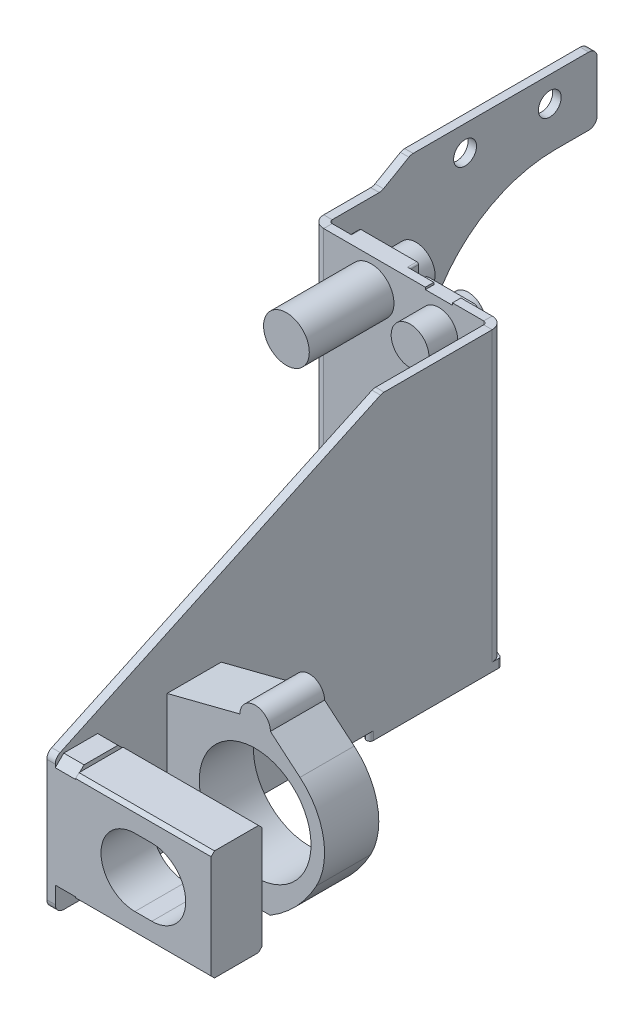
ISO-10303-21;
HEADER;
FILE_DESCRIPTION(('STEP AP214'),'2;1');
FILE_NAME('part.step','',(''),(''),'','','');
FILE_SCHEMA(('AUTOMOTIVE_DESIGN { 1 0 10303 214 1 1 1 1 }'));
ENDSEC;
DATA;
#1=APPLICATION_CONTEXT('core data for automotive mechanical design processes');
#2=APPLICATION_PROTOCOL_DEFINITION('international standard','automotive_design',2000,#1);
#3=PRODUCT_CONTEXT('',#1,'mechanical');
#4=PRODUCT('Part','Part','',(#3));
#5=PRODUCT_RELATED_PRODUCT_CATEGORY('part','',(#4));
#6=PRODUCT_DEFINITION_FORMATION('','',#4);
#7=PRODUCT_DEFINITION_CONTEXT('part definition',#1,'design');
#8=PRODUCT_DEFINITION('design','',#6,#7);
#9=PRODUCT_DEFINITION_SHAPE('','',#8);
#10=(LENGTH_UNIT() NAMED_UNIT(*) SI_UNIT(.MILLI.,.METRE.));
#11=(NAMED_UNIT(*) PLANE_ANGLE_UNIT() SI_UNIT($,.RADIAN.));
#12=(NAMED_UNIT(*) SI_UNIT($,.STERADIAN.) SOLID_ANGLE_UNIT());
#13=UNCERTAINTY_MEASURE_WITH_UNIT(LENGTH_MEASURE(1.E-05),#10,'distance_accuracy_value','');
#14=(GEOMETRIC_REPRESENTATION_CONTEXT(3) GLOBAL_UNCERTAINTY_ASSIGNED_CONTEXT((#13)) GLOBAL_UNIT_ASSIGNED_CONTEXT((#10,
#11,#12)) REPRESENTATION_CONTEXT('',''));
#15=CARTESIAN_POINT('',(0.,0.,0.));
#16=DIRECTION('',(0.,0.,1.));
#17=DIRECTION('',(1.,0.,0.));
#18=AXIS2_PLACEMENT_3D('',#15,#16,#17);
#19=CARTESIAN_POINT('',(5.8121170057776E-13,0.,167.465708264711));
#20=DIRECTION('',(0.,0.,-1.));
#21=DIRECTION('',(-1.,0.,0.));
#22=AXIS2_PLACEMENT_3D('',#19,#20,#21);
#23=PLANE('',#22);
#24=DIRECTION('',(0.,1.,0.));
#25=VECTOR('',#24,1.);
#26=CARTESIAN_POINT('',(54.0000000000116,20.2623956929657,167.465708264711));
#27=LINE('',#26,#25);
#28=CARTESIAN_POINT('',(54.0000000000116,20.2623956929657,167.465708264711));
#29=VERTEX_POINT('',#28);
#30=CARTESIAN_POINT('',(54.0000000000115,38.7376043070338,167.465708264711));
#31=VERTEX_POINT('',#30);
#32=EDGE_CURVE('E842',#29,#31,#27,.T.);
#33=ORIENTED_EDGE('',*,*,#32,.F.);
#34=DIRECTION('',(-0.866025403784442,0.499999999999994,0.));
#35=VECTOR('',#34,1.);
#36=CARTESIAN_POINT('',(70.0000000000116,11.0247913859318,167.465708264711));
#37=LINE('',#36,#35);
#38=CARTESIAN_POINT('',(70.0000000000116,11.0247913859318,167.465708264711));
#39=VERTEX_POINT('',#38);
#40=EDGE_CURVE('E800',#39,#29,#37,.T.);
#41=ORIENTED_EDGE('',*,*,#40,.F.);
#42=DIRECTION('',(-0.866025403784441,-0.5,0.));
#43=VECTOR('',#42,1.);
#44=CARTESIAN_POINT('',(86.0000000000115,20.2623956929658,167.465708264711));
#45=LINE('',#44,#43);
#46=CARTESIAN_POINT('',(86.0000000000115,20.2623956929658,167.465708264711));
#47=VERTEX_POINT('',#46);
#48=EDGE_CURVE('E857',#47,#39,#45,.T.);
#49=ORIENTED_EDGE('',*,*,#48,.F.);
#50=DIRECTION('',(0.,-1.,0.));
#51=VECTOR('',#50,1.);
#52=CARTESIAN_POINT('',(86.0000000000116,38.7376043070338,167.465708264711));
#53=LINE('',#52,#51);
#54=CARTESIAN_POINT('',(86.0000000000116,38.7376043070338,167.465708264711));
#55=VERTEX_POINT('',#54);
#56=EDGE_CURVE('E853',#55,#47,#53,.T.);
#57=ORIENTED_EDGE('',*,*,#56,.F.);
#58=DIRECTION('',(0.866025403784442,-0.499999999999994,0.));
#59=VECTOR('',#58,1.);
#60=CARTESIAN_POINT('',(70.0000000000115,47.9752086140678,167.465708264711));
#61=LINE('',#60,#59);
#62=CARTESIAN_POINT('',(70.0000000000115,47.9752086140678,167.465708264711));
#63=VERTEX_POINT('',#62);
#64=EDGE_CURVE('E849',#63,#55,#61,.T.);
#65=ORIENTED_EDGE('',*,*,#64,.F.);
#66=DIRECTION('',(0.866025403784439,0.5,0.));
#67=VECTOR('',#66,1.);
#68=CARTESIAN_POINT('',(54.0000000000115,38.7376043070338,167.465708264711));
#69=LINE('',#68,#67);
#70=EDGE_CURVE('E846',#31,#63,#69,.T.);
#71=ORIENTED_EDGE('',*,*,#70,.F.);
#72=EDGE_LOOP('',(#33,#41,#49,#57,#65,#71));
#73=FACE_BOUND('',#72,.T.);
#74=CARTESIAN_POINT('',(70.0000000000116,29.5,167.465708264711));
#75=DIRECTION('',(0.,0.,-1.));
#76=DIRECTION('',(-1.,0.,0.));
#77=AXIS2_PLACEMENT_3D('',#74,#75,#76);
#78=CIRCLE('',#77,13.);
#79=CARTESIAN_POINT('',(57.0000000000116,29.5,167.465708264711));
#80=VERTEX_POINT('',#79);
#81=EDGE_CURVE('E11',#80,#80,#78,.F.);
#82=ORIENTED_EDGE('',*,*,#81,.F.);
#83=EDGE_LOOP('',(#82));
#84=FACE_BOUND('',#83,.T.);
#85=ADVANCED_FACE('F16',(#73,#84),#23,.F.);
#86=CARTESIAN_POINT('',(361.465708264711,-85.,163.46570826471));
#87=DIRECTION('',(0.,0.,-1.));
#88=DIRECTION('',(-1.,0.,0.));
#89=AXIS2_PLACEMENT_3D('',#86,#87,#88);
#90=PLANE('',#89);
#91=DIRECTION('',(-0.866025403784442,0.499999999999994,0.));
#92=VECTOR('',#91,1.);
#93=CARTESIAN_POINT('',(330.179235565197,-139.189760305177,163.46570826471));
#94=LINE('',#93,#92);
#95=CARTESIAN_POINT('',(70.0000000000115,11.0247913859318,163.465708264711));
#96=VERTEX_POINT('',#95);
#97=CARTESIAN_POINT('',(54.0000000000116,20.2623956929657,163.465708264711));
#98=VERTEX_POINT('',#97);
#99=EDGE_CURVE('E903',#96,#98,#94,.T.);
#100=ORIENTED_EDGE('',*,*,#99,.T.);
#101=DIRECTION('',(0.,1.,0.));
#102=VECTOR('',#101,1.);
#103=CARTESIAN_POINT('',(54.0000000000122,-85.0000000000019,163.465708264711));
#104=LINE('',#103,#102);
#105=CARTESIAN_POINT('',(54.0000000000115,38.7376043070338,163.465708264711));
#106=VERTEX_POINT('',#105);
#107=EDGE_CURVE('E907',#98,#106,#104,.T.);
#108=ORIENTED_EDGE('',*,*,#107,.T.);
#109=DIRECTION('',(0.866025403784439,0.5,0.));
#110=VECTOR('',#109,1.);
#111=CARTESIAN_POINT('',(231.019326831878,140.939760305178,163.46570826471));
#112=LINE('',#111,#110);
#113=CARTESIAN_POINT('',(70.0000000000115,47.9752086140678,163.465708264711));
#114=VERTEX_POINT('',#113);
#115=EDGE_CURVE('E867',#106,#114,#112,.T.);
#116=ORIENTED_EDGE('',*,*,#115,.T.);
#117=DIRECTION('',(0.866025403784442,-0.499999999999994,0.));
#118=VECTOR('',#117,1.);
#119=CARTESIAN_POINT('',(346.179235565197,-111.476947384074,163.46570826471));
#120=LINE('',#119,#118);
#121=CARTESIAN_POINT('',(86.0000000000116,38.7376043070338,163.465708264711));
#122=VERTEX_POINT('',#121);
#123=EDGE_CURVE('E891',#114,#122,#120,.T.);
#124=ORIENTED_EDGE('',*,*,#123,.T.);
#125=DIRECTION('',(0.,-1.,0.));
#126=VECTOR('',#125,1.);
#127=CARTESIAN_POINT('',(86.0000000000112,-85.,163.465708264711));
#128=LINE('',#127,#126);
#129=CARTESIAN_POINT('',(86.0000000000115,20.2623956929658,163.465708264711));
#130=VERTEX_POINT('',#129);
#131=EDGE_CURVE('E895',#122,#130,#128,.T.);
#132=ORIENTED_EDGE('',*,*,#131,.T.);
#133=DIRECTION('',(-0.866025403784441,-0.5,0.));
#134=VECTOR('',#133,1.);
#135=CARTESIAN_POINT('',(247.019326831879,113.226947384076,163.46570826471));
#136=LINE('',#135,#134);
#137=EDGE_CURVE('E899',#130,#96,#136,.T.);
#138=ORIENTED_EDGE('',*,*,#137,.T.);
#139=EDGE_LOOP('',(#100,#108,#116,#124,#132,#138));
#140=FACE_BOUND('',#139,.T.);
#141=CARTESIAN_POINT('',(30.,67.5,163.465708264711));
#142=DIRECTION('',(0.,0.,-1.));
#143=DIRECTION('',(-1.,0.,0.));
#144=AXIS2_PLACEMENT_3D('',#141,#142,#143);
#145=CIRCLE('',#144,13.5);
#146=CARTESIAN_POINT('',(16.5,67.5,163.465708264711));
#147=VERTEX_POINT('',#146);
#148=EDGE_CURVE('E1801',#147,#147,#145,.F.);
#149=ORIENTED_EDGE('',*,*,#148,.F.);
#150=EDGE_LOOP('',(#149));
#151=FACE_BOUND('',#150,.T.);
#152=DIRECTION('',(1.,0.,0.));
#153=VECTOR('',#152,1.);
#154=CARTESIAN_POINT('',(56.773,83.7624,163.465708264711));
#155=LINE('',#154,#153);
#156=CARTESIAN_POINT('',(62.,83.7624,163.465708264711));
#157=VERTEX_POINT('',#156);
#158=CARTESIAN_POINT('',(78.,83.7624,163.465708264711));
#159=VERTEX_POINT('',#158);
#160=EDGE_CURVE('E955',#157,#159,#155,.T.);
#161=ORIENTED_EDGE('',*,*,#160,.F.);
#162=DIRECTION('',(0.,1.,0.));
#163=VECTOR('',#162,1.);
#164=CARTESIAN_POINT('',(62.,-85.,163.465708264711));
#165=LINE('',#164,#163);
#166=CARTESIAN_POINT('',(62.,85.,163.465708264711));
#167=VERTEX_POINT('',#166);
#168=EDGE_CURVE('E1325',#157,#167,#165,.T.);
#169=ORIENTED_EDGE('',*,*,#168,.T.);
#170=DIRECTION('',(-1.,0.,0.));
#171=VECTOR('',#170,1.);
#172=CARTESIAN_POINT('',(-34.2137836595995,85.,163.465708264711));
#173=LINE('',#172,#171);
#174=CARTESIAN_POINT('',(2.00000000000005,85.,163.465708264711));
#175=VERTEX_POINT('',#174);
#176=EDGE_CURVE('E1539',#167,#175,#173,.T.);
#177=ORIENTED_EDGE('',*,*,#176,.T.);
#178=DIRECTION('',(0.,1.,0.));
#179=VECTOR('',#178,1.);
#180=CARTESIAN_POINT('',(2.00000000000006,-85.,163.465708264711));
#181=LINE('',#180,#179);
#182=CARTESIAN_POINT('',(2.00000000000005,-85.,163.465708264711));
#183=VERTEX_POINT('',#182);
#184=EDGE_CURVE('E1510',#183,#175,#181,.T.);
#185=ORIENTED_EDGE('',*,*,#184,.F.);
#186=DIRECTION('',(-1.,0.,0.));
#187=VECTOR('',#186,1.);
#188=CARTESIAN_POINT('',(361.465708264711,-85.,163.46570826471));
#189=LINE('',#188,#187);
#190=CARTESIAN_POINT('',(96.4657082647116,-85.,163.465708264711));
#191=VERTEX_POINT('',#190);
#192=EDGE_CURVE('E1515',#191,#183,#189,.T.);
#193=ORIENTED_EDGE('',*,*,#192,.F.);
#194=DIRECTION('',(0.,1.,0.));
#195=VECTOR('',#194,1.);
#196=CARTESIAN_POINT('',(96.4657082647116,-85.,163.465708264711));
#197=LINE('',#196,#195);
#198=CARTESIAN_POINT('',(96.4657082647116,85.,163.465708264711));
#199=VERTEX_POINT('',#198);
#200=EDGE_CURVE('E1523',#191,#199,#197,.T.);
#201=ORIENTED_EDGE('',*,*,#200,.T.);
#202=CARTESIAN_POINT('',(78.,85.,163.465708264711));
#203=VERTEX_POINT('',#202);
#204=EDGE_CURVE('E1545',#199,#203,#173,.T.);
#205=ORIENTED_EDGE('',*,*,#204,.T.);
#206=DIRECTION('',(0.,-1.,0.));
#207=VECTOR('',#206,1.);
#208=CARTESIAN_POINT('',(78.,-85.,163.465708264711));
#209=LINE('',#208,#207);
#210=EDGE_CURVE('E1316',#203,#159,#209,.T.);
#211=ORIENTED_EDGE('',*,*,#210,.T.);
#212=EDGE_LOOP('',(#161,#169,#177,#185,#193,#201,#205,#211));
#213=FACE_BOUND('',#212,.T.);
#214=CARTESIAN_POINT('',(69.9937,67.4937,163.465708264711));
#215=DIRECTION('',(0.,0.,-1.));
#216=DIRECTION('',(-1.,0.,0.));
#217=AXIS2_PLACEMENT_3D('',#214,#215,#216);
#218=CIRCLE('',#217,11.1633);
#219=CARTESIAN_POINT('',(58.8304,67.4937,163.465708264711));
#220=VERTEX_POINT('',#219);
#221=EDGE_CURVE('E1830',#220,#220,#218,.F.);
#222=ORIENTED_EDGE('',*,*,#221,.F.);
#223=EDGE_LOOP('',(#222));
#224=FACE_BOUND('',#223,.T.);
#225=ADVANCED_FACE('F1866',(#140,#151,#213,#224),#90,.F.);
#226=CARTESIAN_POINT('',(56.773,54.273,156.165708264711));
#227=DIRECTION('',(0.,0.,-1.));
#228=DIRECTION('',(-1.,0.,0.));
#229=AXIS2_PLACEMENT_3D('',#226,#227,#228);
#230=PLANE('',#229);
#231=CARTESIAN_POINT('',(56.773,54.273,156.165708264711));
#232=DIRECTION('',(0.,0.,-1.));
#233=DIRECTION('',(-1.,0.,0.));
#234=AXIS2_PLACEMENT_3D('',#231,#232,#233);
#235=CIRCLE('',#234,3.048);
#236=CARTESIAN_POINT('',(56.773,51.225,156.165708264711));
#237=VERTEX_POINT('',#236);
#238=CARTESIAN_POINT('',(53.725,54.273,156.165708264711));
#239=VERTEX_POINT('',#238);
#240=EDGE_CURVE('E920',#237,#239,#235,.T.);
#241=ORIENTED_EDGE('',*,*,#240,.T.);
#242=DIRECTION('',(0.,1.,0.));
#243=VECTOR('',#242,1.);
#244=CARTESIAN_POINT('',(53.725,54.273,156.165708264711));
#245=LINE('',#244,#243);
#246=CARTESIAN_POINT('',(53.725,80.7144,156.165708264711));
#247=VERTEX_POINT('',#246);
#248=EDGE_CURVE('E927',#239,#247,#245,.T.);
#249=ORIENTED_EDGE('',*,*,#248,.T.);
#250=CARTESIAN_POINT('',(56.773,80.7144,156.165708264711));
#251=DIRECTION('',(0.,0.,-1.));
#252=DIRECTION('',(-1.,0.,0.));
#253=AXIS2_PLACEMENT_3D('',#250,#251,#252);
#254=CIRCLE('',#253,3.048);
#255=CARTESIAN_POINT('',(56.773,83.7624,156.165708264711));
#256=VERTEX_POINT('',#255);
#257=EDGE_CURVE('E931',#247,#256,#254,.T.);
#258=ORIENTED_EDGE('',*,*,#257,.T.);
#259=DIRECTION('',(1.,0.,0.));
#260=VECTOR('',#259,1.);
#261=CARTESIAN_POINT('',(56.773,83.7624,156.165708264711));
#262=LINE('',#261,#260);
#263=CARTESIAN_POINT('',(83.2144,83.7624,156.165708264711));
#264=VERTEX_POINT('',#263);
#265=EDGE_CURVE('E935',#256,#264,#262,.T.);
#266=ORIENTED_EDGE('',*,*,#265,.T.);
#267=CARTESIAN_POINT('',(83.2144,80.7144,156.165708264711));
#268=DIRECTION('',(0.,0.,-1.));
#269=DIRECTION('',(-1.,0.,0.));
#270=AXIS2_PLACEMENT_3D('',#267,#268,#269);
#271=CIRCLE('',#270,3.048);
#272=CARTESIAN_POINT('',(86.2624,80.7144,156.165708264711));
#273=VERTEX_POINT('',#272);
#274=EDGE_CURVE('E939',#264,#273,#271,.T.);
#275=ORIENTED_EDGE('',*,*,#274,.T.);
#276=DIRECTION('',(0.,-1.,0.));
#277=VECTOR('',#276,1.);
#278=CARTESIAN_POINT('',(86.2624,80.7144,156.165708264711));
#279=LINE('',#278,#277);
#280=CARTESIAN_POINT('',(86.2624,54.273,156.165708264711));
#281=VERTEX_POINT('',#280);
#282=EDGE_CURVE('E943',#273,#281,#279,.T.);
#283=ORIENTED_EDGE('',*,*,#282,.T.);
#284=CARTESIAN_POINT('',(83.2144,54.273,156.165708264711));
#285=DIRECTION('',(0.,0.,-1.));
#286=DIRECTION('',(-1.,0.,0.));
#287=AXIS2_PLACEMENT_3D('',#284,#285,#286);
#288=CIRCLE('',#287,3.048);
#289=CARTESIAN_POINT('',(83.2144,51.225,156.165708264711));
#290=VERTEX_POINT('',#289);
#291=EDGE_CURVE('E947',#281,#290,#288,.T.);
#292=ORIENTED_EDGE('',*,*,#291,.T.);
#293=DIRECTION('',(-1.,0.,0.));
#294=VECTOR('',#293,1.);
#295=CARTESIAN_POINT('',(83.2144,51.225,156.165708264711));
#296=LINE('',#295,#294);
#297=EDGE_CURVE('E951',#290,#237,#296,.T.);
#298=ORIENTED_EDGE('',*,*,#297,.T.);
#299=EDGE_LOOP('',(#241,#249,#258,#266,#275,#283,#292,#298));
#300=FACE_BOUND('',#299,.T.);
#301=CARTESIAN_POINT('',(69.9937,67.4937,156.165708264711));
#302=DIRECTION('',(0.,0.,-1.));
#303=DIRECTION('',(-1.,0.,0.));
#304=AXIS2_PLACEMENT_3D('',#301,#302,#303);
#305=CIRCLE('',#304,10.3124);
#306=CARTESIAN_POINT('',(59.6813,67.4937,156.165708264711));
#307=VERTEX_POINT('',#306);
#308=EDGE_CURVE('E915',#307,#307,#305,.T.);
#309=ORIENTED_EDGE('',*,*,#308,.F.);
#310=EDGE_LOOP('',(#309));
#311=FACE_BOUND('',#310,.T.);
#312=ADVANCED_FACE('F1980',(#300,#311),#230,.T.);
#313=CARTESIAN_POINT('',(13.5,51.,152.965708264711));
#314=DIRECTION('',(0.,0.,-1.));
#315=DIRECTION('',(-1.,0.,0.));
#316=AXIS2_PLACEMENT_3D('',#313,#314,#315);
#317=PLANE('',#316);
#318=CARTESIAN_POINT('',(13.5,51.,152.965708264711));
#319=DIRECTION('',(0.,0.,-1.));
#320=DIRECTION('',(-1.,0.,0.));
#321=AXIS2_PLACEMENT_3D('',#318,#319,#320);
#322=CIRCLE('',#321,1.);
#323=CARTESIAN_POINT('',(13.5,50.,152.965708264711));
#324=VERTEX_POINT('',#323);
#325=CARTESIAN_POINT('',(12.5,51.,152.965708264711));
#326=VERTEX_POINT('',#325);
#327=EDGE_CURVE('E999',#324,#326,#322,.T.);
#328=ORIENTED_EDGE('',*,*,#327,.T.);
#329=DIRECTION('',(0.,1.,0.));
#330=VECTOR('',#329,1.);
#331=CARTESIAN_POINT('',(12.5,51.,152.965708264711));
#332=LINE('',#331,#330);
#333=CARTESIAN_POINT('',(12.5,84.,152.965708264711));
#334=VERTEX_POINT('',#333);
#335=EDGE_CURVE('E1006',#326,#334,#332,.T.);
#336=ORIENTED_EDGE('',*,*,#335,.T.);
#337=CARTESIAN_POINT('',(13.5,84.,152.965708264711));
#338=DIRECTION('',(0.,0.,-1.));
#339=DIRECTION('',(-1.,0.,0.));
#340=AXIS2_PLACEMENT_3D('',#337,#338,#339);
#341=CIRCLE('',#340,1.);
#342=CARTESIAN_POINT('',(13.5,85.,152.965708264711));
#343=VERTEX_POINT('',#342);
#344=EDGE_CURVE('E1010',#334,#343,#341,.T.);
#345=ORIENTED_EDGE('',*,*,#344,.T.);
#346=DIRECTION('',(1.,0.,0.));
#347=VECTOR('',#346,1.);
#348=CARTESIAN_POINT('',(13.5,85.,152.965708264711));
#349=LINE('',#348,#347);
#350=CARTESIAN_POINT('',(46.5,85.,152.965708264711));
#351=VERTEX_POINT('',#350);
#352=EDGE_CURVE('E1014',#343,#351,#349,.T.);
#353=ORIENTED_EDGE('',*,*,#352,.T.);
#354=CARTESIAN_POINT('',(46.5,84.,152.965708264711));
#355=DIRECTION('',(0.,0.,-1.));
#356=DIRECTION('',(-1.,0.,0.));
#357=AXIS2_PLACEMENT_3D('',#354,#355,#356);
#358=CIRCLE('',#357,1.);
#359=CARTESIAN_POINT('',(47.5,84.,152.965708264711));
#360=VERTEX_POINT('',#359);
#361=EDGE_CURVE('E1018',#351,#360,#358,.T.);
#362=ORIENTED_EDGE('',*,*,#361,.T.);
#363=DIRECTION('',(0.,-1.,0.));
#364=VECTOR('',#363,1.);
#365=CARTESIAN_POINT('',(47.5,84.,152.965708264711));
#366=LINE('',#365,#364);
#367=CARTESIAN_POINT('',(47.5,51.,152.965708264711));
#368=VERTEX_POINT('',#367);
#369=EDGE_CURVE('E1022',#360,#368,#366,.T.);
#370=ORIENTED_EDGE('',*,*,#369,.T.);
#371=CARTESIAN_POINT('',(46.5,51.,152.965708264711));
#372=DIRECTION('',(0.,0.,-1.));
#373=DIRECTION('',(-1.,0.,0.));
#374=AXIS2_PLACEMENT_3D('',#371,#372,#373);
#375=CIRCLE('',#374,1.);
#376=CARTESIAN_POINT('',(46.5,50.,152.965708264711));
#377=VERTEX_POINT('',#376);
#378=EDGE_CURVE('E1026',#368,#377,#375,.T.);
#379=ORIENTED_EDGE('',*,*,#378,.T.);
#380=DIRECTION('',(-1.,0.,0.));
#381=VECTOR('',#380,1.);
#382=CARTESIAN_POINT('',(46.5,50.,152.965708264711));
#383=LINE('',#382,#381);
#384=EDGE_CURVE('E1030',#377,#324,#383,.T.);
#385=ORIENTED_EDGE('',*,*,#384,.T.);
#386=EDGE_LOOP('',(#328,#336,#345,#353,#362,#370,#379,#385));
#387=FACE_BOUND('',#386,.T.);
#388=CARTESIAN_POINT('',(30.,67.5,152.965708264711));
#389=DIRECTION('',(0.,0.,-1.));
#390=DIRECTION('',(-1.,0.,0.));
#391=AXIS2_PLACEMENT_3D('',#388,#389,#390);
#392=CIRCLE('',#391,11.25);
#393=CARTESIAN_POINT('',(18.75,67.5,152.965708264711));
#394=VERTEX_POINT('',#393);
#395=EDGE_CURVE('E994',#394,#394,#392,.T.);
#396=ORIENTED_EDGE('',*,*,#395,.F.);
#397=EDGE_LOOP('',(#396));
#398=FACE_BOUND('',#397,.T.);
#399=ADVANCED_FACE('F2018',(#387,#398),#317,.T.);
#400=CARTESIAN_POINT('',(115.465708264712,0.,0.));
#401=DIRECTION('',(-1.,0.,0.));
#402=DIRECTION('',(0.,0.,1.));
#403=AXIS2_PLACEMENT_3D('',#400,#401,#402);
#404=PLANE('',#403);
#405=DIRECTION('',(0.,0.,-1.));
#406=VECTOR('',#405,1.);
#407=CARTESIAN_POINT('',(115.465708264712,-72.5,421.397124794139));
#408=LINE('',#407,#406);
#409=CARTESIAN_POINT('',(115.465708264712,-72.5,420.897124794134));
#410=VERTEX_POINT('',#409);
#411=CARTESIAN_POINT('',(115.465708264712,-72.5,395.897124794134));
#412=VERTEX_POINT('',#411);
#413=EDGE_CURVE('E1236',#410,#412,#408,.T.);
#414=ORIENTED_EDGE('',*,*,#413,.F.);
#415=DIRECTION('',(0.,0.707106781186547,0.707106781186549));
#416=VECTOR('',#415,1.);
#417=CARTESIAN_POINT('',(115.465708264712,-75.,418.397124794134));
#418=LINE('',#417,#416);
#419=CARTESIAN_POINT('',(115.465708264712,-75.,418.397124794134));
#420=VERTEX_POINT('',#419);
#421=EDGE_CURVE('E1277',#420,#410,#418,.T.);
#422=ORIENTED_EDGE('',*,*,#421,.F.);
#423=DIRECTION('',(0.,0.,1.));
#424=VECTOR('',#423,1.);
#425=CARTESIAN_POINT('',(115.465708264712,-75.,398.397124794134));
#426=LINE('',#425,#424);
#427=CARTESIAN_POINT('',(115.465708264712,-75.,398.397124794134));
#428=VERTEX_POINT('',#427);
#429=EDGE_CURVE('E1272',#428,#420,#426,.T.);
#430=ORIENTED_EDGE('',*,*,#429,.F.);
#431=DIRECTION('',(0.,-0.707106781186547,0.707106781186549));
#432=VECTOR('',#431,1.);
#433=CARTESIAN_POINT('',(115.465708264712,-70.,393.397124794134));
#434=LINE('',#433,#432);
#435=EDGE_CURVE('E1268',#412,#428,#434,.T.);
#436=ORIENTED_EDGE('',*,*,#435,.F.);
#437=EDGE_LOOP('',(#414,#422,#430,#436));
#438=FACE_BOUND('',#437,.T.);
#439=ADVANCED_FACE('F2200',(#438),#404,.F.);
#440=DIRECTION('',(0.,0.,1.));
#441=VECTOR('',#440,1.);
#442=CARTESIAN_POINT('',(115.465708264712,-7.5,395.397124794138));
#443=LINE('',#442,#441);
#444=CARTESIAN_POINT('',(115.465708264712,-7.5,395.897124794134));
#445=VERTEX_POINT('',#444);
#446=CARTESIAN_POINT('',(115.465708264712,-7.5,420.897124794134));
#447=VERTEX_POINT('',#446);
#448=EDGE_CURVE('E1221',#445,#447,#443,.T.);
#449=ORIENTED_EDGE('',*,*,#448,.F.);
#450=DIRECTION('',(0.,-0.707106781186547,-0.707106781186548));
#451=VECTOR('',#450,1.);
#452=CARTESIAN_POINT('',(115.465708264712,-5.,398.397124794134));
#453=LINE('',#452,#451);
#454=CARTESIAN_POINT('',(115.465708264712,-5.,398.397124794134));
#455=VERTEX_POINT('',#454);
#456=EDGE_CURVE('E1290',#455,#445,#453,.T.);
#457=ORIENTED_EDGE('',*,*,#456,.F.);
#458=DIRECTION('',(0.,0.,-1.));
#459=VECTOR('',#458,1.);
#460=CARTESIAN_POINT('',(115.465708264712,-5.,418.397124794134));
#461=LINE('',#460,#459);
#462=CARTESIAN_POINT('',(115.465708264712,-5.,418.397124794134));
#463=VERTEX_POINT('',#462);
#464=EDGE_CURVE('E1285',#463,#455,#461,.T.);
#465=ORIENTED_EDGE('',*,*,#464,.F.);
#466=DIRECTION('',(0.,0.707106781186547,-0.707106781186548));
#467=VECTOR('',#466,1.);
#468=CARTESIAN_POINT('',(115.465708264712,-10.,423.397124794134));
#469=LINE('',#468,#467);
#470=EDGE_CURVE('E1281',#447,#463,#469,.T.);
#471=ORIENTED_EDGE('',*,*,#470,.F.);
#472=EDGE_LOOP('',(#449,#457,#465,#471));
#473=FACE_BOUND('',#472,.T.);
#474=ADVANCED_FACE('F2307',(#473),#404,.F.);
#475=CARTESIAN_POINT('',(103.465708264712,-85.,160.322990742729));
#476=DIRECTION('',(0.,-1.,0.));
#477=DIRECTION('',(0.,0.,-1.));
#478=AXIS2_PLACEMENT_3D('',#475,#476,#477);
#479=PLANE('',#478);
#480=DIRECTION('',(0.927183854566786,0.,0.374606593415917));
#481=VECTOR('',#480,1.);
#482=CARTESIAN_POINT('',(-5.,-85.,116.5));
#483=LINE('',#482,#481);
#484=CARTESIAN_POINT('',(0.,-85.,118.520131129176));
#485=VERTEX_POINT('',#484);
#486=CARTESIAN_POINT('',(102.214921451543,-85.,159.817640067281));
#487=VERTEX_POINT('',#486);
#488=EDGE_CURVE('E1704',#485,#487,#483,.T.);
#489=ORIENTED_EDGE('',*,*,#488,.F.);
#490=DIRECTION('',(0.,0.,-1.));
#491=VECTOR('',#490,1.);
#492=CARTESIAN_POINT('',(0.,-85.,523.));
#493=LINE('',#492,#491);
#494=CARTESIAN_POINT('',(0.,-85.,156.465708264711));
#495=VERTEX_POINT('',#494);
#496=EDGE_CURVE('E1442',#495,#485,#493,.T.);
#497=ORIENTED_EDGE('',*,*,#496,.F.);
#498=CARTESIAN_POINT('',(2.,-85.,156.465708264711));
#499=DIRECTION('',(0.,1.,0.));
#500=DIRECTION('',(0.,0.,1.));
#501=AXIS2_PLACEMENT_3D('',#498,#499,#500);
#502=CIRCLE('',#501,2.);
#503=CARTESIAN_POINT('',(2.,-85.,158.465708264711));
#504=VERTEX_POINT('',#503);
#505=EDGE_CURVE('E1408',#495,#504,#502,.T.);
#506=ORIENTED_EDGE('',*,*,#505,.T.);
#507=DIRECTION('',(-1.,0.,0.));
#508=VECTOR('',#507,1.);
#509=CARTESIAN_POINT('',(361.465708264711,-85.,158.46570826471));
#510=LINE('',#509,#508);
#511=CARTESIAN_POINT('',(96.4657082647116,-85.,158.465708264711));
#512=VERTEX_POINT('',#511);
#513=EDGE_CURVE('E1541',#512,#504,#510,.T.);
#514=ORIENTED_EDGE('',*,*,#513,.F.);
#515=CARTESIAN_POINT('',(96.4657082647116,-85.,165.465708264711));
#516=DIRECTION('',(0.,1.,0.));
#517=DIRECTION('',(0.,0.,1.));
#518=AXIS2_PLACEMENT_3D('',#515,#516,#517);
#519=CIRCLE('',#518,7.);
#520=CARTESIAN_POINT('',(103.465708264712,-85.,165.465708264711));
#521=VERTEX_POINT('',#520);
#522=EDGE_CURVE('E1360',#512,#521,#519,.F.);
#523=ORIENTED_EDGE('',*,*,#522,.T.);
#524=DIRECTION('',(0.,0.,1.));
#525=VECTOR('',#524,1.);
#526=CARTESIAN_POINT('',(103.465708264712,-85.,239.414214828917));
#527=LINE('',#526,#525);
#528=CARTESIAN_POINT('',(103.465708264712,-85.,161.672007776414));
#529=VERTEX_POINT('',#528);
#530=EDGE_CURVE('E1674',#529,#521,#527,.T.);
#531=ORIENTED_EDGE('',*,*,#530,.F.);
#532=CARTESIAN_POINT('',(101.465708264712,-85.,161.672007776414));
#533=DIRECTION('',(0.,-1.,0.));
#534=DIRECTION('',(0.,0.,-1.));
#535=AXIS2_PLACEMENT_3D('',#532,#533,#534);
#536=CIRCLE('',#535,2.);
#537=EDGE_CURVE('E1721',#529,#487,#536,.F.);
#538=ORIENTED_EDGE('',*,*,#537,.T.);
#539=EDGE_LOOP('',(#489,#497,#506,#514,#523,#531,#538));
#540=FACE_BOUND('',#539,.T.);
#541=ADVANCED_FACE('F2057',(#540),#479,.F.);
#542=CARTESIAN_POINT('',(103.465708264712,-90.,239.414214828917));
#543=DIRECTION('',(-1.,0.,0.));
#544=DIRECTION('',(0.,-1.,0.));
#545=AXIS2_PLACEMENT_3D('',#542,#543,#544);
#546=PLANE('',#545);
#547=DIRECTION('',(0.,0.,-1.));
#548=VECTOR('',#547,1.);
#549=CARTESIAN_POINT('',(103.465708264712,-74.9999999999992,239.414214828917));
#550=LINE('',#549,#548);
#551=CARTESIAN_POINT('',(103.465708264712,-74.9999999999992,357.397124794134));
#552=VERTEX_POINT('',#551);
#553=CARTESIAN_POINT('',(103.465708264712,-74.9999999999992,325.397124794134));
#554=VERTEX_POINT('',#553);
#555=EDGE_CURVE('E1140',#552,#554,#550,.T.);
#556=ORIENTED_EDGE('',*,*,#555,.F.);
#557=DIRECTION('',(0.,1.,0.));
#558=VECTOR('',#557,1.);
#559=CARTESIAN_POINT('',(103.465708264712,-90.,357.397124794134));
#560=LINE('',#559,#558);
#561=CARTESIAN_POINT('',(103.465708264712,-5.,357.397124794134));
#562=VERTEX_POINT('',#561);
#563=EDGE_CURVE('E1137',#552,#562,#560,.T.);
#564=ORIENTED_EDGE('',*,*,#563,.T.);
#565=DIRECTION('',(0.,0.,1.));
#566=VECTOR('',#565,1.);
#567=CARTESIAN_POINT('',(103.465708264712,-5.,239.414214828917));
#568=LINE('',#567,#566);
#569=CARTESIAN_POINT('',(103.465708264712,-5.,325.397124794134));
#570=VERTEX_POINT('',#569);
#571=EDGE_CURVE('E1144',#570,#562,#568,.T.);
#572=ORIENTED_EDGE('',*,*,#571,.F.);
#573=DIRECTION('',(0.,1.,0.));
#574=VECTOR('',#573,1.);
#575=CARTESIAN_POINT('',(103.465708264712,-90.,325.397124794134));
#576=LINE('',#575,#574);
#577=EDGE_CURVE('E1133',#554,#570,#576,.T.);
#578=ORIENTED_EDGE('',*,*,#577,.F.);
#579=EDGE_LOOP('',(#556,#564,#572,#578));
#580=FACE_BOUND('',#579,.T.);
#581=ORIENTED_EDGE('',*,*,#530,.T.);
#582=DIRECTION('',(0.,1.,0.));
#583=VECTOR('',#582,1.);
#584=CARTESIAN_POINT('',(103.465708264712,-85.,165.465708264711));
#585=LINE('',#584,#583);
#586=CARTESIAN_POINT('',(103.465708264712,85.,165.465708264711));
#587=VERTEX_POINT('',#586);
#588=EDGE_CURVE('E1365',#521,#587,#585,.T.);
#589=ORIENTED_EDGE('',*,*,#588,.T.);
#590=DIRECTION('',(0.,0.,-1.));
#591=VECTOR('',#590,1.);
#592=CARTESIAN_POINT('',(103.465708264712,85.,27.7176328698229));
#593=LINE('',#592,#591);
#594=CARTESIAN_POINT('',(103.465708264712,85.,229.283028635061));
#595=VERTEX_POINT('',#594);
#596=EDGE_CURVE('E1357',#595,#587,#593,.T.);
#597=ORIENTED_EDGE('',*,*,#596,.F.);
#598=CARTESIAN_POINT('',(103.465708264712,80.,229.283028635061));
#599=DIRECTION('',(1.,0.,0.));
#600=DIRECTION('',(0.,1.,0.));
#601=AXIS2_PLACEMENT_3D('',#598,#599,#600);
#602=CIRCLE('',#601,5.);
#603=CARTESIAN_POINT('',(103.465708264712,84.5315389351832,231.396119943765));
#604=VERTEX_POINT('',#603);
#605=EDGE_CURVE('E1560',#595,#604,#602,.T.);
#606=ORIENTED_EDGE('',*,*,#605,.T.);
#607=DIRECTION('',(0.,0.422618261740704,-0.906307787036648));
#608=VECTOR('',#607,1.);
#609=CARTESIAN_POINT('',(103.465708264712,85.,230.391501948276));
#610=LINE('',#609,#608);
#611=CARTESIAN_POINT('',(103.465708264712,-3.65381236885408,420.510216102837));
#612=VERTEX_POINT('',#611);
#613=EDGE_CURVE('E1388',#612,#604,#610,.T.);
#614=ORIENTED_EDGE('',*,*,#613,.F.);
#615=CARTESIAN_POINT('',(103.465708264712,-8.1853513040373,418.397124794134));
#616=DIRECTION('',(1.,0.,0.));
#617=DIRECTION('',(0.,1.,0.));
#618=AXIS2_PLACEMENT_3D('',#615,#616,#617);
#619=CIRCLE('',#618,5.);
#620=CARTESIAN_POINT('',(103.465708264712,-8.18535130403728,423.397124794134));
#621=VERTEX_POINT('',#620);
#622=EDGE_CURVE('E1557',#612,#621,#619,.T.);
#623=ORIENTED_EDGE('',*,*,#622,.T.);
#624=DIRECTION('',(0.,-1.,0.));
#625=VECTOR('',#624,1.);
#626=CARTESIAN_POINT('',(103.465708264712,95.,423.397124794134));
#627=LINE('',#626,#625);
#628=CARTESIAN_POINT('',(103.465708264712,-10.,423.397124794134));
#629=VERTEX_POINT('',#628);
#630=EDGE_CURVE('E1361',#621,#629,#627,.T.);
#631=ORIENTED_EDGE('',*,*,#630,.T.);
#632=DIRECTION('',(0.,-0.707106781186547,0.707106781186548));
#633=VECTOR('',#632,1.);
#634=CARTESIAN_POINT('',(103.465708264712,-47.5,460.897124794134));
#635=LINE('',#634,#633);
#636=CARTESIAN_POINT('',(103.465708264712,-5.,418.397124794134));
#637=VERTEX_POINT('',#636);
#638=EDGE_CURVE('E1670',#637,#629,#635,.T.);
#639=ORIENTED_EDGE('',*,*,#638,.F.);
#640=DIRECTION('',(0.,0.,1.));
#641=VECTOR('',#640,1.);
#642=CARTESIAN_POINT('',(103.465708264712,-5.,423.397124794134));
#643=LINE('',#642,#641);
#644=CARTESIAN_POINT('',(103.465708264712,-5.,398.397124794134));
#645=VERTEX_POINT('',#644);
#646=EDGE_CURVE('E1666',#645,#637,#643,.T.);
#647=ORIENTED_EDGE('',*,*,#646,.F.);
#648=DIRECTION('',(0.,0.707106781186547,0.707106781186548));
#649=VECTOR('',#648,1.);
#650=CARTESIAN_POINT('',(103.465708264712,-32.5,370.897124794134));
#651=LINE('',#650,#649);
#652=CARTESIAN_POINT('',(103.465708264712,-10.,393.397124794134));
#653=VERTEX_POINT('',#652);
#654=EDGE_CURVE('E1662',#653,#645,#651,.T.);
#655=ORIENTED_EDGE('',*,*,#654,.F.);
#656=DIRECTION('',(0.,1.,0.));
#657=VECTOR('',#656,1.);
#658=CARTESIAN_POINT('',(103.465708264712,-85.,393.397124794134));
#659=LINE('',#658,#657);
#660=CARTESIAN_POINT('',(103.465708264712,-70.,393.397124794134));
#661=VERTEX_POINT('',#660);
#662=EDGE_CURVE('E1658',#661,#653,#659,.T.);
#663=ORIENTED_EDGE('',*,*,#662,.F.);
#664=DIRECTION('',(0.,0.707106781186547,-0.707106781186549));
#665=VECTOR('',#664,1.);
#666=CARTESIAN_POINT('',(103.465708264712,-92.5,415.897124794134));
#667=LINE('',#666,#665);
#668=CARTESIAN_POINT('',(103.465708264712,-75.,398.397124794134));
#669=VERTEX_POINT('',#668);
#670=EDGE_CURVE('E1654',#669,#661,#667,.T.);
#671=ORIENTED_EDGE('',*,*,#670,.F.);
#672=DIRECTION('',(0.,0.,-1.));
#673=VECTOR('',#672,1.);
#674=CARTESIAN_POINT('',(103.465708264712,-75.,423.397124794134));
#675=LINE('',#674,#673);
#676=CARTESIAN_POINT('',(103.465708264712,-75.,418.397124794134));
#677=VERTEX_POINT('',#676);
#678=EDGE_CURVE('E1646',#677,#669,#675,.T.);
#679=ORIENTED_EDGE('',*,*,#678,.F.);
#680=DIRECTION('',(0.,-0.707106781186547,-0.707106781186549));
#681=VECTOR('',#680,1.);
#682=CARTESIAN_POINT('',(103.465708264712,-77.5,415.897124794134));
#683=LINE('',#682,#681);
#684=CARTESIAN_POINT('',(103.465708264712,-70.,423.397124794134));
#685=VERTEX_POINT('',#684);
#686=EDGE_CURVE('E1650',#685,#677,#683,.T.);
#687=ORIENTED_EDGE('',*,*,#686,.F.);
#688=CARTESIAN_POINT('',(103.465708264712,-80.,423.397124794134));
#689=VERTEX_POINT('',#688);
#690=EDGE_CURVE('E1364',#685,#689,#627,.T.);
#691=ORIENTED_EDGE('',*,*,#690,.T.);
#692=CARTESIAN_POINT('',(103.465708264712,-80.,418.397124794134));
#693=DIRECTION('',(1.,0.,0.));
#694=DIRECTION('',(0.,1.,0.));
#695=AXIS2_PLACEMENT_3D('',#692,#693,#694);
#696=CIRCLE('',#695,5.);
#697=CARTESIAN_POINT('',(103.465708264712,-85.,418.397124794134));
#698=VERTEX_POINT('',#697);
#699=EDGE_CURVE('E1563',#689,#698,#696,.T.);
#700=ORIENTED_EDGE('',*,*,#699,.T.);
#701=DIRECTION('',(0.,0.,-1.));
#702=VECTOR('',#701,1.);
#703=CARTESIAN_POINT('',(103.465708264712,-85.,423.397124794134));
#704=LINE('',#703,#702);
#705=CARTESIAN_POINT('',(103.465708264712,-85.,235.572250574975));
#706=VERTEX_POINT('',#705);
#707=EDGE_CURVE('E1369',#698,#706,#704,.T.);
#708=ORIENTED_EDGE('',*,*,#707,.T.);
#709=DIRECTION('',(0.,1.,0.));
#710=VECTOR('',#709,1.);
#711=CARTESIAN_POINT('',(103.465708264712,-90.,235.572250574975));
#712=LINE('',#711,#710);
#713=CARTESIAN_POINT('',(103.465708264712,-90.,235.572250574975));
#714=VERTEX_POINT('',#713);
#715=EDGE_CURVE('E1733',#706,#714,#712,.F.);
#716=ORIENTED_EDGE('',*,*,#715,.T.);
#717=DIRECTION('',(0.,0.,1.));
#718=VECTOR('',#717,1.);
#719=CARTESIAN_POINT('',(103.465708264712,-90.,239.414214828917));
#720=LINE('',#719,#718);
#721=CARTESIAN_POINT('',(103.465708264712,-90.,161.672007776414));
#722=VERTEX_POINT('',#721);
#723=EDGE_CURVE('E1675',#722,#714,#720,.T.);
#724=ORIENTED_EDGE('',*,*,#723,.F.);
#725=DIRECTION('',(0.,1.,0.));
#726=VECTOR('',#725,1.);
#727=CARTESIAN_POINT('',(103.465708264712,-90.,161.672007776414));
#728=LINE('',#727,#726);
#729=EDGE_CURVE('E1729',#722,#529,#728,.T.);
#730=ORIENTED_EDGE('',*,*,#729,.T.);
#731=EDGE_LOOP('',(#581,#589,#597,#606,#614,#623,#631,#639,#647,#655,#663,#671,#679,#687,#691,
#700,#708,#716,#724,#730));
#732=FACE_BOUND('',#731,.T.);
#733=ADVANCED_FACE('F2446',(#580,#732),#546,.F.);
#734=CARTESIAN_POINT('',(103.465708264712,-90.,239.414214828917));
#735=DIRECTION('',(0.573576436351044,0.,-0.819152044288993));
#736=DIRECTION('',(-0.819152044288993,0.,-0.573576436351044));
#737=AXIS2_PLACEMENT_3D('',#734,#735,#736);
#738=PLANE('',#737);
#739=DIRECTION('',(-0.819152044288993,0.,-0.573576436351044));
#740=VECTOR('',#739,1.);
#741=CARTESIAN_POINT('',(103.465708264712,-90.,239.414214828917));
#742=LINE('',#741,#740);
#743=CARTESIAN_POINT('',(100.318555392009,-90.,237.210554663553));
#744=VERTEX_POINT('',#743);
#745=CARTESIAN_POINT('',(-4.14715287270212,-90.,164.062878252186));
#746=VERTEX_POINT('',#745);
#747=EDGE_CURVE('E1679',#744,#746,#742,.T.);
#748=ORIENTED_EDGE('',*,*,#747,.F.);
#749=DIRECTION('',(0.,1.,0.));
#750=VECTOR('',#749,1.);
#751=CARTESIAN_POINT('',(100.318555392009,-90.,237.210554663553));
#752=LINE('',#751,#750);
#753=CARTESIAN_POINT('',(100.318555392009,-85.,237.210554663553));
#754=VERTEX_POINT('',#753);
#755=EDGE_CURVE('E1713',#744,#754,#752,.T.);
#756=ORIENTED_EDGE('',*,*,#755,.T.);
#757=DIRECTION('',(-0.819152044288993,0.,-0.573576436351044));
#758=VECTOR('',#757,1.);
#759=CARTESIAN_POINT('',(103.465708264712,-85.,239.414214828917));
#760=LINE('',#759,#758);
#761=CARTESIAN_POINT('',(98.4657082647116,-85.,235.913177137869));
#762=VERTEX_POINT('',#761);
#763=EDGE_CURVE('E1696',#754,#762,#760,.T.);
#764=ORIENTED_EDGE('',*,*,#763,.T.);
#765=CARTESIAN_POINT('',(-4.14715287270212,-85.,164.062878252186));
#766=VERTEX_POINT('',#765);
#767=EDGE_CURVE('E1695',#762,#766,#760,.T.);
#768=ORIENTED_EDGE('',*,*,#767,.T.);
#769=DIRECTION('',(0.,1.,0.));
#770=VECTOR('',#769,1.);
#771=CARTESIAN_POINT('',(-4.14715287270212,-90.,164.062878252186));
#772=LINE('',#771,#770);
#773=EDGE_CURVE('E1710',#766,#746,#772,.F.);
#774=ORIENTED_EDGE('',*,*,#773,.T.);
#775=EDGE_LOOP('',(#748,#756,#764,#768,#774));
#776=FACE_BOUND('',#775,.T.);
#777=ADVANCED_FACE('F2443',(#776),#738,.F.);
#778=CARTESIAN_POINT('',(-5.,-90.,163.465708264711));
#779=DIRECTION('',(1.,0.,0.));
#780=DIRECTION('',(0.,0.,-1.));
#781=AXIS2_PLACEMENT_3D('',#778,#779,#780);
#782=PLANE('',#781);
#783=DIRECTION('',(0.,0.,-1.));
#784=VECTOR('',#783,1.);
#785=CARTESIAN_POINT('',(-5.,-90.,163.465708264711));
#786=LINE('',#785,#784);
#787=CARTESIAN_POINT('',(-5.,-90.,162.424574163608));
#788=VERTEX_POINT('',#787);
#789=CARTESIAN_POINT('',(-5.,-90.,116.5));
#790=VERTEX_POINT('',#789);
#791=EDGE_CURVE('E1684',#788,#790,#786,.T.);
#792=ORIENTED_EDGE('',*,*,#791,.F.);
#793=DIRECTION('',(0.,1.,0.));
#794=VECTOR('',#793,1.);
#795=CARTESIAN_POINT('',(-5.,-90.,162.424574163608));
#796=LINE('',#795,#794);
#797=CARTESIAN_POINT('',(-5.,-85.,162.424574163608));
#798=VERTEX_POINT('',#797);
#799=EDGE_CURVE('E1748',#788,#798,#796,.T.);
#800=ORIENTED_EDGE('',*,*,#799,.T.);
#801=DIRECTION('',(0.,0.,-1.));
#802=VECTOR('',#801,1.);
#803=CARTESIAN_POINT('',(-5.,-85.,163.465708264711));
#804=LINE('',#803,#802);
#805=CARTESIAN_POINT('',(-5.,-85.,156.465708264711));
#806=VERTEX_POINT('',#805);
#807=EDGE_CURVE('E1700',#798,#806,#804,.T.);
#808=ORIENTED_EDGE('',*,*,#807,.T.);
#809=DIRECTION('',(0.,1.,0.));
#810=VECTOR('',#809,1.);
#811=CARTESIAN_POINT('',(-5.,-85.,156.465708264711));
#812=LINE('',#811,#810);
#813=CARTESIAN_POINT('',(-5.,85.,156.465708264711));
#814=VERTEX_POINT('',#813);
#815=EDGE_CURVE('E1474',#806,#814,#812,.T.);
#816=ORIENTED_EDGE('',*,*,#815,.T.);
#817=DIRECTION('',(0.,0.,-1.));
#818=VECTOR('',#817,1.);
#819=CARTESIAN_POINT('',(-5.,85.,127.320508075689));
#820=LINE('',#819,#818);
#821=CARTESIAN_POINT('',(-5.,85.,128.660254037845));
#822=VERTEX_POINT('',#821);
#823=EDGE_CURVE('E1470',#814,#822,#820,.T.);
#824=ORIENTED_EDGE('',*,*,#823,.T.);
#825=CARTESIAN_POINT('',(-5.,90.,128.660254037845));
#826=DIRECTION('',(1.,0.,0.));
#827=DIRECTION('',(0.,0.,-1.));
#828=AXIS2_PLACEMENT_3D('',#825,#826,#827);
#829=CIRCLE('',#828,5.);
#830=CARTESIAN_POINT('',(-5.,85.6698729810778,126.160254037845));
#831=VERTEX_POINT('',#830);
#832=EDGE_CURVE('E1639',#822,#831,#829,.T.);
#833=ORIENTED_EDGE('',*,*,#832,.T.);
#834=DIRECTION('',(0.,0.5,-0.866025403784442));
#835=VECTOR('',#834,1.);
#836=CARTESIAN_POINT('',(-5.,95.,110.));
#837=LINE('',#836,#835);
#838=CARTESIAN_POINT('',(-5.,94.3301270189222,111.160254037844));
#839=VERTEX_POINT('',#838);
#840=EDGE_CURVE('E1466',#831,#839,#837,.T.);
#841=ORIENTED_EDGE('',*,*,#840,.T.);
#842=CARTESIAN_POINT('',(-5.,90.,108.660254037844));
#843=DIRECTION('',(1.,0.,0.));
#844=DIRECTION('',(0.,0.,-1.));
#845=AXIS2_PLACEMENT_3D('',#842,#843,#844);
#846=CIRCLE('',#845,5.);
#847=CARTESIAN_POINT('',(-5.,95.,108.660254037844));
#848=VERTEX_POINT('',#847);
#849=EDGE_CURVE('E1611',#839,#848,#846,.F.);
#850=ORIENTED_EDGE('',*,*,#849,.T.);
#851=DIRECTION('',(0.,0.,1.));
#852=VECTOR('',#851,1.);
#853=CARTESIAN_POINT('',(-5.,95.,523.));
#854=LINE('',#853,#852);
#855=CARTESIAN_POINT('',(-5.,95.,5.));
#856=VERTEX_POINT('',#855);
#857=EDGE_CURVE('E1482',#856,#848,#854,.T.);
#858=ORIENTED_EDGE('',*,*,#857,.F.);
#859=CARTESIAN_POINT('',(-5.,90.,5.));
#860=DIRECTION('',(1.,0.,0.));
#861=DIRECTION('',(0.,0.,-1.));
#862=AXIS2_PLACEMENT_3D('',#859,#860,#861);
#863=CIRCLE('',#862,5.);
#864=CARTESIAN_POINT('',(-5.,90.,0.));
#865=VERTEX_POINT('',#864);
#866=EDGE_CURVE('E1605',#856,#865,#863,.F.);
#867=ORIENTED_EDGE('',*,*,#866,.T.);
#868=DIRECTION('',(0.,1.,0.));
#869=VECTOR('',#868,1.);
#870=CARTESIAN_POINT('',(-5.,95.,0.));
#871=LINE('',#870,#869);
#872=CARTESIAN_POINT('',(-5.,60.,0.));
#873=VERTEX_POINT('',#872);
#874=EDGE_CURVE('E1486',#873,#865,#871,.T.);
#875=ORIENTED_EDGE('',*,*,#874,.F.);
#876=CARTESIAN_POINT('',(-5.,60.,5.));
#877=DIRECTION('',(1.,0.,0.));
#878=DIRECTION('',(0.,0.,-1.));
#879=AXIS2_PLACEMENT_3D('',#876,#877,#878);
#880=CIRCLE('',#879,5.);
#881=CARTESIAN_POINT('',(-5.,55.,5.));
#882=VERTEX_POINT('',#881);
#883=EDGE_CURVE('E1608',#873,#882,#880,.F.);
#884=ORIENTED_EDGE('',*,*,#883,.T.);
#885=DIRECTION('',(0.,0.,1.));
#886=VECTOR('',#885,1.);
#887=CARTESIAN_POINT('',(-5.,55.,0.));
#888=LINE('',#887,#886);
#889=CARTESIAN_POINT('',(-5.,55.,24.6862522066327));
#890=VERTEX_POINT('',#889);
#891=EDGE_CURVE('E1463',#882,#890,#888,.T.);
#892=ORIENTED_EDGE('',*,*,#891,.T.);
#893=CARTESIAN_POINT('',(-5.,-25.,24.6862522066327));
#894=DIRECTION('',(1.,0.,0.));
#895=DIRECTION('',(0.,0.,1.));
#896=AXIS2_PLACEMENT_3D('',#893,#894,#895);
#897=CIRCLE('',#896,80.);
#898=CARTESIAN_POINT('',(-5.,-11.1081457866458,103.470872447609));
#899=VERTEX_POINT('',#898);
#900=EDGE_CURVE('E1459',#890,#899,#897,.T.);
#901=ORIENTED_EDGE('',*,*,#900,.T.);
#902=DIRECTION('',(0.,-0.984807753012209,0.173648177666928));
#903=VECTOR('',#902,1.);
#904=CARTESIAN_POINT('',(-5.,-11.1081457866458,103.470872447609));
#905=LINE('',#904,#903);
#906=CARTESIAN_POINT('',(-5.,-85.,116.5));
#907=VERTEX_POINT('',#906);
#908=EDGE_CURVE('E1455',#899,#907,#905,.T.);
#909=ORIENTED_EDGE('',*,*,#908,.T.);
#910=DIRECTION('',(0.,1.,0.));
#911=VECTOR('',#910,1.);
#912=CARTESIAN_POINT('',(-5.,-90.,116.5));
#913=LINE('',#912,#911);
#914=EDGE_CURVE('E1691',#790,#907,#913,.T.);
#915=ORIENTED_EDGE('',*,*,#914,.F.);
#916=EDGE_LOOP('',(#792,#800,#808,#816,#824,#833,#841,#850,#858,#867,#875,#884,#892,#901,#909,#915));
#917=FACE_BOUND('',#916,.T.);
#918=CARTESIAN_POINT('',(-5.,80.,28.));
#919=DIRECTION('',(1.,0.,0.));
#920=DIRECTION('',(0.,0.,-1.));
#921=AXIS2_PLACEMENT_3D('',#918,#919,#920);
#922=CIRCLE('',#921,6.75);
#923=CARTESIAN_POINT('',(-5.,80.,21.25));
#924=VERTEX_POINT('',#923);
#925=EDGE_CURVE('E1332',#924,#924,#922,.T.);
#926=ORIENTED_EDGE('',*,*,#925,.T.);
#927=EDGE_LOOP('',(#926));
#928=FACE_BOUND('',#927,.T.);
#929=CARTESIAN_POINT('',(-5.,80.,78.));
#930=DIRECTION('',(1.,0.,0.));
#931=DIRECTION('',(0.,0.,-1.));
#932=AXIS2_PLACEMENT_3D('',#929,#930,#931);
#933=CIRCLE('',#932,6.75);
#934=CARTESIAN_POINT('',(-5.,80.,71.25));
#935=VERTEX_POINT('',#934);
#936=EDGE_CURVE('E1340',#935,#935,#933,.T.);
#937=ORIENTED_EDGE('',*,*,#936,.T.);
#938=EDGE_LOOP('',(#937));
#939=FACE_BOUND('',#938,.T.);
#940=CARTESIAN_POINT('',(-5.,-60.,128.));
#941=DIRECTION('',(1.,0.,0.));
#942=DIRECTION('',(0.,0.,-1.));
#943=AXIS2_PLACEMENT_3D('',#940,#941,#942);
#944=CIRCLE('',#943,6.75);
#945=CARTESIAN_POINT('',(-5.,-60.,121.25));
#946=VERTEX_POINT('',#945);
#947=EDGE_CURVE('E1348',#946,#946,#944,.T.);
#948=ORIENTED_EDGE('',*,*,#947,.T.);
#949=EDGE_LOOP('',(#948));
#950=FACE_BOUND('',#949,.T.);
#951=ADVANCED_FACE('F1890',(#917,#928,#939,#950),#782,.F.);
#952=CARTESIAN_POINT('',(-5.,-90.,116.5));
#953=DIRECTION('',(-0.374606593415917,0.,0.927183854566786));
#954=DIRECTION('',(0.927183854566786,0.,0.374606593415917));
#955=AXIS2_PLACEMENT_3D('',#952,#953,#954);
#956=PLANE('',#955);
#957=EDGE_CURVE('E1680',#907,#485,#483,.T.);
#958=ORIENTED_EDGE('',*,*,#957,.T.);
#959=ORIENTED_EDGE('',*,*,#488,.T.);
#960=DIRECTION('',(0.,1.,0.));
#961=VECTOR('',#960,1.);
#962=CARTESIAN_POINT('',(102.214921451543,-90.,159.817640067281));
#963=LINE('',#962,#961);
#964=CARTESIAN_POINT('',(102.214921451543,-90.,159.817640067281));
#965=VERTEX_POINT('',#964);
#966=EDGE_CURVE('E1745',#487,#965,#963,.F.);
#967=ORIENTED_EDGE('',*,*,#966,.T.);
#968=DIRECTION('',(0.927183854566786,0.,0.374606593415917));
#969=VECTOR('',#968,1.);
#970=CARTESIAN_POINT('',(-5.,-90.,116.5));
#971=LINE('',#970,#969);
#972=EDGE_CURVE('E1687',#790,#965,#971,.T.);
#973=ORIENTED_EDGE('',*,*,#972,.F.);
#974=ORIENTED_EDGE('',*,*,#914,.T.);
#975=EDGE_LOOP('',(#958,#959,#967,#973,#974));
#976=FACE_BOUND('',#975,.T.);
#977=ADVANCED_FACE('F1944',(#976),#956,.F.);
#978=CARTESIAN_POINT('',(103.465708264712,-90.,160.322990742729));
#979=DIRECTION('',(0.,-1.,0.));
#980=DIRECTION('',(0.,0.,-1.));
#981=AXIS2_PLACEMENT_3D('',#978,#979,#980);
#982=PLANE('',#981);
#983=ORIENTED_EDGE('',*,*,#723,.T.);
#984=CARTESIAN_POINT('',(101.465708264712,-90.,235.572250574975));
#985=DIRECTION('',(0.,-1.,0.));
#986=DIRECTION('',(0.,0.,-1.));
#987=AXIS2_PLACEMENT_3D('',#984,#985,#986);
#988=CIRCLE('',#987,2.);
#989=EDGE_CURVE('E1742',#714,#744,#988,.T.);
#990=ORIENTED_EDGE('',*,*,#989,.T.);
#991=ORIENTED_EDGE('',*,*,#747,.T.);
#992=CARTESIAN_POINT('',(-3.,-90.,162.424574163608));
#993=DIRECTION('',(0.,-1.,0.));
#994=DIRECTION('',(0.,0.,-1.));
#995=AXIS2_PLACEMENT_3D('',#992,#993,#994);
#996=CIRCLE('',#995,2.);
#997=EDGE_CURVE('E1736',#746,#788,#996,.T.);
#998=ORIENTED_EDGE('',*,*,#997,.T.);
#999=ORIENTED_EDGE('',*,*,#791,.T.);
#1000=ORIENTED_EDGE('',*,*,#972,.T.);
#1001=CARTESIAN_POINT('',(101.465708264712,-90.,161.672007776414));
#1002=DIRECTION('',(0.,-1.,0.));
#1003=DIRECTION('',(0.,0.,-1.));
#1004=AXIS2_PLACEMENT_3D('',#1001,#1002,#1003);
#1005=CIRCLE('',#1004,2.);
#1006=EDGE_CURVE('E1739',#965,#722,#1005,.T.);
#1007=ORIENTED_EDGE('',*,*,#1006,.T.);
#1008=EDGE_LOOP('',(#983,#990,#991,#998,#999,#1000,#1007));
#1009=FACE_BOUND('',#1008,.T.);
#1010=ADVANCED_FACE('F2433',(#1009),#982,.T.);
#1011=ORIENTED_EDGE('',*,*,#192,.T.);
#1012=CARTESIAN_POINT('',(2.,-85.,156.465708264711));
#1013=DIRECTION('',(0.,1.,0.));
#1014=DIRECTION('',(0.,0.,-1.));
#1015=AXIS2_PLACEMENT_3D('',#1012,#1013,#1014);
#1016=CIRCLE('',#1015,7.);
#1017=EDGE_CURVE('E1414',#806,#183,#1016,.T.);
#1018=ORIENTED_EDGE('',*,*,#1017,.F.);
#1019=ORIENTED_EDGE('',*,*,#807,.F.);
#1020=CARTESIAN_POINT('',(-3.,-85.,162.424574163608));
#1021=DIRECTION('',(0.,-1.,0.));
#1022=DIRECTION('',(0.,0.,-1.));
#1023=AXIS2_PLACEMENT_3D('',#1020,#1021,#1022);
#1024=CIRCLE('',#1023,2.);
#1025=EDGE_CURVE('E1717',#798,#766,#1024,.F.);
#1026=ORIENTED_EDGE('',*,*,#1025,.T.);
#1027=ORIENTED_EDGE('',*,*,#767,.F.);
#1028=DIRECTION('',(0.,0.,-1.));
#1029=VECTOR('',#1028,1.);
#1030=CARTESIAN_POINT('',(98.4657082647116,-85.,423.397124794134));
#1031=LINE('',#1030,#1029);
#1032=CARTESIAN_POINT('',(98.4657082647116,-85.,165.465708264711));
#1033=VERTEX_POINT('',#1032);
#1034=EDGE_CURVE('E1377',#762,#1033,#1031,.T.);
#1035=ORIENTED_EDGE('',*,*,#1034,.T.);
#1036=CARTESIAN_POINT('',(96.4657082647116,-85.,165.465708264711));
#1037=DIRECTION('',(0.,-1.,0.));
#1038=DIRECTION('',(0.,0.,1.));
#1039=AXIS2_PLACEMENT_3D('',#1036,#1037,#1038);
#1040=CIRCLE('',#1039,2.);
#1041=EDGE_CURVE('E1399',#191,#1033,#1040,.T.);
#1042=ORIENTED_EDGE('',*,*,#1041,.F.);
#1043=EDGE_LOOP('',(#1011,#1018,#1019,#1026,#1027,#1035,#1042));
#1044=FACE_BOUND('',#1043,.T.);
#1045=ADVANCED_FACE('F1953',(#1044),#479,.F.);
#1046=CARTESIAN_POINT('',(101.465708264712,-90.,235.572250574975));
#1047=DIRECTION('',(0.,1.,0.));
#1048=DIRECTION('',(0.,0.,1.));
#1049=AXIS2_PLACEMENT_3D('',#1046,#1047,#1048);
#1050=CYLINDRICAL_SURFACE('',#1049,2.);
#1051=ORIENTED_EDGE('',*,*,#989,.F.);
#1052=ORIENTED_EDGE('',*,*,#715,.F.);
#1053=CARTESIAN_POINT('',(101.465708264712,-85.,235.572250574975));
#1054=DIRECTION('',(0.,-1.,0.));
#1055=DIRECTION('',(0.,0.,-1.));
#1056=AXIS2_PLACEMENT_3D('',#1053,#1054,#1055);
#1057=CIRCLE('',#1056,2.);
#1058=EDGE_CURVE('E1725',#754,#706,#1057,.F.);
#1059=ORIENTED_EDGE('',*,*,#1058,.F.);
#1060=ORIENTED_EDGE('',*,*,#755,.F.);
#1061=EDGE_LOOP('',(#1051,#1052,#1059,#1060));
#1062=FACE_BOUND('',#1061,.T.);
#1063=ADVANCED_FACE('F2438',(#1062),#1050,.T.);
#1064=CARTESIAN_POINT('',(101.465708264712,-90.,161.672007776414));
#1065=DIRECTION('',(0.,1.,0.));
#1066=DIRECTION('',(0.,0.,1.));
#1067=AXIS2_PLACEMENT_3D('',#1064,#1065,#1066);
#1068=CYLINDRICAL_SURFACE('',#1067,2.);
#1069=ORIENTED_EDGE('',*,*,#1006,.F.);
#1070=ORIENTED_EDGE('',*,*,#966,.F.);
#1071=ORIENTED_EDGE('',*,*,#537,.F.);
#1072=ORIENTED_EDGE('',*,*,#729,.F.);
#1073=EDGE_LOOP('',(#1069,#1070,#1071,#1072));
#1074=FACE_BOUND('',#1073,.T.);
#1075=ADVANCED_FACE('F2452',(#1074),#1068,.T.);
#1076=CARTESIAN_POINT('',(-3.,-90.,162.424574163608));
#1077=DIRECTION('',(0.,1.,0.));
#1078=DIRECTION('',(0.,0.,1.));
#1079=AXIS2_PLACEMENT_3D('',#1076,#1077,#1078);
#1080=CYLINDRICAL_SURFACE('',#1079,2.);
#1081=ORIENTED_EDGE('',*,*,#997,.F.);
#1082=ORIENTED_EDGE('',*,*,#773,.F.);
#1083=ORIENTED_EDGE('',*,*,#1025,.F.);
#1084=ORIENTED_EDGE('',*,*,#799,.F.);
#1085=EDGE_LOOP('',(#1081,#1082,#1083,#1084));
#1086=FACE_BOUND('',#1085,.T.);
#1087=ADVANCED_FACE('F18',(#1086),#1080,.T.);
#1088=CARTESIAN_POINT('',(-5.,-85.,523.));
#1089=DIRECTION('',(0.,-1.,0.));
#1090=DIRECTION('',(0.,0.,-1.));
#1091=AXIS2_PLACEMENT_3D('',#1088,#1089,#1090);
#1092=PLANE('',#1091);
#1093=ORIENTED_EDGE('',*,*,#957,.F.);
#1094=DIRECTION('',(1.,0.,0.));
#1095=VECTOR('',#1094,1.);
#1096=CARTESIAN_POINT('',(-5.,-85.,116.5));
#1097=LINE('',#1096,#1095);
#1098=CARTESIAN_POINT('',(0.,-85.,116.5));
#1099=VERTEX_POINT('',#1098);
#1100=EDGE_CURVE('E1429',#907,#1099,#1097,.T.);
#1101=ORIENTED_EDGE('',*,*,#1100,.T.);
#1102=EDGE_CURVE('E1446',#485,#1099,#493,.T.);
#1103=ORIENTED_EDGE('',*,*,#1102,.F.);
#1104=EDGE_LOOP('',(#1093,#1101,#1103));
#1105=FACE_BOUND('',#1104,.T.);
#1106=ADVANCED_FACE('F1942',(#1105),#1092,.T.);
#1107=CARTESIAN_POINT('',(98.4657082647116,-85.,423.397124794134));
#1108=DIRECTION('',(0.,-1.,0.));
#1109=DIRECTION('',(0.,0.,-1.));
#1110=AXIS2_PLACEMENT_3D('',#1107,#1108,#1109);
#1111=PLANE('',#1110);
#1112=ORIENTED_EDGE('',*,*,#763,.F.);
#1113=ORIENTED_EDGE('',*,*,#1058,.T.);
#1114=ORIENTED_EDGE('',*,*,#707,.F.);
#1115=DIRECTION('',(1.,0.,0.));
#1116=VECTOR('',#1115,1.);
#1117=CARTESIAN_POINT('',(98.4657082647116,-85.,418.397124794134));
#1118=LINE('',#1117,#1116);
#1119=CARTESIAN_POINT('',(98.4657082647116,-85.,418.397124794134));
#1120=VERTEX_POINT('',#1119);
#1121=EDGE_CURVE('E1566',#698,#1120,#1118,.F.);
#1122=ORIENTED_EDGE('',*,*,#1121,.T.);
#1123=EDGE_CURVE('E1373',#1120,#762,#1031,.T.);
#1124=ORIENTED_EDGE('',*,*,#1123,.T.);
#1125=EDGE_LOOP('',(#1112,#1113,#1114,#1122,#1124));
#1126=FACE_BOUND('',#1125,.T.);
#1127=ADVANCED_FACE('F2368',(#1126),#1111,.T.);
#1128=CARTESIAN_POINT('',(-34.2137836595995,85.,163.465708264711));
#1129=DIRECTION('',(0.,-1.,0.));
#1130=DIRECTION('',(-1.,0.,0.));
#1131=AXIS2_PLACEMENT_3D('',#1128,#1129,#1130);
#1132=PLANE('',#1131);
#1133=DIRECTION('',(0.,0.,-1.));
#1134=VECTOR('',#1133,1.);
#1135=CARTESIAN_POINT('',(13.5,85.,163.465708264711));
#1136=LINE('',#1135,#1134);
#1137=CARTESIAN_POINT('',(13.5,85.,158.465708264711));
#1138=VERTEX_POINT('',#1137);
#1139=EDGE_CURVE('E1051',#1138,#343,#1136,.T.);
#1140=ORIENTED_EDGE('',*,*,#1139,.F.);
#1141=DIRECTION('',(-1.,0.,0.));
#1142=VECTOR('',#1141,1.);
#1143=CARTESIAN_POINT('',(-34.2137836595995,85.,158.465708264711));
#1144=LINE('',#1143,#1142);
#1145=CARTESIAN_POINT('',(2.,85.,158.465708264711));
#1146=VERTEX_POINT('',#1145);
#1147=EDGE_CURVE('E1433',#1138,#1146,#1144,.T.);
#1148=ORIENTED_EDGE('',*,*,#1147,.T.);
#1149=DIRECTION('',(0.,0.,-1.));
#1150=VECTOR('',#1149,1.);
#1151=CARTESIAN_POINT('',(2.00000000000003,85.,163.465708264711));
#1152=LINE('',#1151,#1150);
#1153=EDGE_CURVE('E1514',#175,#1146,#1152,.T.);
#1154=ORIENTED_EDGE('',*,*,#1153,.F.);
#1155=ORIENTED_EDGE('',*,*,#176,.F.);
#1156=DIRECTION('',(0.,0.,-1.));
#1157=VECTOR('',#1156,1.);
#1158=CARTESIAN_POINT('',(62.,85.,163.465708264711));
#1159=LINE('',#1158,#1157);
#1160=CARTESIAN_POINT('',(62.,85.,158.465708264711));
#1161=VERTEX_POINT('',#1160);
#1162=EDGE_CURVE('E1328',#167,#1161,#1159,.T.);
#1163=ORIENTED_EDGE('',*,*,#1162,.T.);
#1164=CARTESIAN_POINT('',(46.5,85.,158.465708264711));
#1165=VERTEX_POINT('',#1164);
#1166=EDGE_CURVE('E1540',#1161,#1165,#1144,.T.);
#1167=ORIENTED_EDGE('',*,*,#1166,.T.);
#1168=DIRECTION('',(0.,0.,-1.));
#1169=VECTOR('',#1168,1.);
#1170=CARTESIAN_POINT('',(46.5,85.,163.465708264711));
#1171=LINE('',#1170,#1169);
#1172=EDGE_CURVE('E1048',#1165,#351,#1171,.T.);
#1173=ORIENTED_EDGE('',*,*,#1172,.T.);
#1174=ORIENTED_EDGE('',*,*,#352,.F.);
#1175=EDGE_LOOP('',(#1140,#1148,#1154,#1155,#1163,#1167,#1173,#1174));
#1176=FACE_BOUND('',#1175,.T.);
#1177=ADVANCED_FACE('F1873',(#1176),#1132,.F.);
#1178=CARTESIAN_POINT('',(96.4657082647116,85.,158.465708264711));
#1179=VERTEX_POINT('',#1178);
#1180=CARTESIAN_POINT('',(78.,85.,158.465708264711));
#1181=VERTEX_POINT('',#1180);
#1182=EDGE_CURVE('E1535',#1179,#1181,#1144,.T.);
#1183=ORIENTED_EDGE('',*,*,#1182,.T.);
#1184=DIRECTION('',(0.,0.,1.));
#1185=VECTOR('',#1184,1.);
#1186=CARTESIAN_POINT('',(78.,85.,163.465708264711));
#1187=LINE('',#1186,#1185);
#1188=EDGE_CURVE('E1321',#1181,#203,#1187,.T.);
#1189=ORIENTED_EDGE('',*,*,#1188,.T.);
#1190=ORIENTED_EDGE('',*,*,#204,.F.);
#1191=DIRECTION('',(0.,0.,-1.));
#1192=VECTOR('',#1191,1.);
#1193=CARTESIAN_POINT('',(96.4657082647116,85.,163.465708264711));
#1194=LINE('',#1193,#1192);
#1195=EDGE_CURVE('E1530',#199,#1179,#1194,.T.);
#1196=ORIENTED_EDGE('',*,*,#1195,.T.);
#1197=EDGE_LOOP('',(#1183,#1189,#1190,#1196));
#1198=FACE_BOUND('',#1197,.T.);
#1199=ADVANCED_FACE('F1958',(#1198),#1132,.F.);
#1200=CARTESIAN_POINT('',(361.465708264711,-85.,158.46570826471));
#1201=DIRECTION('',(0.,0.,-1.));
#1202=DIRECTION('',(-1.,0.,0.));
#1203=AXIS2_PLACEMENT_3D('',#1200,#1201,#1202);
#1204=PLANE('',#1203);
#1205=DIRECTION('',(0.,1.,0.));
#1206=VECTOR('',#1205,1.);
#1207=CARTESIAN_POINT('',(54.0000000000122,-85.0000000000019,158.465708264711));
#1208=LINE('',#1207,#1206);
#1209=CARTESIAN_POINT('',(54.0000000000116,20.2623956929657,158.465708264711));
#1210=VERTEX_POINT('',#1209);
#1211=CARTESIAN_POINT('',(54.0000000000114,38.7376043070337,158.465708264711));
#1212=VERTEX_POINT('',#1211);
#1213=EDGE_CURVE('E25',#1210,#1212,#1208,.T.);
#1214=ORIENTED_EDGE('',*,*,#1213,.F.);
#1215=DIRECTION('',(-0.866025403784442,0.499999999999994,0.));
#1216=VECTOR('',#1215,1.);
#1217=CARTESIAN_POINT('',(330.179235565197,-139.189760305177,158.46570826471));
#1218=LINE('',#1217,#1216);
#1219=CARTESIAN_POINT('',(70.0000000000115,11.0247913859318,158.465708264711));
#1220=VERTEX_POINT('',#1219);
#1221=EDGE_CURVE('E1849',#1220,#1210,#1218,.T.);
#1222=ORIENTED_EDGE('',*,*,#1221,.F.);
#1223=DIRECTION('',(-0.866025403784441,-0.5,0.));
#1224=VECTOR('',#1223,1.);
#1225=CARTESIAN_POINT('',(247.019326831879,113.226947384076,158.46570826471));
#1226=LINE('',#1225,#1224);
#1227=CARTESIAN_POINT('',(86.0000000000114,20.2623956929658,158.465708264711));
#1228=VERTEX_POINT('',#1227);
#1229=EDGE_CURVE('E1845',#1228,#1220,#1226,.T.);
#1230=ORIENTED_EDGE('',*,*,#1229,.F.);
#1231=DIRECTION('',(0.,-1.,0.));
#1232=VECTOR('',#1231,1.);
#1233=CARTESIAN_POINT('',(86.0000000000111,-85.,158.465708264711));
#1234=LINE('',#1233,#1232);
#1235=CARTESIAN_POINT('',(86.0000000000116,38.7376043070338,158.465708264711));
#1236=VERTEX_POINT('',#1235);
#1237=EDGE_CURVE('E1841',#1236,#1228,#1234,.T.);
#1238=ORIENTED_EDGE('',*,*,#1237,.F.);
#1239=DIRECTION('',(0.866025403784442,-0.499999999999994,0.));
#1240=VECTOR('',#1239,1.);
#1241=CARTESIAN_POINT('',(346.179235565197,-111.476947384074,158.46570826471));
#1242=LINE('',#1241,#1240);
#1243=CARTESIAN_POINT('',(70.0000000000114,47.9752086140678,158.465708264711));
#1244=VERTEX_POINT('',#1243);
#1245=EDGE_CURVE('E1837',#1244,#1236,#1242,.T.);
#1246=ORIENTED_EDGE('',*,*,#1245,.F.);
#1247=DIRECTION('',(0.866025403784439,0.5,0.));
#1248=VECTOR('',#1247,1.);
#1249=CARTESIAN_POINT('',(231.019326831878,140.939760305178,158.46570826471));
#1250=LINE('',#1249,#1248);
#1251=EDGE_CURVE('E1834',#1212,#1244,#1250,.T.);
#1252=ORIENTED_EDGE('',*,*,#1251,.F.);
#1253=EDGE_LOOP('',(#1214,#1222,#1230,#1238,#1246,#1252));
#1254=FACE_BOUND('',#1253,.T.);
#1255=DIRECTION('',(1.,0.,0.));
#1256=VECTOR('',#1255,1.);
#1257=CARTESIAN_POINT('',(361.465708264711,83.7624,158.46570826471));
#1258=LINE('',#1257,#1256);
#1259=CARTESIAN_POINT('',(78.,83.7624,158.465708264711));
#1260=VERTEX_POINT('',#1259);
#1261=CARTESIAN_POINT('',(83.2144,83.7624,158.465708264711));
#1262=VERTEX_POINT('',#1261);
#1263=EDGE_CURVE('E962',#1260,#1262,#1258,.T.);
#1264=ORIENTED_EDGE('',*,*,#1263,.F.);
#1265=DIRECTION('',(0.,-1.,0.));
#1266=VECTOR('',#1265,1.);
#1267=CARTESIAN_POINT('',(78.,-85.,158.465708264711));
#1268=LINE('',#1267,#1266);
#1269=EDGE_CURVE('E1642',#1181,#1260,#1268,.T.);
#1270=ORIENTED_EDGE('',*,*,#1269,.F.);
#1271=ORIENTED_EDGE('',*,*,#1182,.F.);
#1272=DIRECTION('',(0.,1.,0.));
#1273=VECTOR('',#1272,1.);
#1274=CARTESIAN_POINT('',(96.4657082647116,-85.,158.465708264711));
#1275=LINE('',#1274,#1273);
#1276=EDGE_CURVE('E1527',#512,#1179,#1275,.T.);
#1277=ORIENTED_EDGE('',*,*,#1276,.F.);
#1278=ORIENTED_EDGE('',*,*,#513,.T.);
#1279=DIRECTION('',(0.,1.,0.));
#1280=VECTOR('',#1279,1.);
#1281=CARTESIAN_POINT('',(2.00000000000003,-85.,158.465708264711));
#1282=LINE('',#1281,#1280);
#1283=EDGE_CURVE('E1519',#504,#1146,#1282,.T.);
#1284=ORIENTED_EDGE('',*,*,#1283,.T.);
#1285=ORIENTED_EDGE('',*,*,#1147,.F.);
#1286=CARTESIAN_POINT('',(13.5,84.,158.465708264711));
#1287=DIRECTION('',(0.,0.,-1.));
#1288=DIRECTION('',(-1.,0.,0.));
#1289=AXIS2_PLACEMENT_3D('',#1286,#1287,#1288);
#1290=CIRCLE('',#1289,1.);
#1291=CARTESIAN_POINT('',(12.5,84.,158.465708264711));
#1292=VERTEX_POINT('',#1291);
#1293=EDGE_CURVE('E1783',#1292,#1138,#1290,.T.);
#1294=ORIENTED_EDGE('',*,*,#1293,.F.);
#1295=DIRECTION('',(0.,1.,0.));
#1296=VECTOR('',#1295,1.);
#1297=CARTESIAN_POINT('',(12.5,-85.,158.465708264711));
#1298=LINE('',#1297,#1296);
#1299=CARTESIAN_POINT('',(12.5,51.,158.465708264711));
#1300=VERTEX_POINT('',#1299);
#1301=EDGE_CURVE('E1777',#1300,#1292,#1298,.T.);
#1302=ORIENTED_EDGE('',*,*,#1301,.F.);
#1303=CARTESIAN_POINT('',(13.5,51.,158.465708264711));
#1304=DIRECTION('',(0.,0.,-1.));
#1305=DIRECTION('',(-1.,0.,0.));
#1306=AXIS2_PLACEMENT_3D('',#1303,#1304,#1305);
#1307=CIRCLE('',#1306,1.);
#1308=CARTESIAN_POINT('',(13.5,50.,158.465708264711));
#1309=VERTEX_POINT('',#1308);
#1310=EDGE_CURVE('E1786',#1309,#1300,#1307,.T.);
#1311=ORIENTED_EDGE('',*,*,#1310,.F.);
#1312=DIRECTION('',(-1.,0.,0.));
#1313=VECTOR('',#1312,1.);
#1314=CARTESIAN_POINT('',(361.465708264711,50.,158.46570826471));
#1315=LINE('',#1314,#1313);
#1316=CARTESIAN_POINT('',(46.5,50.,158.465708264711));
#1317=VERTEX_POINT('',#1316);
#1318=EDGE_CURVE('E1789',#1317,#1309,#1315,.T.);
#1319=ORIENTED_EDGE('',*,*,#1318,.F.);
#1320=CARTESIAN_POINT('',(46.5,51.,158.465708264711));
#1321=DIRECTION('',(0.,0.,-1.));
#1322=DIRECTION('',(-1.,0.,0.));
#1323=AXIS2_PLACEMENT_3D('',#1320,#1321,#1322);
#1324=CIRCLE('',#1323,1.);
#1325=CARTESIAN_POINT('',(47.5,51.,158.465708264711));
#1326=VERTEX_POINT('',#1325);
#1327=EDGE_CURVE('E1792',#1326,#1317,#1324,.T.);
#1328=ORIENTED_EDGE('',*,*,#1327,.F.);
#1329=DIRECTION('',(0.,-1.,0.));
#1330=VECTOR('',#1329,1.);
#1331=CARTESIAN_POINT('',(47.5,-85.,158.465708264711));
#1332=LINE('',#1331,#1330);
#1333=CARTESIAN_POINT('',(47.5,84.,158.465708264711));
#1334=VERTEX_POINT('',#1333);
#1335=EDGE_CURVE('E1795',#1334,#1326,#1332,.T.);
#1336=ORIENTED_EDGE('',*,*,#1335,.F.);
#1337=CARTESIAN_POINT('',(46.5,84.,158.465708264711));
#1338=DIRECTION('',(0.,0.,-1.));
#1339=DIRECTION('',(-1.,0.,0.));
#1340=AXIS2_PLACEMENT_3D('',#1337,#1338,#1339);
#1341=CIRCLE('',#1340,1.);
#1342=EDGE_CURVE('E1798',#1165,#1334,#1341,.T.);
#1343=ORIENTED_EDGE('',*,*,#1342,.F.);
#1344=ORIENTED_EDGE('',*,*,#1166,.F.);
#1345=DIRECTION('',(0.,1.,0.));
#1346=VECTOR('',#1345,1.);
#1347=CARTESIAN_POINT('',(62.,109.234220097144,158.465708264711));
#1348=LINE('',#1347,#1346);
#1349=CARTESIAN_POINT('',(62.,83.7624,158.465708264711));
#1350=VERTEX_POINT('',#1349);
#1351=EDGE_CURVE('E1313',#1350,#1161,#1348,.T.);
#1352=ORIENTED_EDGE('',*,*,#1351,.F.);
#1353=CARTESIAN_POINT('',(56.773,83.7624,158.465708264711));
#1354=VERTEX_POINT('',#1353);
#1355=EDGE_CURVE('E986',#1354,#1350,#1258,.T.);
#1356=ORIENTED_EDGE('',*,*,#1355,.F.);
#1357=CARTESIAN_POINT('',(56.773,80.7144,158.465708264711));
#1358=DIRECTION('',(0.,0.,-1.));
#1359=DIRECTION('',(-1.,0.,0.));
#1360=AXIS2_PLACEMENT_3D('',#1357,#1358,#1359);
#1361=CIRCLE('',#1360,3.048);
#1362=CARTESIAN_POINT('',(53.725,80.7144,158.465708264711));
#1363=VERTEX_POINT('',#1362);
#1364=EDGE_CURVE('E1812',#1363,#1354,#1361,.T.);
#1365=ORIENTED_EDGE('',*,*,#1364,.F.);
#1366=DIRECTION('',(0.,1.,0.));
#1367=VECTOR('',#1366,1.);
#1368=CARTESIAN_POINT('',(53.725,-85.,158.465708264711));
#1369=LINE('',#1368,#1367);
#1370=CARTESIAN_POINT('',(53.725,54.273,158.465708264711));
#1371=VERTEX_POINT('',#1370);
#1372=EDGE_CURVE('E1809',#1371,#1363,#1369,.T.);
#1373=ORIENTED_EDGE('',*,*,#1372,.F.);
#1374=CARTESIAN_POINT('',(56.773,54.273,158.465708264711));
#1375=DIRECTION('',(0.,0.,-1.));
#1376=DIRECTION('',(-1.,0.,0.));
#1377=AXIS2_PLACEMENT_3D('',#1374,#1375,#1376);
#1378=CIRCLE('',#1377,3.048);
#1379=CARTESIAN_POINT('',(56.773,51.225,158.465708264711));
#1380=VERTEX_POINT('',#1379);
#1381=EDGE_CURVE('E1815',#1380,#1371,#1378,.T.);
#1382=ORIENTED_EDGE('',*,*,#1381,.F.);
#1383=DIRECTION('',(-1.,0.,0.));
#1384=VECTOR('',#1383,1.);
#1385=CARTESIAN_POINT('',(361.465708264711,51.225,158.46570826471));
#1386=LINE('',#1385,#1384);
#1387=CARTESIAN_POINT('',(83.2144,51.225,158.465708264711));
#1388=VERTEX_POINT('',#1387);
#1389=EDGE_CURVE('E1818',#1388,#1380,#1386,.T.);
#1390=ORIENTED_EDGE('',*,*,#1389,.F.);
#1391=CARTESIAN_POINT('',(83.2144,54.273,158.465708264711));
#1392=DIRECTION('',(0.,0.,-1.));
#1393=DIRECTION('',(-1.,0.,0.));
#1394=AXIS2_PLACEMENT_3D('',#1391,#1392,#1393);
#1395=CIRCLE('',#1394,3.048);
#1396=CARTESIAN_POINT('',(86.2624,54.273,158.465708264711));
#1397=VERTEX_POINT('',#1396);
#1398=EDGE_CURVE('E1821',#1397,#1388,#1395,.T.);
#1399=ORIENTED_EDGE('',*,*,#1398,.F.);
#1400=DIRECTION('',(0.,-1.,0.));
#1401=VECTOR('',#1400,1.);
#1402=CARTESIAN_POINT('',(86.2624,-85.,158.465708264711));
#1403=LINE('',#1402,#1401);
#1404=CARTESIAN_POINT('',(86.2624,80.7144,158.465708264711));
#1405=VERTEX_POINT('',#1404);
#1406=EDGE_CURVE('E1824',#1405,#1397,#1403,.T.);
#1407=ORIENTED_EDGE('',*,*,#1406,.F.);
#1408=CARTESIAN_POINT('',(83.2144,80.7144,158.465708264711));
#1409=DIRECTION('',(0.,0.,-1.));
#1410=DIRECTION('',(-1.,0.,0.));
#1411=AXIS2_PLACEMENT_3D('',#1408,#1409,#1410);
#1412=CIRCLE('',#1411,3.048);
#1413=EDGE_CURVE('E1827',#1262,#1405,#1412,.T.);
#1414=ORIENTED_EDGE('',*,*,#1413,.F.);
#1415=EDGE_LOOP('',(#1264,#1270,#1271,#1277,#1278,#1284,#1285,#1294,#1302,#1311,#1319,#1328,
#1336,#1343,#1344,#1352,#1356,#1365,#1373,#1382,#1390,#1399,#1407,#1414));
#1416=FACE_BOUND('',#1415,.T.);
#1417=ADVANCED_FACE('F1965',(#1254,#1416),#1204,.T.);
#1418=CARTESIAN_POINT('',(-5.,-11.1081457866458,103.470872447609));
#1419=DIRECTION('',(0.,0.173648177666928,0.984807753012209));
#1420=DIRECTION('',(0.,-0.984807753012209,0.173648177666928));
#1421=AXIS2_PLACEMENT_3D('',#1418,#1419,#1420);
#1422=PLANE('',#1421);
#1423=DIRECTION('',(0.,-0.984807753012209,0.173648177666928));
#1424=VECTOR('',#1423,1.);
#1425=CARTESIAN_POINT('',(0.,-11.1081457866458,103.470872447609));
#1426=LINE('',#1425,#1424);
#1427=CARTESIAN_POINT('',(0.,-11.1081457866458,103.470872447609));
#1428=VERTEX_POINT('',#1427);
#1429=EDGE_CURVE('E1504',#1428,#1099,#1426,.T.);
#1430=ORIENTED_EDGE('',*,*,#1429,.T.);
#1431=ORIENTED_EDGE('',*,*,#1100,.F.);
#1432=ORIENTED_EDGE('',*,*,#908,.F.);
#1433=DIRECTION('',(1.,0.,0.));
#1434=VECTOR('',#1433,1.);
#1435=CARTESIAN_POINT('',(-5.,-11.1081457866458,103.470872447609));
#1436=LINE('',#1435,#1434);
#1437=EDGE_CURVE('E1501',#899,#1428,#1436,.T.);
#1438=ORIENTED_EDGE('',*,*,#1437,.T.);
#1439=EDGE_LOOP('',(#1430,#1431,#1432,#1438));
#1440=FACE_BOUND('',#1439,.T.);
#1441=ADVANCED_FACE('F1938',(#1440),#1422,.F.);
#1442=CARTESIAN_POINT('',(-5.,-25.,24.6862522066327));
#1443=DIRECTION('',(1.,0.,0.));
#1444=DIRECTION('',(0.,0.,-1.));
#1445=AXIS2_PLACEMENT_3D('',#1442,#1443,#1444);
#1446=CYLINDRICAL_SURFACE('',#1445,80.);
#1447=CARTESIAN_POINT('',(0.,-25.,24.6862522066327));
#1448=DIRECTION('',(1.,0.,0.));
#1449=DIRECTION('',(0.,0.,1.));
#1450=AXIS2_PLACEMENT_3D('',#1447,#1448,#1449);
#1451=CIRCLE('',#1450,80.);
#1452=CARTESIAN_POINT('',(0.,55.,24.6862522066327));
#1453=VERTEX_POINT('',#1452);
#1454=EDGE_CURVE('E1497',#1453,#1428,#1451,.T.);
#1455=ORIENTED_EDGE('',*,*,#1454,.T.);
#1456=ORIENTED_EDGE('',*,*,#1437,.F.);
#1457=ORIENTED_EDGE('',*,*,#900,.F.);
#1458=DIRECTION('',(1.,0.,0.));
#1459=VECTOR('',#1458,1.);
#1460=CARTESIAN_POINT('',(-5.,55.,24.6862522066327));
#1461=LINE('',#1460,#1459);
#1462=EDGE_CURVE('E1493',#890,#1453,#1461,.T.);
#1463=ORIENTED_EDGE('',*,*,#1462,.T.);
#1464=EDGE_LOOP('',(#1455,#1456,#1457,#1463));
#1465=FACE_BOUND('',#1464,.T.);
#1466=ADVANCED_FACE('F1934',(#1465),#1446,.F.);
#1467=CARTESIAN_POINT('',(-5.,55.,0.));
#1468=DIRECTION('',(0.,1.,0.));
#1469=DIRECTION('',(0.,0.,1.));
#1470=AXIS2_PLACEMENT_3D('',#1467,#1468,#1469);
#1471=PLANE('',#1470);
#1472=ORIENTED_EDGE('',*,*,#891,.F.);
#1473=DIRECTION('',(1.,0.,0.));
#1474=VECTOR('',#1473,1.);
#1475=CARTESIAN_POINT('',(0.,55.,5.));
#1476=LINE('',#1475,#1474);
#1477=CARTESIAN_POINT('',(0.,55.,5.));
#1478=VERTEX_POINT('',#1477);
#1479=EDGE_CURVE('E1625',#882,#1478,#1476,.T.);
#1480=ORIENTED_EDGE('',*,*,#1479,.T.);
#1481=DIRECTION('',(0.,0.,1.));
#1482=VECTOR('',#1481,1.);
#1483=CARTESIAN_POINT('',(0.,55.,0.));
#1484=LINE('',#1483,#1482);
#1485=EDGE_CURVE('E1490',#1478,#1453,#1484,.T.);
#1486=ORIENTED_EDGE('',*,*,#1485,.T.);
#1487=ORIENTED_EDGE('',*,*,#1462,.F.);
#1488=EDGE_LOOP('',(#1472,#1480,#1486,#1487));
#1489=FACE_BOUND('',#1488,.T.);
#1490=ADVANCED_FACE('F1928',(#1489),#1471,.F.);
#1491=CARTESIAN_POINT('',(-5.,95.,0.));
#1492=DIRECTION('',(0.,0.,-1.));
#1493=DIRECTION('',(0.,1.,0.));
#1494=AXIS2_PLACEMENT_3D('',#1491,#1492,#1493);
#1495=PLANE('',#1494);
#1496=DIRECTION('',(0.,1.,0.));
#1497=VECTOR('',#1496,1.);
#1498=CARTESIAN_POINT('',(0.,95.,0.));
#1499=LINE('',#1498,#1497);
#1500=CARTESIAN_POINT('',(0.,60.,0.));
#1501=VERTEX_POINT('',#1500);
#1502=CARTESIAN_POINT('',(0.,90.,0.));
#1503=VERTEX_POINT('',#1502);
#1504=EDGE_CURVE('E1438',#1501,#1503,#1499,.T.);
#1505=ORIENTED_EDGE('',*,*,#1504,.F.);
#1506=DIRECTION('',(1.,0.,0.));
#1507=VECTOR('',#1506,1.);
#1508=CARTESIAN_POINT('',(-5.,60.,0.));
#1509=LINE('',#1508,#1507);
#1510=EDGE_CURVE('E1633',#1501,#873,#1509,.F.);
#1511=ORIENTED_EDGE('',*,*,#1510,.T.);
#1512=ORIENTED_EDGE('',*,*,#874,.T.);
#1513=DIRECTION('',(1.,0.,0.));
#1514=VECTOR('',#1513,1.);
#1515=CARTESIAN_POINT('',(-5.,90.,0.));
#1516=LINE('',#1515,#1514);
#1517=EDGE_CURVE('E1629',#865,#1503,#1516,.T.);
#1518=ORIENTED_EDGE('',*,*,#1517,.T.);
#1519=EDGE_LOOP('',(#1505,#1511,#1512,#1518));
#1520=FACE_BOUND('',#1519,.T.);
#1521=ADVANCED_FACE('F1918',(#1520),#1495,.T.);
#1522=CARTESIAN_POINT('',(-5.,95.,523.));
#1523=DIRECTION('',(0.,1.,0.));
#1524=DIRECTION('',(0.,0.,1.));
#1525=AXIS2_PLACEMENT_3D('',#1522,#1523,#1524);
#1526=PLANE('',#1525);
#1527=ORIENTED_EDGE('',*,*,#857,.T.);
#1528=DIRECTION('',(1.,0.,0.));
#1529=VECTOR('',#1528,1.);
#1530=CARTESIAN_POINT('',(0.,95.,108.660254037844));
#1531=LINE('',#1530,#1529);
#1532=CARTESIAN_POINT('',(0.,95.,108.660254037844));
#1533=VERTEX_POINT('',#1532);
#1534=EDGE_CURVE('E1592',#848,#1533,#1531,.T.);
#1535=ORIENTED_EDGE('',*,*,#1534,.T.);
#1536=DIRECTION('',(0.,0.,1.));
#1537=VECTOR('',#1536,1.);
#1538=CARTESIAN_POINT('',(0.,95.,523.));
#1539=LINE('',#1538,#1537);
#1540=CARTESIAN_POINT('',(0.,95.,5.));
#1541=VERTEX_POINT('',#1540);
#1542=EDGE_CURVE('E1434',#1541,#1533,#1539,.T.);
#1543=ORIENTED_EDGE('',*,*,#1542,.F.);
#1544=DIRECTION('',(1.,0.,0.));
#1545=VECTOR('',#1544,1.);
#1546=CARTESIAN_POINT('',(-5.,95.,5.));
#1547=LINE('',#1546,#1545);
#1548=EDGE_CURVE('E1589',#1541,#856,#1547,.F.);
#1549=ORIENTED_EDGE('',*,*,#1548,.T.);
#1550=EDGE_LOOP('',(#1527,#1535,#1543,#1549));
#1551=FACE_BOUND('',#1550,.T.);
#1552=ADVANCED_FACE('F1908',(#1551),#1526,.T.);
#1553=CARTESIAN_POINT('',(-5.,95.,110.));
#1554=DIRECTION('',(0.,-0.866025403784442,-0.5));
#1555=DIRECTION('',(0.,0.5,-0.866025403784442));
#1556=AXIS2_PLACEMENT_3D('',#1553,#1554,#1555);
#1557=PLANE('',#1556);
#1558=ORIENTED_EDGE('',*,*,#840,.F.);
#1559=DIRECTION('',(1.,0.,0.));
#1560=VECTOR('',#1559,1.);
#1561=CARTESIAN_POINT('',(0.,85.6698729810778,126.160254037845));
#1562=LINE('',#1561,#1560);
#1563=CARTESIAN_POINT('',(0.,85.6698729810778,126.160254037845));
#1564=VERTEX_POINT('',#1563);
#1565=EDGE_CURVE('E1582',#831,#1564,#1562,.T.);
#1566=ORIENTED_EDGE('',*,*,#1565,.T.);
#1567=DIRECTION('',(0.,0.5,-0.866025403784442));
#1568=VECTOR('',#1567,1.);
#1569=CARTESIAN_POINT('',(0.,95.,110.));
#1570=LINE('',#1569,#1568);
#1571=CARTESIAN_POINT('',(0.,94.3301270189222,111.160254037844));
#1572=VERTEX_POINT('',#1571);
#1573=EDGE_CURVE('E1478',#1564,#1572,#1570,.T.);
#1574=ORIENTED_EDGE('',*,*,#1573,.T.);
#1575=DIRECTION('',(1.,0.,0.));
#1576=VECTOR('',#1575,1.);
#1577=CARTESIAN_POINT('',(-5.,94.3301270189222,111.160254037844));
#1578=LINE('',#1577,#1576);
#1579=EDGE_CURVE('E1579',#1572,#839,#1578,.F.);
#1580=ORIENTED_EDGE('',*,*,#1579,.T.);
#1581=EDGE_LOOP('',(#1558,#1566,#1574,#1580));
#1582=FACE_BOUND('',#1581,.T.);
#1583=ADVANCED_FACE('F1898',(#1582),#1557,.F.);
#1584=CARTESIAN_POINT('',(-5.,85.,127.320508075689));
#1585=DIRECTION('',(0.,-1.,0.));
#1586=DIRECTION('',(0.,0.,-1.));
#1587=AXIS2_PLACEMENT_3D('',#1584,#1585,#1586);
#1588=PLANE('',#1587);
#1589=DIRECTION('',(0.,0.,-1.));
#1590=VECTOR('',#1589,1.);
#1591=CARTESIAN_POINT('',(0.,85.,127.320508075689));
#1592=LINE('',#1591,#1590);
#1593=CARTESIAN_POINT('',(0.,85.,156.465708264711));
#1594=VERTEX_POINT('',#1593);
#1595=CARTESIAN_POINT('',(0.,85.,128.660254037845));
#1596=VERTEX_POINT('',#1595);
#1597=EDGE_CURVE('E1447',#1594,#1596,#1592,.T.);
#1598=ORIENTED_EDGE('',*,*,#1597,.T.);
#1599=DIRECTION('',(1.,0.,0.));
#1600=VECTOR('',#1599,1.);
#1601=CARTESIAN_POINT('',(-5.,85.,128.660254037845));
#1602=LINE('',#1601,#1600);
#1603=EDGE_CURVE('E1586',#1596,#822,#1602,.F.);
#1604=ORIENTED_EDGE('',*,*,#1603,.T.);
#1605=ORIENTED_EDGE('',*,*,#823,.F.);
#1606=DIRECTION('',(1.,0.,0.));
#1607=VECTOR('',#1606,1.);
#1608=CARTESIAN_POINT('',(-5.,85.,156.465708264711));
#1609=LINE('',#1608,#1607);
#1610=EDGE_CURVE('E1451',#814,#1594,#1609,.T.);
#1611=ORIENTED_EDGE('',*,*,#1610,.T.);
#1612=EDGE_LOOP('',(#1598,#1604,#1605,#1611));
#1613=FACE_BOUND('',#1612,.T.);
#1614=ADVANCED_FACE('F1885',(#1613),#1588,.F.);
#1615=CARTESIAN_POINT('',(0.,-85.,523.));
#1616=DIRECTION('',(1.,0.,0.));
#1617=DIRECTION('',(0.,0.,-1.));
#1618=AXIS2_PLACEMENT_3D('',#1615,#1616,#1617);
#1619=PLANE('',#1618);
#1620=CARTESIAN_POINT('',(1.80368992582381E-12,80.,28.));
#1621=DIRECTION('',(1.,0.,0.));
#1622=DIRECTION('',(0.,0.,-1.));
#1623=AXIS2_PLACEMENT_3D('',#1620,#1621,#1622);
#1624=CIRCLE('',#1623,6.75);
#1625=CARTESIAN_POINT('',(1.80368992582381E-12,80.,21.25));
#1626=VERTEX_POINT('',#1625);
#1627=EDGE_CURVE('E1336',#1626,#1626,#1624,.T.);
#1628=ORIENTED_EDGE('',*,*,#1627,.F.);
#1629=EDGE_LOOP('',(#1628));
#1630=FACE_BOUND('',#1629,.T.);
#1631=CARTESIAN_POINT('',(1.80368992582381E-12,80.,78.));
#1632=DIRECTION('',(1.,0.,0.));
#1633=DIRECTION('',(0.,0.,-1.));
#1634=AXIS2_PLACEMENT_3D('',#1631,#1632,#1633);
#1635=CIRCLE('',#1634,6.75);
#1636=CARTESIAN_POINT('',(1.80368992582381E-12,80.,71.25));
#1637=VERTEX_POINT('',#1636);
#1638=EDGE_CURVE('E1344',#1637,#1637,#1635,.T.);
#1639=ORIENTED_EDGE('',*,*,#1638,.F.);
#1640=EDGE_LOOP('',(#1639));
#1641=FACE_BOUND('',#1640,.T.);
#1642=CARTESIAN_POINT('',(1.80368992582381E-12,-60.,128.));
#1643=DIRECTION('',(1.,0.,0.));
#1644=DIRECTION('',(0.,0.,-1.));
#1645=AXIS2_PLACEMENT_3D('',#1642,#1643,#1644);
#1646=CIRCLE('',#1645,6.75);
#1647=CARTESIAN_POINT('',(1.80368992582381E-12,-60.,121.25));
#1648=VERTEX_POINT('',#1647);
#1649=EDGE_CURVE('E1352',#1648,#1648,#1646,.T.);
#1650=ORIENTED_EDGE('',*,*,#1649,.F.);
#1651=EDGE_LOOP('',(#1650));
#1652=FACE_BOUND('',#1651,.T.);
#1653=ORIENTED_EDGE('',*,*,#1542,.T.);
#1654=CARTESIAN_POINT('',(0.,90.,108.660254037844));
#1655=DIRECTION('',(1.,0.,0.));
#1656=DIRECTION('',(0.,0.,-1.));
#1657=AXIS2_PLACEMENT_3D('',#1654,#1655,#1656);
#1658=CIRCLE('',#1657,5.);
#1659=EDGE_CURVE('E1602',#1533,#1572,#1658,.T.);
#1660=ORIENTED_EDGE('',*,*,#1659,.T.);
#1661=ORIENTED_EDGE('',*,*,#1573,.F.);
#1662=CARTESIAN_POINT('',(0.,90.,128.660254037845));
#1663=DIRECTION('',(1.,0.,0.));
#1664=DIRECTION('',(0.,0.,-1.));
#1665=AXIS2_PLACEMENT_3D('',#1662,#1663,#1664);
#1666=CIRCLE('',#1665,5.);
#1667=EDGE_CURVE('E1636',#1564,#1596,#1666,.F.);
#1668=ORIENTED_EDGE('',*,*,#1667,.T.);
#1669=ORIENTED_EDGE('',*,*,#1597,.F.);
#1670=DIRECTION('',(0.,1.,0.));
#1671=VECTOR('',#1670,1.);
#1672=CARTESIAN_POINT('',(0.,-85.,156.465708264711));
#1673=LINE('',#1672,#1671);
#1674=EDGE_CURVE('E1423',#495,#1594,#1673,.T.);
#1675=ORIENTED_EDGE('',*,*,#1674,.F.);
#1676=ORIENTED_EDGE('',*,*,#496,.T.);
#1677=ORIENTED_EDGE('',*,*,#1102,.T.);
#1678=ORIENTED_EDGE('',*,*,#1429,.F.);
#1679=ORIENTED_EDGE('',*,*,#1454,.F.);
#1680=ORIENTED_EDGE('',*,*,#1485,.F.);
#1681=CARTESIAN_POINT('',(0.,60.,5.));
#1682=DIRECTION('',(1.,0.,0.));
#1683=DIRECTION('',(0.,0.,-1.));
#1684=AXIS2_PLACEMENT_3D('',#1681,#1682,#1683);
#1685=CIRCLE('',#1684,5.);
#1686=EDGE_CURVE('E1599',#1478,#1501,#1685,.T.);
#1687=ORIENTED_EDGE('',*,*,#1686,.T.);
#1688=ORIENTED_EDGE('',*,*,#1504,.T.);
#1689=CARTESIAN_POINT('',(0.,90.,5.));
#1690=DIRECTION('',(1.,0.,0.));
#1691=DIRECTION('',(0.,0.,-1.));
#1692=AXIS2_PLACEMENT_3D('',#1689,#1690,#1691);
#1693=CIRCLE('',#1692,5.);
#1694=EDGE_CURVE('E1596',#1503,#1541,#1693,.T.);
#1695=ORIENTED_EDGE('',*,*,#1694,.T.);
#1696=EDGE_LOOP('',(#1653,#1660,#1661,#1668,#1669,#1675,#1676,#1677,#1678,#1679,#1680,#1687,
#1688,#1695));
#1697=FACE_BOUND('',#1696,.T.);
#1698=ADVANCED_FACE('F1901',(#1630,#1641,#1652,#1697),#1619,.T.);
#1699=CARTESIAN_POINT('',(2.,85.,156.465708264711));
#1700=DIRECTION('',(0.,1.,0.));
#1701=DIRECTION('',(0.,0.,1.));
#1702=AXIS2_PLACEMENT_3D('',#1699,#1700,#1701);
#1703=PLANE('',#1702);
#1704=ORIENTED_EDGE('',*,*,#1153,.T.);
#1705=CARTESIAN_POINT('',(2.,85.,156.465708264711));
#1706=DIRECTION('',(0.,1.,0.));
#1707=DIRECTION('',(0.,0.,1.));
#1708=AXIS2_PLACEMENT_3D('',#1705,#1706,#1707);
#1709=CIRCLE('',#1708,2.);
#1710=EDGE_CURVE('E1419',#1146,#1594,#1709,.F.);
#1711=ORIENTED_EDGE('',*,*,#1710,.T.);
#1712=ORIENTED_EDGE('',*,*,#1610,.F.);
#1713=CARTESIAN_POINT('',(2.,85.,156.465708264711));
#1714=DIRECTION('',(0.,-1.,0.));
#1715=DIRECTION('',(0.,0.,-1.));
#1716=AXIS2_PLACEMENT_3D('',#1713,#1714,#1715);
#1717=CIRCLE('',#1716,7.);
#1718=EDGE_CURVE('E1418',#175,#814,#1717,.T.);
#1719=ORIENTED_EDGE('',*,*,#1718,.F.);
#1720=EDGE_LOOP('',(#1704,#1711,#1712,#1719));
#1721=FACE_BOUND('',#1720,.T.);
#1722=ADVANCED_FACE('F1881',(#1721),#1703,.T.);
#1723=CARTESIAN_POINT('',(2.,-170.22034212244,156.465708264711));
#1724=DIRECTION('',(0.,1.,0.));
#1725=DIRECTION('',(0.,0.,1.));
#1726=AXIS2_PLACEMENT_3D('',#1723,#1724,#1725);
#1727=CYLINDRICAL_SURFACE('',#1726,7.);
#1728=ORIENTED_EDGE('',*,*,#1718,.T.);
#1729=ORIENTED_EDGE('',*,*,#815,.F.);
#1730=ORIENTED_EDGE('',*,*,#1017,.T.);
#1731=ORIENTED_EDGE('',*,*,#184,.T.);
#1732=EDGE_LOOP('',(#1728,#1729,#1730,#1731));
#1733=FACE_BOUND('',#1732,.T.);
#1734=ADVANCED_FACE('F1879',(#1733),#1727,.T.);
#1735=CARTESIAN_POINT('',(2.,-170.22034212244,156.465708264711));
#1736=DIRECTION('',(0.,1.,0.));
#1737=DIRECTION('',(0.,0.,1.));
#1738=AXIS2_PLACEMENT_3D('',#1735,#1736,#1737);
#1739=CYLINDRICAL_SURFACE('',#1738,2.);
#1740=ORIENTED_EDGE('',*,*,#1710,.F.);
#1741=ORIENTED_EDGE('',*,*,#1283,.F.);
#1742=ORIENTED_EDGE('',*,*,#505,.F.);
#1743=ORIENTED_EDGE('',*,*,#1674,.T.);
#1744=EDGE_LOOP('',(#1740,#1741,#1742,#1743));
#1745=FACE_BOUND('',#1744,.T.);
#1746=ADVANCED_FACE('F2054',(#1745),#1739,.F.);
#1747=CARTESIAN_POINT('',(96.4657082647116,85.,165.465708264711));
#1748=DIRECTION('',(0.,-1.,0.));
#1749=DIRECTION('',(0.,0.,-1.));
#1750=AXIS2_PLACEMENT_3D('',#1747,#1748,#1749);
#1751=PLANE('',#1750);
#1752=DIRECTION('',(1.,0.,0.));
#1753=VECTOR('',#1752,1.);
#1754=CARTESIAN_POINT('',(98.4657082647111,85.,165.465708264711));
#1755=LINE('',#1754,#1753);
#1756=CARTESIAN_POINT('',(98.4657082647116,85.,165.465708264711));
#1757=VERTEX_POINT('',#1756);
#1758=EDGE_CURVE('E1392',#1757,#587,#1755,.T.);
#1759=ORIENTED_EDGE('',*,*,#1758,.T.);
#1760=CARTESIAN_POINT('',(96.4657082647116,85.,165.465708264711));
#1761=DIRECTION('',(0.,1.,0.));
#1762=DIRECTION('',(0.,0.,1.));
#1763=AXIS2_PLACEMENT_3D('',#1760,#1761,#1762);
#1764=CIRCLE('',#1763,7.);
#1765=EDGE_CURVE('E1404',#587,#1179,#1764,.T.);
#1766=ORIENTED_EDGE('',*,*,#1765,.T.);
#1767=ORIENTED_EDGE('',*,*,#1195,.F.);
#1768=CARTESIAN_POINT('',(96.4657082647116,85.,165.465708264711));
#1769=DIRECTION('',(0.,1.,0.));
#1770=DIRECTION('',(0.,0.,1.));
#1771=AXIS2_PLACEMENT_3D('',#1768,#1769,#1770);
#1772=CIRCLE('',#1771,2.);
#1773=EDGE_CURVE('E1403',#1757,#199,#1772,.T.);
#1774=ORIENTED_EDGE('',*,*,#1773,.F.);
#1775=EDGE_LOOP('',(#1759,#1766,#1767,#1774));
#1776=FACE_BOUND('',#1775,.T.);
#1777=ADVANCED_FACE('F2378',(#1776),#1751,.F.);
#1778=CARTESIAN_POINT('',(96.4657082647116,-170.22034212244,165.465708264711));
#1779=DIRECTION('',(0.,1.,0.));
#1780=DIRECTION('',(0.,0.,1.));
#1781=AXIS2_PLACEMENT_3D('',#1778,#1779,#1780);
#1782=CYLINDRICAL_SURFACE('',#1781,2.);
#1783=ORIENTED_EDGE('',*,*,#1773,.T.);
#1784=ORIENTED_EDGE('',*,*,#200,.F.);
#1785=ORIENTED_EDGE('',*,*,#1041,.T.);
#1786=DIRECTION('',(0.,1.,0.));
#1787=VECTOR('',#1786,1.);
#1788=CARTESIAN_POINT('',(98.4657082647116,-85.,165.465708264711));
#1789=LINE('',#1788,#1787);
#1790=EDGE_CURVE('E1356',#1033,#1757,#1789,.T.);
#1791=ORIENTED_EDGE('',*,*,#1790,.T.);
#1792=EDGE_LOOP('',(#1783,#1784,#1785,#1791));
#1793=FACE_BOUND('',#1792,.T.);
#1794=ADVANCED_FACE('F2375',(#1793),#1782,.F.);
#1795=CARTESIAN_POINT('',(96.4657082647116,-170.22034212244,165.465708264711));
#1796=DIRECTION('',(0.,1.,0.));
#1797=DIRECTION('',(0.,0.,1.));
#1798=AXIS2_PLACEMENT_3D('',#1795,#1796,#1797);
#1799=CYLINDRICAL_SURFACE('',#1798,7.);
#1800=ORIENTED_EDGE('',*,*,#1765,.F.);
#1801=ORIENTED_EDGE('',*,*,#588,.F.);
#1802=ORIENTED_EDGE('',*,*,#522,.F.);
#1803=ORIENTED_EDGE('',*,*,#1276,.T.);
#1804=EDGE_LOOP('',(#1800,#1801,#1802,#1803));
#1805=FACE_BOUND('',#1804,.T.);
#1806=ADVANCED_FACE('F2359',(#1805),#1799,.T.);
#1807=CARTESIAN_POINT('',(98.4657082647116,85.,230.391501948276));
#1808=DIRECTION('',(0.,-0.906307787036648,-0.422618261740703));
#1809=DIRECTION('',(0.,0.422618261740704,-0.906307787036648));
#1810=AXIS2_PLACEMENT_3D('',#1807,#1808,#1809);
#1811=PLANE('',#1810);
#1812=ORIENTED_EDGE('',*,*,#613,.T.);
#1813=DIRECTION('',(1.,0.,0.));
#1814=VECTOR('',#1813,1.);
#1815=CARTESIAN_POINT('',(98.4657082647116,84.5315389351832,231.396119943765));
#1816=LINE('',#1815,#1814);
#1817=CARTESIAN_POINT('',(98.4657082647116,84.5315389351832,231.396119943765));
#1818=VERTEX_POINT('',#1817);
#1819=EDGE_CURVE('E1622',#604,#1818,#1816,.F.);
#1820=ORIENTED_EDGE('',*,*,#1819,.T.);
#1821=DIRECTION('',(0.,0.422618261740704,-0.906307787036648));
#1822=VECTOR('',#1821,1.);
#1823=CARTESIAN_POINT('',(98.4657082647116,85.,230.391501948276));
#1824=LINE('',#1823,#1822);
#1825=CARTESIAN_POINT('',(98.4657082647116,-3.6538123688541,420.510216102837));
#1826=VERTEX_POINT('',#1825);
#1827=EDGE_CURVE('E1381',#1826,#1818,#1824,.T.);
#1828=ORIENTED_EDGE('',*,*,#1827,.F.);
#1829=DIRECTION('',(1.,0.,0.));
#1830=VECTOR('',#1829,1.);
#1831=CARTESIAN_POINT('',(103.465708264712,-3.65381236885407,420.510216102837));
#1832=LINE('',#1831,#1830);
#1833=EDGE_CURVE('E1618',#1826,#612,#1832,.T.);
#1834=ORIENTED_EDGE('',*,*,#1833,.T.);
#1835=EDGE_LOOP('',(#1812,#1820,#1828,#1834));
#1836=FACE_BOUND('',#1835,.T.);
#1837=ADVANCED_FACE('F2355',(#1836),#1811,.F.);
#1838=CARTESIAN_POINT('',(98.4657082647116,95.,423.397124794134));
#1839=DIRECTION('',(0.,0.,1.));
#1840=DIRECTION('',(1.,0.,0.));
#1841=AXIS2_PLACEMENT_3D('',#1838,#1839,#1840);
#1842=PLANE('',#1841);
#1843=CARTESIAN_POINT('',(150.465708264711,-40.,423.397124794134));
#1844=DIRECTION('',(0.,0.,1.));
#1845=DIRECTION('',(1.,0.,0.));
#1846=AXIS2_PLACEMENT_3D('',#1843,#1844,#1845);
#1847=CIRCLE('',#1846,20.);
#1848=CARTESIAN_POINT('',(150.465708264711,-20.,423.397124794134));
#1849=VERTEX_POINT('',#1848);
#1850=CARTESIAN_POINT('',(150.465708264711,-60.,423.397124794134));
#1851=VERTEX_POINT('',#1850);
#1852=EDGE_CURVE('E1148',#1849,#1851,#1847,.T.);
#1853=ORIENTED_EDGE('',*,*,#1852,.F.);
#1854=DIRECTION('',(-1.,0.,0.));
#1855=VECTOR('',#1854,1.);
#1856=CARTESIAN_POINT('',(150.465708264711,-20.,423.397124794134));
#1857=LINE('',#1856,#1855);
#1858=CARTESIAN_POINT('',(160.465708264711,-20.,423.397124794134));
#1859=VERTEX_POINT('',#1858);
#1860=EDGE_CURVE('E1159',#1859,#1849,#1857,.T.);
#1861=ORIENTED_EDGE('',*,*,#1860,.F.);
#1862=CARTESIAN_POINT('',(160.465708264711,-40.,423.397124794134));
#1863=DIRECTION('',(0.,0.,1.));
#1864=DIRECTION('',(1.,0.,0.));
#1865=AXIS2_PLACEMENT_3D('',#1862,#1863,#1864);
#1866=CIRCLE('',#1865,20.);
#1867=CARTESIAN_POINT('',(160.465708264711,-60.,423.397124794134));
#1868=VERTEX_POINT('',#1867);
#1869=EDGE_CURVE('E1155',#1868,#1859,#1866,.T.);
#1870=ORIENTED_EDGE('',*,*,#1869,.F.);
#1871=DIRECTION('',(1.,0.,0.));
#1872=VECTOR('',#1871,1.);
#1873=CARTESIAN_POINT('',(150.465708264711,-60.,423.397124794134));
#1874=LINE('',#1873,#1872);
#1875=EDGE_CURVE('E1151',#1851,#1868,#1874,.T.);
#1876=ORIENTED_EDGE('',*,*,#1875,.F.);
#1877=EDGE_LOOP('',(#1853,#1861,#1870,#1876));
#1878=FACE_BOUND('',#1877,.T.);
#1879=DIRECTION('',(-1.,0.,0.));
#1880=VECTOR('',#1879,1.);
#1881=CARTESIAN_POINT('',(115.465708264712,-10.,423.397124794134));
#1882=LINE('',#1881,#1880);
#1883=CARTESIAN_POINT('',(115.465708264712,-10.,423.397124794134));
#1884=VERTEX_POINT('',#1883);
#1885=EDGE_CURVE('E1304',#1884,#629,#1882,.T.);
#1886=ORIENTED_EDGE('',*,*,#1885,.T.);
#1887=ORIENTED_EDGE('',*,*,#630,.F.);
#1888=DIRECTION('',(1.,0.,0.));
#1889=VECTOR('',#1888,1.);
#1890=CARTESIAN_POINT('',(98.4657082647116,-8.1853513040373,423.397124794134));
#1891=LINE('',#1890,#1889);
#1892=CARTESIAN_POINT('',(98.4657082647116,-8.18535130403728,423.397124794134));
#1893=VERTEX_POINT('',#1892);
#1894=EDGE_CURVE('E1534',#621,#1893,#1891,.F.);
#1895=ORIENTED_EDGE('',*,*,#1894,.T.);
#1896=DIRECTION('',(0.,-1.,0.));
#1897=VECTOR('',#1896,1.);
#1898=CARTESIAN_POINT('',(98.4657082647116,95.,423.397124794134));
#1899=LINE('',#1898,#1897);
#1900=CARTESIAN_POINT('',(98.4657082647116,-80.,423.397124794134));
#1901=VERTEX_POINT('',#1900);
#1902=EDGE_CURVE('E1385',#1893,#1901,#1899,.T.);
#1903=ORIENTED_EDGE('',*,*,#1902,.T.);
#1904=DIRECTION('',(1.,0.,0.));
#1905=VECTOR('',#1904,1.);
#1906=CARTESIAN_POINT('',(98.4657082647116,-80.,423.397124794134));
#1907=LINE('',#1906,#1905);
#1908=EDGE_CURVE('E1553',#1901,#689,#1907,.T.);
#1909=ORIENTED_EDGE('',*,*,#1908,.T.);
#1910=ORIENTED_EDGE('',*,*,#690,.F.);
#1911=DIRECTION('',(-1.,0.,0.));
#1912=VECTOR('',#1911,1.);
#1913=CARTESIAN_POINT('',(115.465708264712,-70.,423.397124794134));
#1914=LINE('',#1913,#1912);
#1915=CARTESIAN_POINT('',(115.465708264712,-70.,423.397124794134));
#1916=VERTEX_POINT('',#1915);
#1917=EDGE_CURVE('E1309',#1916,#685,#1914,.T.);
#1918=ORIENTED_EDGE('',*,*,#1917,.F.);
#1919=DIRECTION('',(0.,-1.,0.));
#1920=VECTOR('',#1919,1.);
#1921=CARTESIAN_POINT('',(115.465708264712,-9.5,423.397124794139));
#1922=LINE('',#1921,#1920);
#1923=CARTESIAN_POINT('',(115.465708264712,-70.5,423.397124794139));
#1924=VERTEX_POINT('',#1923);
#1925=EDGE_CURVE('E1224',#1916,#1924,#1922,.T.);
#1926=ORIENTED_EDGE('',*,*,#1925,.T.);
#1927=DIRECTION('',(-1.,0.,0.));
#1928=VECTOR('',#1927,1.);
#1929=CARTESIAN_POINT('',(195.465708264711,-70.5,423.397124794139));
#1930=LINE('',#1929,#1928);
#1931=CARTESIAN_POINT('',(195.465708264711,-70.5,423.397124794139));
#1932=VERTEX_POINT('',#1931);
#1933=EDGE_CURVE('E1244',#1932,#1924,#1930,.T.);
#1934=ORIENTED_EDGE('',*,*,#1933,.F.);
#1935=DIRECTION('',(0.,-1.,0.));
#1936=VECTOR('',#1935,1.);
#1937=CARTESIAN_POINT('',(195.465708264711,-9.5,423.397124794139));
#1938=LINE('',#1937,#1936);
#1939=CARTESIAN_POINT('',(195.465708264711,-9.5,423.397124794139));
#1940=VERTEX_POINT('',#1939);
#1941=EDGE_CURVE('E1194',#1940,#1932,#1938,.T.);
#1942=ORIENTED_EDGE('',*,*,#1941,.F.);
#1943=DIRECTION('',(-1.,0.,0.));
#1944=VECTOR('',#1943,1.);
#1945=CARTESIAN_POINT('',(195.465708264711,-9.5,423.397124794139));
#1946=LINE('',#1945,#1944);
#1947=CARTESIAN_POINT('',(115.465708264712,-9.5,423.397124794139));
#1948=VERTEX_POINT('',#1947);
#1949=EDGE_CURVE('E1248',#1940,#1948,#1946,.T.);
#1950=ORIENTED_EDGE('',*,*,#1949,.T.);
#1951=EDGE_CURVE('E1225',#1948,#1884,#1922,.T.);
#1952=ORIENTED_EDGE('',*,*,#1951,.T.);
#1953=EDGE_LOOP('',(#1886,#1887,#1895,#1903,#1909,#1910,#1918,#1926,#1934,#1942,#1950,#1952));
#1954=FACE_BOUND('',#1953,.T.);
#1955=ADVANCED_FACE('F2358',(#1878,#1954),#1842,.T.);
#1956=CARTESIAN_POINT('',(98.4657082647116,-85.,423.397124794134));
#1957=DIRECTION('',(1.,0.,0.));
#1958=DIRECTION('',(0.,0.,-1.));
#1959=AXIS2_PLACEMENT_3D('',#1956,#1957,#1958);
#1960=PLANE('',#1959);
#1961=CARTESIAN_POINT('',(98.4657082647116,-80.,418.397124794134));
#1962=DIRECTION('',(1.,0.,0.));
#1963=DIRECTION('',(0.,1.,0.));
#1964=AXIS2_PLACEMENT_3D('',#1961,#1962,#1963);
#1965=CIRCLE('',#1964,5.);
#1966=EDGE_CURVE('E1575',#1120,#1901,#1965,.F.);
#1967=ORIENTED_EDGE('',*,*,#1966,.T.);
#1968=ORIENTED_EDGE('',*,*,#1902,.F.);
#1969=CARTESIAN_POINT('',(98.4657082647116,-8.1853513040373,418.397124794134));
#1970=DIRECTION('',(1.,0.,0.));
#1971=DIRECTION('',(0.,1.,0.));
#1972=AXIS2_PLACEMENT_3D('',#1969,#1970,#1971);
#1973=CIRCLE('',#1972,5.);
#1974=EDGE_CURVE('E1569',#1893,#1826,#1973,.F.);
#1975=ORIENTED_EDGE('',*,*,#1974,.T.);
#1976=ORIENTED_EDGE('',*,*,#1827,.T.);
#1977=CARTESIAN_POINT('',(98.4657082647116,80.,229.283028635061));
#1978=DIRECTION('',(1.,0.,0.));
#1979=DIRECTION('',(0.,1.,0.));
#1980=AXIS2_PLACEMENT_3D('',#1977,#1978,#1979);
#1981=CIRCLE('',#1980,5.);
#1982=CARTESIAN_POINT('',(98.4657082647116,85.,229.283028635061));
#1983=VERTEX_POINT('',#1982);
#1984=EDGE_CURVE('E1572',#1818,#1983,#1981,.F.);
#1985=ORIENTED_EDGE('',*,*,#1984,.T.);
#1986=DIRECTION('',(0.,0.,-1.));
#1987=VECTOR('',#1986,1.);
#1988=CARTESIAN_POINT('',(98.4657082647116,85.,27.7176328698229));
#1989=LINE('',#1988,#1987);
#1990=EDGE_CURVE('E1378',#1983,#1757,#1989,.T.);
#1991=ORIENTED_EDGE('',*,*,#1990,.T.);
#1992=ORIENTED_EDGE('',*,*,#1790,.F.);
#1993=ORIENTED_EDGE('',*,*,#1034,.F.);
#1994=ORIENTED_EDGE('',*,*,#1123,.F.);
#1995=EDGE_LOOP('',(#1967,#1968,#1975,#1976,#1985,#1991,#1992,#1993,#1994));
#1996=FACE_BOUND('',#1995,.T.);
#1997=ADVANCED_FACE('F2363',(#1996),#1960,.F.);
#1998=CARTESIAN_POINT('',(98.4657082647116,85.,27.7176328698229));
#1999=DIRECTION('',(0.,-1.,0.));
#2000=DIRECTION('',(0.,0.,-1.));
#2001=AXIS2_PLACEMENT_3D('',#1998,#1999,#2000);
#2002=PLANE('',#2001);
#2003=ORIENTED_EDGE('',*,*,#1990,.F.);
#2004=DIRECTION('',(1.,0.,0.));
#2005=VECTOR('',#2004,1.);
#2006=CARTESIAN_POINT('',(98.4657082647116,85.,229.283028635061));
#2007=LINE('',#2006,#2005);
#2008=EDGE_CURVE('E1614',#1983,#595,#2007,.T.);
#2009=ORIENTED_EDGE('',*,*,#2008,.T.);
#2010=ORIENTED_EDGE('',*,*,#596,.T.);
#2011=ORIENTED_EDGE('',*,*,#1758,.F.);
#2012=EDGE_LOOP('',(#2003,#2009,#2010,#2011));
#2013=FACE_BOUND('',#2012,.T.);
#2014=ADVANCED_FACE('F2353',(#2013),#2002,.F.);
#2015=CARTESIAN_POINT('',(1.80411241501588E-12,-60.,128.));
#2016=DIRECTION('',(1.,0.,0.));
#2017=DIRECTION('',(0.,0.,-1.));
#2018=AXIS2_PLACEMENT_3D('',#2015,#2016,#2017);
#2019=CYLINDRICAL_SURFACE('',#2018,6.75);
#2020=ORIENTED_EDGE('',*,*,#947,.F.);
#2021=EDGE_LOOP('',(#2020));
#2022=FACE_BOUND('',#2021,.T.);
#2023=ORIENTED_EDGE('',*,*,#1649,.T.);
#2024=EDGE_LOOP('',(#2023));
#2025=FACE_BOUND('',#2024,.T.);
#2026=ADVANCED_FACE('F2349',(#2022,#2025),#2019,.F.);
#2027=CARTESIAN_POINT('',(1.80411241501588E-12,80.,78.));
#2028=DIRECTION('',(1.,0.,0.));
#2029=DIRECTION('',(0.,0.,-1.));
#2030=AXIS2_PLACEMENT_3D('',#2027,#2028,#2029);
#2031=CYLINDRICAL_SURFACE('',#2030,6.75);
#2032=ORIENTED_EDGE('',*,*,#936,.F.);
#2033=EDGE_LOOP('',(#2032));
#2034=FACE_BOUND('',#2033,.T.);
#2035=ORIENTED_EDGE('',*,*,#1638,.T.);
#2036=EDGE_LOOP('',(#2035));
#2037=FACE_BOUND('',#2036,.T.);
#2038=ADVANCED_FACE('F2345',(#2034,#2037),#2031,.F.);
#2039=CARTESIAN_POINT('',(1.80411241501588E-12,80.,28.));
#2040=DIRECTION('',(1.,0.,0.));
#2041=DIRECTION('',(0.,0.,-1.));
#2042=AXIS2_PLACEMENT_3D('',#2039,#2040,#2041);
#2043=CYLINDRICAL_SURFACE('',#2042,6.75);
#2044=ORIENTED_EDGE('',*,*,#925,.F.);
#2045=EDGE_LOOP('',(#2044));
#2046=FACE_BOUND('',#2045,.T.);
#2047=ORIENTED_EDGE('',*,*,#1627,.T.);
#2048=EDGE_LOOP('',(#2047));
#2049=FACE_BOUND('',#2048,.T.);
#2050=ADVANCED_FACE('F2341',(#2046,#2049),#2043,.F.);
#2051=CARTESIAN_POINT('',(98.4657082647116,-80.,418.397124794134));
#2052=DIRECTION('',(1.,0.,0.));
#2053=DIRECTION('',(0.,1.,0.));
#2054=AXIS2_PLACEMENT_3D('',#2051,#2052,#2053);
#2055=CYLINDRICAL_SURFACE('',#2054,5.);
#2056=ORIENTED_EDGE('',*,*,#1966,.F.);
#2057=ORIENTED_EDGE('',*,*,#1121,.F.);
#2058=ORIENTED_EDGE('',*,*,#699,.F.);
#2059=ORIENTED_EDGE('',*,*,#1908,.F.);
#2060=EDGE_LOOP('',(#2056,#2057,#2058,#2059));
#2061=FACE_BOUND('',#2060,.T.);
#2062=ADVANCED_FACE('F2344',(#2061),#2055,.T.);
#2063=CARTESIAN_POINT('',(-5.,90.,128.660254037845));
#2064=DIRECTION('',(-1.,0.,0.));
#2065=DIRECTION('',(0.,0.,1.));
#2066=AXIS2_PLACEMENT_3D('',#2063,#2064,#2065);
#2067=CYLINDRICAL_SURFACE('',#2066,5.);
#2068=ORIENTED_EDGE('',*,*,#832,.F.);
#2069=ORIENTED_EDGE('',*,*,#1603,.F.);
#2070=ORIENTED_EDGE('',*,*,#1667,.F.);
#2071=ORIENTED_EDGE('',*,*,#1565,.F.);
#2072=EDGE_LOOP('',(#2068,#2069,#2070,#2071));
#2073=FACE_BOUND('',#2072,.T.);
#2074=ADVANCED_FACE('F1895',(#2073),#2067,.F.);
#2075=CARTESIAN_POINT('',(-5.,90.,108.660254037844));
#2076=DIRECTION('',(-1.,0.,0.));
#2077=DIRECTION('',(0.,0.,1.));
#2078=AXIS2_PLACEMENT_3D('',#2075,#2076,#2077);
#2079=CYLINDRICAL_SURFACE('',#2078,5.);
#2080=ORIENTED_EDGE('',*,*,#849,.F.);
#2081=ORIENTED_EDGE('',*,*,#1579,.F.);
#2082=ORIENTED_EDGE('',*,*,#1659,.F.);
#2083=ORIENTED_EDGE('',*,*,#1534,.F.);
#2084=EDGE_LOOP('',(#2080,#2081,#2082,#2083));
#2085=FACE_BOUND('',#2084,.T.);
#2086=ADVANCED_FACE('F1906',(#2085),#2079,.T.);
#2087=CARTESIAN_POINT('',(98.4657082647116,80.,229.283028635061));
#2088=DIRECTION('',(1.,0.,0.));
#2089=DIRECTION('',(0.,1.,0.));
#2090=AXIS2_PLACEMENT_3D('',#2087,#2088,#2089);
#2091=CYLINDRICAL_SURFACE('',#2090,5.);
#2092=ORIENTED_EDGE('',*,*,#1984,.F.);
#2093=ORIENTED_EDGE('',*,*,#1819,.F.);
#2094=ORIENTED_EDGE('',*,*,#605,.F.);
#2095=ORIENTED_EDGE('',*,*,#2008,.F.);
#2096=EDGE_LOOP('',(#2092,#2093,#2094,#2095));
#2097=FACE_BOUND('',#2096,.T.);
#2098=ADVANCED_FACE('F2421',(#2097),#2091,.T.);
#2099=CARTESIAN_POINT('',(98.4657082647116,-8.1853513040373,418.397124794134));
#2100=DIRECTION('',(-1.,0.,0.));
#2101=DIRECTION('',(0.,-1.,0.));
#2102=AXIS2_PLACEMENT_3D('',#2099,#2100,#2101);
#2103=CYLINDRICAL_SURFACE('',#2102,5.);
#2104=ORIENTED_EDGE('',*,*,#1974,.F.);
#2105=ORIENTED_EDGE('',*,*,#1894,.F.);
#2106=ORIENTED_EDGE('',*,*,#622,.F.);
#2107=ORIENTED_EDGE('',*,*,#1833,.F.);
#2108=EDGE_LOOP('',(#2104,#2105,#2106,#2107));
#2109=FACE_BOUND('',#2108,.T.);
#2110=ADVANCED_FACE('F2424',(#2109),#2103,.T.);
#2111=CARTESIAN_POINT('',(-5.,60.,5.));
#2112=DIRECTION('',(-1.,0.,0.));
#2113=DIRECTION('',(0.,0.,1.));
#2114=AXIS2_PLACEMENT_3D('',#2111,#2112,#2113);
#2115=CYLINDRICAL_SURFACE('',#2114,5.);
#2116=ORIENTED_EDGE('',*,*,#883,.F.);
#2117=ORIENTED_EDGE('',*,*,#1510,.F.);
#2118=ORIENTED_EDGE('',*,*,#1686,.F.);
#2119=ORIENTED_EDGE('',*,*,#1479,.F.);
#2120=EDGE_LOOP('',(#2116,#2117,#2118,#2119));
#2121=FACE_BOUND('',#2120,.T.);
#2122=ADVANCED_FACE('F1925',(#2121),#2115,.T.);
#2123=CARTESIAN_POINT('',(-5.,90.,5.));
#2124=DIRECTION('',(1.,0.,0.));
#2125=DIRECTION('',(0.,0.,-1.));
#2126=AXIS2_PLACEMENT_3D('',#2123,#2124,#2125);
#2127=CYLINDRICAL_SURFACE('',#2126,5.);
#2128=ORIENTED_EDGE('',*,*,#866,.F.);
#2129=ORIENTED_EDGE('',*,*,#1548,.F.);
#2130=ORIENTED_EDGE('',*,*,#1694,.F.);
#2131=ORIENTED_EDGE('',*,*,#1517,.F.);
#2132=EDGE_LOOP('',(#2128,#2129,#2130,#2131));
#2133=FACE_BOUND('',#2132,.T.);
#2134=ADVANCED_FACE('F1915',(#2133),#2127,.T.);
#2135=CARTESIAN_POINT('',(62.0000000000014,109.234220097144,423.397124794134));
#2136=DIRECTION('',(-1.,0.,0.));
#2137=DIRECTION('',(0.,0.,1.));
#2138=AXIS2_PLACEMENT_3D('',#2135,#2136,#2137);
#2139=PLANE('',#2138);
#2140=ORIENTED_EDGE('',*,*,#168,.F.);
#2141=DIRECTION('',(0.,0.,-1.));
#2142=VECTOR('',#2141,1.);
#2143=CARTESIAN_POINT('',(62.0000000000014,83.7624,423.397124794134));
#2144=LINE('',#2143,#2142);
#2145=EDGE_CURVE('E985',#157,#1350,#2144,.T.);
#2146=ORIENTED_EDGE('',*,*,#2145,.T.);
#2147=ORIENTED_EDGE('',*,*,#1351,.T.);
#2148=ORIENTED_EDGE('',*,*,#1162,.F.);
#2149=EDGE_LOOP('',(#2140,#2146,#2147,#2148));
#2150=FACE_BOUND('',#2149,.T.);
#2151=ADVANCED_FACE('F2013',(#2150),#2139,.F.);
#2152=CARTESIAN_POINT('',(78.0000000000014,109.234220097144,423.397124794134));
#2153=DIRECTION('',(1.,0.,0.));
#2154=DIRECTION('',(0.,0.,-1.));
#2155=AXIS2_PLACEMENT_3D('',#2152,#2153,#2154);
#2156=PLANE('',#2155);
#2157=ORIENTED_EDGE('',*,*,#1269,.T.);
#2158=DIRECTION('',(0.,0.,1.));
#2159=VECTOR('',#2158,1.);
#2160=CARTESIAN_POINT('',(78.0000000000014,83.7624,423.397124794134));
#2161=LINE('',#2160,#2159);
#2162=EDGE_CURVE('E1805',#1260,#159,#2161,.T.);
#2163=ORIENTED_EDGE('',*,*,#2162,.T.);
#2164=ORIENTED_EDGE('',*,*,#210,.F.);
#2165=ORIENTED_EDGE('',*,*,#1188,.F.);
#2166=EDGE_LOOP('',(#2157,#2163,#2164,#2165));
#2167=FACE_BOUND('',#2166,.T.);
#2168=ADVANCED_FACE('F1962',(#2167),#2156,.F.);
#2169=CARTESIAN_POINT('',(115.465708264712,-70.,393.397124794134));
#2170=DIRECTION('',(0.,-0.707106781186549,-0.707106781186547));
#2171=DIRECTION('',(0.,0.707106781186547,-0.707106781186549));
#2172=AXIS2_PLACEMENT_3D('',#2169,#2170,#2171);
#2173=PLANE('',#2172);
#2174=DIRECTION('',(-1.,0.,0.));
#2175=VECTOR('',#2174,1.);
#2176=CARTESIAN_POINT('',(115.465708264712,-75.,398.397124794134));
#2177=LINE('',#2176,#2175);
#2178=EDGE_CURVE('E1294',#428,#669,#2177,.T.);
#2179=ORIENTED_EDGE('',*,*,#2178,.T.);
#2180=ORIENTED_EDGE('',*,*,#670,.T.);
#2181=DIRECTION('',(-1.,0.,0.));
#2182=VECTOR('',#2181,1.);
#2183=CARTESIAN_POINT('',(115.465708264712,-70.,393.397124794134));
#2184=LINE('',#2183,#2182);
#2185=CARTESIAN_POINT('',(115.465708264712,-70.,393.397124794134));
#2186=VERTEX_POINT('',#2185);
#2187=EDGE_CURVE('E1317',#2186,#661,#2184,.T.);
#2188=ORIENTED_EDGE('',*,*,#2187,.F.);
#2189=EDGE_CURVE('E1271',#2186,#412,#434,.T.);
#2190=ORIENTED_EDGE('',*,*,#2189,.T.);
#2191=ORIENTED_EDGE('',*,*,#435,.T.);
#2192=EDGE_LOOP('',(#2179,#2180,#2188,#2190,#2191));
#2193=FACE_BOUND('',#2192,.T.);
#2194=ADVANCED_FACE('F2313',(#2193),#2173,.T.);
#2195=CARTESIAN_POINT('',(115.465708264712,-10.,393.397124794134));
#2196=DIRECTION('',(0.,0.,-1.));
#2197=DIRECTION('',(-1.,0.,0.));
#2198=AXIS2_PLACEMENT_3D('',#2195,#2196,#2197);
#2199=PLANE('',#2198);
#2200=CARTESIAN_POINT('',(150.465708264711,-40.,393.397124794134));
#2201=DIRECTION('',(0.,0.,-1.));
#2202=DIRECTION('',(-1.,0.,0.));
#2203=AXIS2_PLACEMENT_3D('',#2200,#2201,#2202);
#2204=CIRCLE('',#2203,20.);
#2205=CARTESIAN_POINT('',(150.465708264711,-60.,393.397124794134));
#2206=VERTEX_POINT('',#2205);
#2207=CARTESIAN_POINT('',(150.465708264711,-20.,393.397124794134));
#2208=VERTEX_POINT('',#2207);
#2209=EDGE_CURVE('E1774',#2206,#2208,#2204,.T.);
#2210=ORIENTED_EDGE('',*,*,#2209,.F.);
#2211=DIRECTION('',(-1.,0.,0.));
#2212=VECTOR('',#2211,1.);
#2213=CARTESIAN_POINT('',(115.465708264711,-60.,393.397124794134));
#2214=LINE('',#2213,#2212);
#2215=CARTESIAN_POINT('',(160.465708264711,-60.,393.397124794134));
#2216=VERTEX_POINT('',#2215);
#2217=EDGE_CURVE('E1764',#2216,#2206,#2214,.T.);
#2218=ORIENTED_EDGE('',*,*,#2217,.F.);
#2219=CARTESIAN_POINT('',(160.465708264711,-40.,393.397124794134));
#2220=DIRECTION('',(0.,0.,-1.));
#2221=DIRECTION('',(-1.,0.,0.));
#2222=AXIS2_PLACEMENT_3D('',#2219,#2220,#2221);
#2223=CIRCLE('',#2222,20.);
#2224=CARTESIAN_POINT('',(160.465708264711,-20.,393.397124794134));
#2225=VERTEX_POINT('',#2224);
#2226=EDGE_CURVE('E1767',#2225,#2216,#2223,.T.);
#2227=ORIENTED_EDGE('',*,*,#2226,.F.);
#2228=DIRECTION('',(1.,0.,0.));
#2229=VECTOR('',#2228,1.);
#2230=CARTESIAN_POINT('',(115.465708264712,-20.,393.397124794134));
#2231=LINE('',#2230,#2229);
#2232=EDGE_CURVE('E1771',#2208,#2225,#2231,.T.);
#2233=ORIENTED_EDGE('',*,*,#2232,.F.);
#2234=EDGE_LOOP('',(#2210,#2218,#2227,#2233));
#2235=FACE_BOUND('',#2234,.T.);
#2236=ORIENTED_EDGE('',*,*,#2187,.T.);
#2237=ORIENTED_EDGE('',*,*,#662,.T.);
#2238=DIRECTION('',(-1.,0.,0.));
#2239=VECTOR('',#2238,1.);
#2240=CARTESIAN_POINT('',(115.465708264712,-10.,393.397124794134));
#2241=LINE('',#2240,#2239);
#2242=CARTESIAN_POINT('',(115.465708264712,-10.,393.397124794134));
#2243=VERTEX_POINT('',#2242);
#2244=EDGE_CURVE('E1299',#2243,#653,#2241,.T.);
#2245=ORIENTED_EDGE('',*,*,#2244,.F.);
#2246=DIRECTION('',(0.,1.,0.));
#2247=VECTOR('',#2246,1.);
#2248=CARTESIAN_POINT('',(115.465708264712,-70.5,393.397124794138));
#2249=LINE('',#2248,#2247);
#2250=CARTESIAN_POINT('',(115.465708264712,-9.5,393.397124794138));
#2251=VERTEX_POINT('',#2250);
#2252=EDGE_CURVE('E1207',#2243,#2251,#2249,.T.);
#2253=ORIENTED_EDGE('',*,*,#2252,.T.);
#2254=DIRECTION('',(-1.,0.,0.));
#2255=VECTOR('',#2254,1.);
#2256=CARTESIAN_POINT('',(195.465708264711,-9.5,393.397124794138));
#2257=LINE('',#2256,#2255);
#2258=CARTESIAN_POINT('',(195.465708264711,-9.5,393.397124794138));
#2259=VERTEX_POINT('',#2258);
#2260=EDGE_CURVE('E1260',#2259,#2251,#2257,.T.);
#2261=ORIENTED_EDGE('',*,*,#2260,.F.);
#2262=DIRECTION('',(0.,1.,0.));
#2263=VECTOR('',#2262,1.);
#2264=CARTESIAN_POINT('',(195.465708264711,-70.5,393.397124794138));
#2265=LINE('',#2264,#2263);
#2266=CARTESIAN_POINT('',(195.465708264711,-70.5,393.397124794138));
#2267=VERTEX_POINT('',#2266);
#2268=EDGE_CURVE('E1181',#2267,#2259,#2265,.T.);
#2269=ORIENTED_EDGE('',*,*,#2268,.F.);
#2270=DIRECTION('',(-1.,0.,0.));
#2271=VECTOR('',#2270,1.);
#2272=CARTESIAN_POINT('',(195.465708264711,-70.5,393.397124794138));
#2273=LINE('',#2272,#2271);
#2274=CARTESIAN_POINT('',(115.465708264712,-70.5,393.397124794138));
#2275=VERTEX_POINT('',#2274);
#2276=EDGE_CURVE('E1264',#2267,#2275,#2273,.T.);
#2277=ORIENTED_EDGE('',*,*,#2276,.T.);
#2278=EDGE_CURVE('E1208',#2275,#2186,#2249,.T.);
#2279=ORIENTED_EDGE('',*,*,#2278,.T.);
#2280=EDGE_LOOP('',(#2236,#2237,#2245,#2253,#2261,#2269,#2277,#2279));
#2281=FACE_BOUND('',#2280,.T.);
#2282=ADVANCED_FACE('F2309',(#2235,#2281),#2199,.T.);
#2283=CARTESIAN_POINT('',(115.465708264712,-5.,398.397124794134));
#2284=DIRECTION('',(0.,0.707106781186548,-0.707106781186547));
#2285=DIRECTION('',(0.,0.707106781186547,0.707106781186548));
#2286=AXIS2_PLACEMENT_3D('',#2283,#2284,#2285);
#2287=PLANE('',#2286);
#2288=ORIENTED_EDGE('',*,*,#2244,.T.);
#2289=ORIENTED_EDGE('',*,*,#654,.T.);
#2290=DIRECTION('',(-1.,0.,0.));
#2291=VECTOR('',#2290,1.);
#2292=CARTESIAN_POINT('',(115.465708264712,-5.,398.397124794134));
#2293=LINE('',#2292,#2291);
#2294=EDGE_CURVE('E1295',#455,#645,#2293,.T.);
#2295=ORIENTED_EDGE('',*,*,#2294,.F.);
#2296=ORIENTED_EDGE('',*,*,#456,.T.);
#2297=EDGE_CURVE('E1289',#445,#2243,#453,.T.);
#2298=ORIENTED_EDGE('',*,*,#2297,.T.);
#2299=EDGE_LOOP('',(#2288,#2289,#2295,#2296,#2298));
#2300=FACE_BOUND('',#2299,.T.);
#2301=ADVANCED_FACE('F2312',(#2300),#2287,.T.);
#2302=CARTESIAN_POINT('',(115.465708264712,-5.,418.397124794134));
#2303=DIRECTION('',(0.,1.,0.));
#2304=DIRECTION('',(-1.,0.,0.));
#2305=AXIS2_PLACEMENT_3D('',#2302,#2303,#2304);
#2306=PLANE('',#2305);
#2307=ORIENTED_EDGE('',*,*,#2294,.T.);
#2308=ORIENTED_EDGE('',*,*,#646,.T.);
#2309=DIRECTION('',(-1.,0.,0.));
#2310=VECTOR('',#2309,1.);
#2311=CARTESIAN_POINT('',(115.465708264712,-5.,418.397124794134));
#2312=LINE('',#2311,#2310);
#2313=EDGE_CURVE('E1300',#463,#637,#2312,.T.);
#2314=ORIENTED_EDGE('',*,*,#2313,.F.);
#2315=ORIENTED_EDGE('',*,*,#464,.T.);
#2316=EDGE_LOOP('',(#2307,#2308,#2314,#2315));
#2317=FACE_BOUND('',#2316,.T.);
#2318=ADVANCED_FACE('F2317',(#2317),#2306,.T.);
#2319=CARTESIAN_POINT('',(115.465708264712,-10.,423.397124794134));
#2320=DIRECTION('',(0.,0.707106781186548,0.707106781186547));
#2321=DIRECTION('',(0.,-0.707106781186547,0.707106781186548));
#2322=AXIS2_PLACEMENT_3D('',#2319,#2320,#2321);
#2323=PLANE('',#2322);
#2324=ORIENTED_EDGE('',*,*,#2313,.T.);
#2325=ORIENTED_EDGE('',*,*,#638,.T.);
#2326=ORIENTED_EDGE('',*,*,#1885,.F.);
#2327=EDGE_CURVE('E1284',#1884,#447,#469,.T.);
#2328=ORIENTED_EDGE('',*,*,#2327,.T.);
#2329=ORIENTED_EDGE('',*,*,#470,.T.);
#2330=EDGE_LOOP('',(#2324,#2325,#2326,#2328,#2329));
#2331=FACE_BOUND('',#2330,.T.);
#2332=ADVANCED_FACE('F2321',(#2331),#2323,.T.);
#2333=CARTESIAN_POINT('',(115.465708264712,-75.,418.397124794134));
#2334=DIRECTION('',(0.,-0.707106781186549,0.707106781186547));
#2335=DIRECTION('',(0.,-0.707106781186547,-0.707106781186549));
#2336=AXIS2_PLACEMENT_3D('',#2333,#2334,#2335);
#2337=PLANE('',#2336);
#2338=ORIENTED_EDGE('',*,*,#1917,.T.);
#2339=ORIENTED_EDGE('',*,*,#686,.T.);
#2340=DIRECTION('',(-1.,0.,0.));
#2341=VECTOR('',#2340,1.);
#2342=CARTESIAN_POINT('',(115.465708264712,-75.,418.397124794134));
#2343=LINE('',#2342,#2341);
#2344=EDGE_CURVE('E1305',#420,#677,#2343,.T.);
#2345=ORIENTED_EDGE('',*,*,#2344,.F.);
#2346=ORIENTED_EDGE('',*,*,#421,.T.);
#2347=EDGE_CURVE('E1276',#410,#1916,#418,.T.);
#2348=ORIENTED_EDGE('',*,*,#2347,.T.);
#2349=EDGE_LOOP('',(#2338,#2339,#2345,#2346,#2348));
#2350=FACE_BOUND('',#2349,.T.);
#2351=ADVANCED_FACE('F2325',(#2350),#2337,.T.);
#2352=CARTESIAN_POINT('',(115.465708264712,-75.,398.397124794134));
#2353=DIRECTION('',(0.,-1.,0.));
#2354=DIRECTION('',(1.,0.,0.));
#2355=AXIS2_PLACEMENT_3D('',#2352,#2353,#2354);
#2356=PLANE('',#2355);
#2357=ORIENTED_EDGE('',*,*,#2344,.T.);
#2358=ORIENTED_EDGE('',*,*,#678,.T.);
#2359=ORIENTED_EDGE('',*,*,#2178,.F.);
#2360=ORIENTED_EDGE('',*,*,#429,.T.);
#2361=EDGE_LOOP('',(#2357,#2358,#2359,#2360));
#2362=FACE_BOUND('',#2361,.T.);
#2363=ADVANCED_FACE('F2329',(#2362),#2356,.T.);
#2364=CARTESIAN_POINT('',(115.465708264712,0.,0.));
#2365=DIRECTION('',(1.,0.,0.));
#2366=DIRECTION('',(0.,0.,-1.));
#2367=AXIS2_PLACEMENT_3D('',#2364,#2365,#2366);
#2368=PLANE('',#2367);
#2369=ORIENTED_EDGE('',*,*,#2189,.F.);
#2370=ORIENTED_EDGE('',*,*,#2278,.F.);
#2371=DIRECTION('',(0.,0.707106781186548,-0.707106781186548));
#2372=VECTOR('',#2371,1.);
#2373=CARTESIAN_POINT('',(115.465708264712,-72.5,395.397124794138));
#2374=LINE('',#2373,#2372);
#2375=CARTESIAN_POINT('',(115.465708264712,-72.5,395.397124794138));
#2376=VERTEX_POINT('',#2375);
#2377=EDGE_CURVE('E1167',#2376,#2275,#2374,.T.);
#2378=ORIENTED_EDGE('',*,*,#2377,.F.);
#2379=EDGE_CURVE('E1232',#412,#2376,#408,.T.);
#2380=ORIENTED_EDGE('',*,*,#2379,.F.);
#2381=EDGE_LOOP('',(#2369,#2370,#2378,#2380));
#2382=FACE_BOUND('',#2381,.T.);
#2383=ADVANCED_FACE('F2280',(#2382),#2368,.F.);
#2384=ORIENTED_EDGE('',*,*,#2297,.F.);
#2385=CARTESIAN_POINT('',(115.465708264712,-7.5,395.397124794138));
#2386=VERTEX_POINT('',#2385);
#2387=EDGE_CURVE('E1216',#2386,#445,#443,.T.);
#2388=ORIENTED_EDGE('',*,*,#2387,.F.);
#2389=DIRECTION('',(0.,0.707106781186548,0.707106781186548));
#2390=VECTOR('',#2389,1.);
#2391=CARTESIAN_POINT('',(115.465708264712,-9.5,393.397124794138));
#2392=LINE('',#2391,#2390);
#2393=EDGE_CURVE('E1212',#2251,#2386,#2392,.T.);
#2394=ORIENTED_EDGE('',*,*,#2393,.F.);
#2395=ORIENTED_EDGE('',*,*,#2252,.F.);
#2396=EDGE_LOOP('',(#2384,#2388,#2394,#2395));
#2397=FACE_BOUND('',#2396,.T.);
#2398=ADVANCED_FACE('F2545',(#2397),#2368,.F.);
#2399=ORIENTED_EDGE('',*,*,#2327,.F.);
#2400=ORIENTED_EDGE('',*,*,#1951,.F.);
#2401=DIRECTION('',(0.,-0.707106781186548,0.707106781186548));
#2402=VECTOR('',#2401,1.);
#2403=CARTESIAN_POINT('',(115.465708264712,-7.5,421.397124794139));
#2404=LINE('',#2403,#2402);
#2405=CARTESIAN_POINT('',(115.465708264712,-7.5,421.397124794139));
#2406=VERTEX_POINT('',#2405);
#2407=EDGE_CURVE('E1220',#2406,#1948,#2404,.T.);
#2408=ORIENTED_EDGE('',*,*,#2407,.F.);
#2409=EDGE_CURVE('E1215',#447,#2406,#443,.T.);
#2410=ORIENTED_EDGE('',*,*,#2409,.F.);
#2411=EDGE_LOOP('',(#2399,#2400,#2408,#2410));
#2412=FACE_BOUND('',#2411,.T.);
#2413=ADVANCED_FACE('F2281',(#2412),#2368,.F.);
#2414=CARTESIAN_POINT('',(195.465708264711,-72.5,395.397124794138));
#2415=DIRECTION('',(0.,0.707106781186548,0.707106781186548));
#2416=DIRECTION('',(0.,-0.707106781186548,0.707106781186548));
#2417=AXIS2_PLACEMENT_3D('',#2414,#2415,#2416);
#2418=PLANE('',#2417);
#2419=ORIENTED_EDGE('',*,*,#2377,.T.);
#2420=ORIENTED_EDGE('',*,*,#2276,.F.);
#2421=DIRECTION('',(0.,0.707106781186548,-0.707106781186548));
#2422=VECTOR('',#2421,1.);
#2423=CARTESIAN_POINT('',(195.465708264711,-72.5,395.397124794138));
#2424=LINE('',#2423,#2422);
#2425=CARTESIAN_POINT('',(195.465708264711,-72.5,395.397124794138));
#2426=VERTEX_POINT('',#2425);
#2427=EDGE_CURVE('E1177',#2426,#2267,#2424,.T.);
#2428=ORIENTED_EDGE('',*,*,#2427,.F.);
#2429=DIRECTION('',(-1.,0.,0.));
#2430=VECTOR('',#2429,1.);
#2431=CARTESIAN_POINT('',(195.465708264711,-72.5,395.397124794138));
#2432=LINE('',#2431,#2430);
#2433=EDGE_CURVE('E1203',#2426,#2376,#2432,.T.);
#2434=ORIENTED_EDGE('',*,*,#2433,.T.);
#2435=EDGE_LOOP('',(#2419,#2420,#2428,#2434));
#2436=FACE_BOUND('',#2435,.T.);
#2437=ADVANCED_FACE('F2300',(#2436),#2418,.F.);
#2438=CARTESIAN_POINT('',(195.465708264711,-9.5,393.397124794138));
#2439=DIRECTION('',(0.,-0.707106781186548,0.707106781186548));
#2440=DIRECTION('',(0.,-0.707106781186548,-0.707106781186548));
#2441=AXIS2_PLACEMENT_3D('',#2438,#2439,#2440);
#2442=PLANE('',#2441);
#2443=ORIENTED_EDGE('',*,*,#2393,.T.);
#2444=DIRECTION('',(-1.,0.,0.));
#2445=VECTOR('',#2444,1.);
#2446=CARTESIAN_POINT('',(195.465708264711,-7.5,395.397124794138));
#2447=LINE('',#2446,#2445);
#2448=CARTESIAN_POINT('',(195.465708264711,-7.5,395.397124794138));
#2449=VERTEX_POINT('',#2448);
#2450=EDGE_CURVE('E1256',#2449,#2386,#2447,.T.);
#2451=ORIENTED_EDGE('',*,*,#2450,.F.);
#2452=DIRECTION('',(0.,0.707106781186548,0.707106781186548));
#2453=VECTOR('',#2452,1.);
#2454=CARTESIAN_POINT('',(195.465708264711,-9.5,393.397124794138));
#2455=LINE('',#2454,#2453);
#2456=EDGE_CURVE('E1185',#2259,#2449,#2455,.T.);
#2457=ORIENTED_EDGE('',*,*,#2456,.F.);
#2458=ORIENTED_EDGE('',*,*,#2260,.T.);
#2459=EDGE_LOOP('',(#2443,#2451,#2457,#2458));
#2460=FACE_BOUND('',#2459,.T.);
#2461=ADVANCED_FACE('F2296',(#2460),#2442,.F.);
#2462=CARTESIAN_POINT('',(195.465708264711,-7.5,395.397124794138));
#2463=DIRECTION('',(0.,-1.,0.));
#2464=DIRECTION('',(0.,0.,-1.));
#2465=AXIS2_PLACEMENT_3D('',#2462,#2463,#2464);
#2466=PLANE('',#2465);
#2467=ORIENTED_EDGE('',*,*,#2387,.T.);
#2468=ORIENTED_EDGE('',*,*,#448,.T.);
#2469=ORIENTED_EDGE('',*,*,#2409,.T.);
#2470=DIRECTION('',(-1.,0.,0.));
#2471=VECTOR('',#2470,1.);
#2472=CARTESIAN_POINT('',(195.465708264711,-7.5,421.397124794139));
#2473=LINE('',#2472,#2471);
#2474=CARTESIAN_POINT('',(195.465708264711,-7.5,421.397124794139));
#2475=VERTEX_POINT('',#2474);
#2476=EDGE_CURVE('E1252',#2475,#2406,#2473,.T.);
#2477=ORIENTED_EDGE('',*,*,#2476,.F.);
#2478=DIRECTION('',(0.,0.,1.));
#2479=VECTOR('',#2478,1.);
#2480=CARTESIAN_POINT('',(195.465708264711,-7.5,395.397124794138));
#2481=LINE('',#2480,#2479);
#2482=EDGE_CURVE('E1188',#2449,#2475,#2481,.T.);
#2483=ORIENTED_EDGE('',*,*,#2482,.F.);
#2484=ORIENTED_EDGE('',*,*,#2450,.T.);
#2485=EDGE_LOOP('',(#2467,#2468,#2469,#2477,#2483,#2484));
#2486=FACE_BOUND('',#2485,.T.);
#2487=ADVANCED_FACE('F2292',(#2486),#2466,.F.);
#2488=CARTESIAN_POINT('',(195.465708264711,-7.5,421.397124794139));
#2489=DIRECTION('',(0.,-0.707106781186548,-0.707106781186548));
#2490=DIRECTION('',(0.,0.707106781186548,-0.707106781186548));
#2491=AXIS2_PLACEMENT_3D('',#2488,#2489,#2490);
#2492=PLANE('',#2491);
#2493=ORIENTED_EDGE('',*,*,#2407,.T.);
#2494=ORIENTED_EDGE('',*,*,#1949,.F.);
#2495=DIRECTION('',(0.,-0.707106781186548,0.707106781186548));
#2496=VECTOR('',#2495,1.);
#2497=CARTESIAN_POINT('',(195.465708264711,-7.5,421.397124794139));
#2498=LINE('',#2497,#2496);
#2499=EDGE_CURVE('E1191',#2475,#1940,#2498,.T.);
#2500=ORIENTED_EDGE('',*,*,#2499,.F.);
#2501=ORIENTED_EDGE('',*,*,#2476,.T.);
#2502=EDGE_LOOP('',(#2493,#2494,#2500,#2501));
#2503=FACE_BOUND('',#2502,.T.);
#2504=ADVANCED_FACE('F2288',(#2503),#2492,.F.);
#2505=CARTESIAN_POINT('',(195.465708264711,-70.5,423.397124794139));
#2506=DIRECTION('',(0.,0.707106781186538,-0.707106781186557));
#2507=DIRECTION('',(0.,0.707106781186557,0.707106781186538));
#2508=AXIS2_PLACEMENT_3D('',#2505,#2506,#2507);
#2509=PLANE('',#2508);
#2510=DIRECTION('',(0.,-0.707106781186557,-0.707106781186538));
#2511=VECTOR('',#2510,1.);
#2512=CARTESIAN_POINT('',(115.465708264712,-70.5,423.397124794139));
#2513=LINE('',#2512,#2511);
#2514=CARTESIAN_POINT('',(115.465708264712,-72.5,421.397124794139));
#2515=VERTEX_POINT('',#2514);
#2516=EDGE_CURVE('E1229',#1924,#2515,#2513,.T.);
#2517=ORIENTED_EDGE('',*,*,#2516,.T.);
#2518=DIRECTION('',(-1.,0.,0.));
#2519=VECTOR('',#2518,1.);
#2520=CARTESIAN_POINT('',(195.465708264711,-72.5,421.397124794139));
#2521=LINE('',#2520,#2519);
#2522=CARTESIAN_POINT('',(195.465708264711,-72.5,421.397124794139));
#2523=VERTEX_POINT('',#2522);
#2524=EDGE_CURVE('E1240',#2523,#2515,#2521,.T.);
#2525=ORIENTED_EDGE('',*,*,#2524,.F.);
#2526=DIRECTION('',(0.,-0.707106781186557,-0.707106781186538));
#2527=VECTOR('',#2526,1.);
#2528=CARTESIAN_POINT('',(195.465708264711,-70.5,423.397124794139));
#2529=LINE('',#2528,#2527);
#2530=EDGE_CURVE('E1197',#1932,#2523,#2529,.T.);
#2531=ORIENTED_EDGE('',*,*,#2530,.F.);
#2532=ORIENTED_EDGE('',*,*,#1933,.T.);
#2533=EDGE_LOOP('',(#2517,#2525,#2531,#2532));
#2534=FACE_BOUND('',#2533,.T.);
#2535=ADVANCED_FACE('F2284',(#2534),#2509,.F.);
#2536=CARTESIAN_POINT('',(195.465708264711,-72.5,421.397124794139));
#2537=DIRECTION('',(0.,1.,0.));
#2538=DIRECTION('',(0.,0.,1.));
#2539=AXIS2_PLACEMENT_3D('',#2536,#2537,#2538);
#2540=PLANE('',#2539);
#2541=EDGE_CURVE('E1182',#2515,#410,#408,.T.);
#2542=ORIENTED_EDGE('',*,*,#2541,.T.);
#2543=ORIENTED_EDGE('',*,*,#413,.T.);
#2544=ORIENTED_EDGE('',*,*,#2379,.T.);
#2545=ORIENTED_EDGE('',*,*,#2433,.F.);
#2546=DIRECTION('',(0.,0.,-1.));
#2547=VECTOR('',#2546,1.);
#2548=CARTESIAN_POINT('',(195.465708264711,-72.5,421.397124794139));
#2549=LINE('',#2548,#2547);
#2550=EDGE_CURVE('E1200',#2523,#2426,#2549,.T.);
#2551=ORIENTED_EDGE('',*,*,#2550,.F.);
#2552=ORIENTED_EDGE('',*,*,#2524,.T.);
#2553=EDGE_LOOP('',(#2542,#2543,#2544,#2545,#2551,#2552));
#2554=FACE_BOUND('',#2553,.T.);
#2555=ADVANCED_FACE('F2275',(#2554),#2540,.F.);
#2556=CARTESIAN_POINT('',(195.465708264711,0.,0.));
#2557=DIRECTION('',(1.,0.,0.));
#2558=DIRECTION('',(0.,0.,-1.));
#2559=AXIS2_PLACEMENT_3D('',#2556,#2557,#2558);
#2560=PLANE('',#2559);
#2561=ORIENTED_EDGE('',*,*,#2427,.T.);
#2562=ORIENTED_EDGE('',*,*,#2268,.T.);
#2563=ORIENTED_EDGE('',*,*,#2456,.T.);
#2564=ORIENTED_EDGE('',*,*,#2482,.T.);
#2565=ORIENTED_EDGE('',*,*,#2499,.T.);
#2566=ORIENTED_EDGE('',*,*,#1941,.T.);
#2567=ORIENTED_EDGE('',*,*,#2530,.T.);
#2568=ORIENTED_EDGE('',*,*,#2550,.T.);
#2569=EDGE_LOOP('',(#2561,#2562,#2563,#2564,#2565,#2566,#2567,#2568));
#2570=FACE_BOUND('',#2569,.T.);
#2571=ADVANCED_FACE('F2272',(#2570),#2560,.T.);
#2572=ORIENTED_EDGE('',*,*,#2347,.F.);
#2573=ORIENTED_EDGE('',*,*,#2541,.F.);
#2574=ORIENTED_EDGE('',*,*,#2516,.F.);
#2575=ORIENTED_EDGE('',*,*,#1925,.F.);
#2576=EDGE_LOOP('',(#2572,#2573,#2574,#2575));
#2577=FACE_BOUND('',#2576,.T.);
#2578=ADVANCED_FACE('F2270',(#2577),#2368,.F.);
#2579=CARTESIAN_POINT('',(150.465708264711,-40.,0.));
#2580=DIRECTION('',(0.,0.,1.));
#2581=DIRECTION('',(1.,0.,0.));
#2582=AXIS2_PLACEMENT_3D('',#2579,#2580,#2581);
#2583=CYLINDRICAL_SURFACE('',#2582,20.);
#2584=ORIENTED_EDGE('',*,*,#2209,.T.);
#2585=DIRECTION('',(0.,0.,1.));
#2586=VECTOR('',#2585,1.);
#2587=CARTESIAN_POINT('',(150.465708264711,-20.,0.));
#2588=LINE('',#2587,#2586);
#2589=EDGE_CURVE('E1164',#2208,#1849,#2588,.T.);
#2590=ORIENTED_EDGE('',*,*,#2589,.T.);
#2591=ORIENTED_EDGE('',*,*,#1852,.T.);
#2592=DIRECTION('',(0.,0.,1.));
#2593=VECTOR('',#2592,1.);
#2594=CARTESIAN_POINT('',(150.465708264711,-60.,0.));
#2595=LINE('',#2594,#2593);
#2596=EDGE_CURVE('E1163',#2206,#1851,#2595,.T.);
#2597=ORIENTED_EDGE('',*,*,#2596,.F.);
#2598=EDGE_LOOP('',(#2584,#2590,#2591,#2597));
#2599=FACE_BOUND('',#2598,.T.);
#2600=ADVANCED_FACE('F2260',(#2599),#2583,.F.);
#2601=CARTESIAN_POINT('',(150.465708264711,-20.,0.));
#2602=DIRECTION('',(0.,1.,0.));
#2603=DIRECTION('',(-1.,0.,0.));
#2604=AXIS2_PLACEMENT_3D('',#2601,#2602,#2603);
#2605=PLANE('',#2604);
#2606=ORIENTED_EDGE('',*,*,#2232,.T.);
#2607=DIRECTION('',(0.,0.,1.));
#2608=VECTOR('',#2607,1.);
#2609=CARTESIAN_POINT('',(160.465708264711,-20.,0.));
#2610=LINE('',#2609,#2608);
#2611=EDGE_CURVE('E1168',#2225,#1859,#2610,.T.);
#2612=ORIENTED_EDGE('',*,*,#2611,.T.);
#2613=ORIENTED_EDGE('',*,*,#1860,.T.);
#2614=ORIENTED_EDGE('',*,*,#2589,.F.);
#2615=EDGE_LOOP('',(#2606,#2612,#2613,#2614));
#2616=FACE_BOUND('',#2615,.T.);
#2617=ADVANCED_FACE('F2256',(#2616),#2605,.F.);
#2618=CARTESIAN_POINT('',(160.465708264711,-40.,0.));
#2619=DIRECTION('',(0.,0.,1.));
#2620=DIRECTION('',(1.,0.,0.));
#2621=AXIS2_PLACEMENT_3D('',#2618,#2619,#2620);
#2622=CYLINDRICAL_SURFACE('',#2621,20.);
#2623=ORIENTED_EDGE('',*,*,#2226,.T.);
#2624=DIRECTION('',(0.,0.,1.));
#2625=VECTOR('',#2624,1.);
#2626=CARTESIAN_POINT('',(160.465708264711,-60.,0.));
#2627=LINE('',#2626,#2625);
#2628=EDGE_CURVE('E1171',#2216,#1868,#2627,.T.);
#2629=ORIENTED_EDGE('',*,*,#2628,.T.);
#2630=ORIENTED_EDGE('',*,*,#1869,.T.);
#2631=ORIENTED_EDGE('',*,*,#2611,.F.);
#2632=EDGE_LOOP('',(#2623,#2629,#2630,#2631));
#2633=FACE_BOUND('',#2632,.T.);
#2634=ADVANCED_FACE('F2259',(#2633),#2622,.F.);
#2635=CARTESIAN_POINT('',(150.465708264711,-60.,0.));
#2636=DIRECTION('',(0.,-1.,0.));
#2637=DIRECTION('',(1.,0.,0.));
#2638=AXIS2_PLACEMENT_3D('',#2635,#2636,#2637);
#2639=PLANE('',#2638);
#2640=ORIENTED_EDGE('',*,*,#2217,.T.);
#2641=ORIENTED_EDGE('',*,*,#2596,.T.);
#2642=ORIENTED_EDGE('',*,*,#1875,.T.);
#2643=ORIENTED_EDGE('',*,*,#2628,.F.);
#2644=EDGE_LOOP('',(#2640,#2641,#2642,#2643));
#2645=FACE_BOUND('',#2644,.T.);
#2646=ADVANCED_FACE('F2240',(#2645),#2639,.F.);
#2647=CARTESIAN_POINT('',(146.465708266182,6.00016267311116,357.397124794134));
#2648=DIRECTION('',(0.247836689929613,-0.968801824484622,0.));
#2649=DIRECTION('',(0.968801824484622,0.247836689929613,0.));
#2650=AXIS2_PLACEMENT_3D('',#2647,#2648,#2649);
#2651=PLANE('',#2650);
#2652=DIRECTION('',(-0.968801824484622,-0.247836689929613,0.));
#2653=VECTOR('',#2652,1.);
#2654=CARTESIAN_POINT('',(146.465708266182,6.00016267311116,325.397124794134));
#2655=LINE('',#2654,#2653);
#2656=CARTESIAN_POINT('',(146.465708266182,6.00016267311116,325.397124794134));
#2657=VERTEX_POINT('',#2656);
#2658=EDGE_CURVE('E1101',#2657,#570,#2655,.T.);
#2659=ORIENTED_EDGE('',*,*,#2658,.T.);
#2660=ORIENTED_EDGE('',*,*,#571,.T.);
#2661=DIRECTION('',(-0.968801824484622,-0.247836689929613,0.));
#2662=VECTOR('',#2661,1.);
#2663=CARTESIAN_POINT('',(146.465708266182,6.00016267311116,357.397124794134));
#2664=LINE('',#2663,#2662);
#2665=CARTESIAN_POINT('',(146.465708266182,6.00016267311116,357.397124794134));
#2666=VERTEX_POINT('',#2665);
#2667=EDGE_CURVE('E1077',#2666,#562,#2664,.T.);
#2668=ORIENTED_EDGE('',*,*,#2667,.F.);
#2669=DIRECTION('',(0.,0.,-1.));
#2670=VECTOR('',#2669,1.);
#2671=CARTESIAN_POINT('',(146.465708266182,6.00016267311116,357.397124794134));
#2672=LINE('',#2671,#2670);
#2673=EDGE_CURVE('E1117',#2666,#2657,#2672,.T.);
#2674=ORIENTED_EDGE('',*,*,#2673,.T.);
#2675=EDGE_LOOP('',(#2659,#2660,#2668,#2674));
#2676=FACE_BOUND('',#2675,.T.);
#2677=ADVANCED_FACE('F2236',(#2676),#2651,.F.);
#2678=CARTESIAN_POINT('',(98.4657082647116,-73.7499999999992,357.397124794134));
#2679=DIRECTION('',(0.242535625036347,0.970142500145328,0.));
#2680=DIRECTION('',(-0.970142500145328,0.242535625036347,0.));
#2681=AXIS2_PLACEMENT_3D('',#2678,#2679,#2680);
#2682=PLANE('',#2681);
#2683=DIRECTION('',(0.970142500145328,-0.242535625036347,0.));
#2684=VECTOR('',#2683,1.);
#2685=CARTESIAN_POINT('',(98.4657082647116,-73.7499999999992,357.397124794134));
#2686=LINE('',#2685,#2684);
#2687=CARTESIAN_POINT('',(155.465708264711,-88.,357.397124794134));
#2688=VERTEX_POINT('',#2687);
#2689=EDGE_CURVE('E1081',#552,#2688,#2686,.T.);
#2690=ORIENTED_EDGE('',*,*,#2689,.F.);
#2691=ORIENTED_EDGE('',*,*,#555,.T.);
#2692=DIRECTION('',(0.970142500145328,-0.242535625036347,0.));
#2693=VECTOR('',#2692,1.);
#2694=CARTESIAN_POINT('',(98.4657082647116,-73.7499999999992,325.397124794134));
#2695=LINE('',#2694,#2693);
#2696=CARTESIAN_POINT('',(155.465708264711,-88.,325.397124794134));
#2697=VERTEX_POINT('',#2696);
#2698=EDGE_CURVE('E1105',#554,#2697,#2695,.T.);
#2699=ORIENTED_EDGE('',*,*,#2698,.T.);
#2700=DIRECTION('',(0.,0.,-1.));
#2701=VECTOR('',#2700,1.);
#2702=CARTESIAN_POINT('',(155.465708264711,-88.,357.397124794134));
#2703=LINE('',#2702,#2701);
#2704=EDGE_CURVE('E1113',#2688,#2697,#2703,.T.);
#2705=ORIENTED_EDGE('',*,*,#2704,.F.);
#2706=EDGE_LOOP('',(#2690,#2691,#2699,#2705));
#2707=FACE_BOUND('',#2706,.T.);
#2708=ADVANCED_FACE('F2224',(#2707),#2682,.F.);
#2709=CARTESIAN_POINT('',(125.958514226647,-24.1600000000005,357.397124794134));
#2710=DIRECTION('',(0.,0.,1.));
#2711=DIRECTION('',(1.,0.,0.));
#2712=AXIS2_PLACEMENT_3D('',#2709,#2710,#2711);
#2713=PLANE('',#2712);
#2714=CARTESIAN_POINT('',(155.465707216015,-39.9999999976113,357.397124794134));
#2715=DIRECTION('',(0.,0.,1.));
#2716=DIRECTION('',(1.,0.,0.));
#2717=AXIS2_PLACEMENT_3D('',#2714,#2715,#2716);
#2718=CIRCLE('',#2717,32.9957771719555);
#2719=CARTESIAN_POINT('',(188.461484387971,-39.9999999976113,357.397124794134));
#2720=VERTEX_POINT('',#2719);
#2721=EDGE_CURVE('E1038',#2720,#2720,#2718,.T.);
#2722=ORIENTED_EDGE('',*,*,#2721,.F.);
#2723=EDGE_LOOP('',(#2722));
#2724=FACE_BOUND('',#2723,.T.);
#2725=ORIENTED_EDGE('',*,*,#563,.F.);
#2726=ORIENTED_EDGE('',*,*,#2689,.T.);
#2727=DIRECTION('',(0.999999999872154,1.59903598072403E-05,0.));
#2728=VECTOR('',#2727,1.);
#2729=CARTESIAN_POINT('',(155.465708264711,-88.,357.397124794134));
#2730=LINE('',#2729,#2728);
#2731=CARTESIAN_POINT('',(164.341226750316,-87.999858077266,357.397124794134));
#2732=VERTEX_POINT('',#2731);
#2733=EDGE_CURVE('E1084',#2688,#2732,#2730,.T.);
#2734=ORIENTED_EDGE('',*,*,#2733,.T.);
#2735=CARTESIAN_POINT('',(125.958514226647,-24.1600000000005,357.397124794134));
#2736=DIRECTION('',(0.,0.,1.));
#2737=DIRECTION('',(1.,0.,0.));
#2738=AXIS2_PLACEMENT_3D('',#2735,#2736,#2737);
#2739=CIRCLE('',#2738,74.49);
#2740=CARTESIAN_POINT('',(191.589773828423,-59.3920573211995,357.397124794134));
#2741=VERTEX_POINT('',#2740);
#2742=EDGE_CURVE('E1063',#2732,#2741,#2739,.T.);
#2743=ORIENTED_EDGE('',*,*,#2742,.T.);
#2744=CARTESIAN_POINT('',(155.465708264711,-40.,357.397124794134));
#2745=DIRECTION('',(0.,0.,1.));
#2746=DIRECTION('',(1.,0.,0.));
#2747=AXIS2_PLACEMENT_3D('',#2744,#2745,#2746);
#2748=CIRCLE('',#2747,41.);
#2749=CARTESIAN_POINT('',(181.930272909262,-8.68503842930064,357.397124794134));
#2750=VERTEX_POINT('',#2749);
#2751=EDGE_CURVE('E1067',#2741,#2750,#2748,.T.);
#2752=ORIENTED_EDGE('',*,*,#2751,.T.);
#2753=DIRECTION('',(-0.763779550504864,0.645477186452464,0.));
#2754=VECTOR('',#2753,1.);
#2755=CARTESIAN_POINT('',(181.930272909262,-8.68503842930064,357.397124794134));
#2756=LINE('',#2755,#2754);
#2757=CARTESIAN_POINT('',(164.465398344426,6.07468914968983,357.397124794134));
#2758=VERTEX_POINT('',#2757);
#2759=EDGE_CURVE('E1071',#2750,#2758,#2756,.T.);
#2760=ORIENTED_EDGE('',*,*,#2759,.T.);
#2761=CARTESIAN_POINT('',(155.465708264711,6.,357.397124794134));
#2762=DIRECTION('',(0.,0.,1.));
#2763=DIRECTION('',(1.,0.,0.));
#2764=AXIS2_PLACEMENT_3D('',#2761,#2762,#2763);
#2765=CIRCLE('',#2764,9.);
#2766=EDGE_CURVE('E1074',#2758,#2666,#2765,.T.);
#2767=ORIENTED_EDGE('',*,*,#2766,.T.);
#2768=ORIENTED_EDGE('',*,*,#2667,.T.);
#2769=EDGE_LOOP('',(#2725,#2726,#2734,#2743,#2752,#2760,#2767,#2768));
#2770=FACE_BOUND('',#2769,.T.);
#2771=ADVANCED_FACE('F2220',(#2724,#2770),#2713,.T.);
#2772=CARTESIAN_POINT('',(125.958514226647,-24.1600000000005,325.397124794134));
#2773=DIRECTION('',(0.,0.,1.));
#2774=DIRECTION('',(1.,0.,0.));
#2775=AXIS2_PLACEMENT_3D('',#2772,#2773,#2774);
#2776=PLANE('',#2775);
#2777=CARTESIAN_POINT('',(155.465707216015,-39.9999999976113,325.397124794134));
#2778=DIRECTION('',(0.,0.,1.));
#2779=DIRECTION('',(1.,0.,0.));
#2780=AXIS2_PLACEMENT_3D('',#2777,#2778,#2779);
#2781=CIRCLE('',#2780,32.9957771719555);
#2782=CARTESIAN_POINT('',(188.461484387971,-39.9999999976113,325.397124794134));
#2783=VERTEX_POINT('',#2782);
#2784=EDGE_CURVE('E1062',#2783,#2783,#2781,.T.);
#2785=ORIENTED_EDGE('',*,*,#2784,.T.);
#2786=EDGE_LOOP('',(#2785));
#2787=FACE_BOUND('',#2786,.T.);
#2788=ORIENTED_EDGE('',*,*,#2698,.F.);
#2789=ORIENTED_EDGE('',*,*,#577,.T.);
#2790=ORIENTED_EDGE('',*,*,#2658,.F.);
#2791=CARTESIAN_POINT('',(155.465708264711,6.,325.397124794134));
#2792=DIRECTION('',(0.,0.,1.));
#2793=DIRECTION('',(1.,0.,0.));
#2794=AXIS2_PLACEMENT_3D('',#2791,#2792,#2793);
#2795=CIRCLE('',#2794,9.);
#2796=CARTESIAN_POINT('',(164.465398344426,6.07468914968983,325.397124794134));
#2797=VERTEX_POINT('',#2796);
#2798=EDGE_CURVE('E1098',#2797,#2657,#2795,.T.);
#2799=ORIENTED_EDGE('',*,*,#2798,.F.);
#2800=DIRECTION('',(-0.763779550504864,0.645477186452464,0.));
#2801=VECTOR('',#2800,1.);
#2802=CARTESIAN_POINT('',(181.930272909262,-8.68503842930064,325.397124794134));
#2803=LINE('',#2802,#2801);
#2804=CARTESIAN_POINT('',(181.930272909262,-8.68503842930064,325.397124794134));
#2805=VERTEX_POINT('',#2804);
#2806=EDGE_CURVE('E1095',#2805,#2797,#2803,.T.);
#2807=ORIENTED_EDGE('',*,*,#2806,.F.);
#2808=CARTESIAN_POINT('',(155.465708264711,-40.,325.397124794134));
#2809=DIRECTION('',(0.,0.,1.));
#2810=DIRECTION('',(1.,0.,0.));
#2811=AXIS2_PLACEMENT_3D('',#2808,#2809,#2810);
#2812=CIRCLE('',#2811,41.);
#2813=CARTESIAN_POINT('',(191.589773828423,-59.3920573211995,325.397124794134));
#2814=VERTEX_POINT('',#2813);
#2815=EDGE_CURVE('E1092',#2814,#2805,#2812,.T.);
#2816=ORIENTED_EDGE('',*,*,#2815,.F.);
#2817=CARTESIAN_POINT('',(125.958514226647,-24.1600000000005,325.397124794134));
#2818=DIRECTION('',(0.,0.,1.));
#2819=DIRECTION('',(1.,0.,0.));
#2820=AXIS2_PLACEMENT_3D('',#2817,#2818,#2819);
#2821=CIRCLE('',#2820,74.49);
#2822=CARTESIAN_POINT('',(164.341226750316,-87.999858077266,325.397124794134));
#2823=VERTEX_POINT('',#2822);
#2824=EDGE_CURVE('E1088',#2823,#2814,#2821,.T.);
#2825=ORIENTED_EDGE('',*,*,#2824,.F.);
#2826=DIRECTION('',(0.999999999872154,1.59903598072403E-05,0.));
#2827=VECTOR('',#2826,1.);
#2828=CARTESIAN_POINT('',(155.465708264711,-88.,325.397124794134));
#2829=LINE('',#2828,#2827);
#2830=EDGE_CURVE('E1068',#2697,#2823,#2829,.T.);
#2831=ORIENTED_EDGE('',*,*,#2830,.F.);
#2832=EDGE_LOOP('',(#2788,#2789,#2790,#2799,#2807,#2816,#2825,#2831));
#2833=FACE_BOUND('',#2832,.T.);
#2834=ADVANCED_FACE('F2223',(#2787,#2833),#2776,.F.);
#2835=CARTESIAN_POINT('',(125.958514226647,-24.1600000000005,357.397124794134));
#2836=DIRECTION('',(0.,0.,-1.));
#2837=DIRECTION('',(-1.,0.,0.));
#2838=AXIS2_PLACEMENT_3D('',#2835,#2836,#2837);
#2839=CYLINDRICAL_SURFACE('',#2838,74.49);
#2840=ORIENTED_EDGE('',*,*,#2824,.T.);
#2841=DIRECTION('',(0.,0.,-1.));
#2842=VECTOR('',#2841,1.);
#2843=CARTESIAN_POINT('',(191.589773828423,-59.3920573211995,357.397124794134));
#2844=LINE('',#2843,#2842);
#2845=EDGE_CURVE('E1129',#2741,#2814,#2844,.T.);
#2846=ORIENTED_EDGE('',*,*,#2845,.F.);
#2847=ORIENTED_EDGE('',*,*,#2742,.F.);
#2848=DIRECTION('',(0.,0.,-1.));
#2849=VECTOR('',#2848,1.);
#2850=CARTESIAN_POINT('',(164.341226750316,-87.999858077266,357.397124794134));
#2851=LINE('',#2850,#2849);
#2852=EDGE_CURVE('E1087',#2732,#2823,#2851,.T.);
#2853=ORIENTED_EDGE('',*,*,#2852,.T.);
#2854=EDGE_LOOP('',(#2840,#2846,#2847,#2853));
#2855=FACE_BOUND('',#2854,.T.);
#2856=ADVANCED_FACE('F2228',(#2855),#2839,.T.);
#2857=CARTESIAN_POINT('',(155.465708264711,-40.,357.397124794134));
#2858=DIRECTION('',(0.,0.,-1.));
#2859=DIRECTION('',(-1.,0.,0.));
#2860=AXIS2_PLACEMENT_3D('',#2857,#2858,#2859);
#2861=CYLINDRICAL_SURFACE('',#2860,41.);
#2862=ORIENTED_EDGE('',*,*,#2815,.T.);
#2863=DIRECTION('',(0.,0.,-1.));
#2864=VECTOR('',#2863,1.);
#2865=CARTESIAN_POINT('',(181.930272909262,-8.68503842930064,357.397124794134));
#2866=LINE('',#2865,#2864);
#2867=EDGE_CURVE('E1125',#2750,#2805,#2866,.T.);
#2868=ORIENTED_EDGE('',*,*,#2867,.F.);
#2869=ORIENTED_EDGE('',*,*,#2751,.F.);
#2870=ORIENTED_EDGE('',*,*,#2845,.T.);
#2871=EDGE_LOOP('',(#2862,#2868,#2869,#2870));
#2872=FACE_BOUND('',#2871,.T.);
#2873=ADVANCED_FACE('F2248',(#2872),#2861,.T.);
#2874=CARTESIAN_POINT('',(181.930272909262,-8.68503842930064,357.397124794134));
#2875=DIRECTION('',(-0.645477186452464,-0.763779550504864,0.));
#2876=DIRECTION('',(0.763779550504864,-0.645477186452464,0.));
#2877=AXIS2_PLACEMENT_3D('',#2874,#2875,#2876);
#2878=PLANE('',#2877);
#2879=ORIENTED_EDGE('',*,*,#2806,.T.);
#2880=DIRECTION('',(0.,0.,-1.));
#2881=VECTOR('',#2880,1.);
#2882=CARTESIAN_POINT('',(164.465398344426,6.07468914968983,357.397124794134));
#2883=LINE('',#2882,#2881);
#2884=EDGE_CURVE('E1121',#2758,#2797,#2883,.T.);
#2885=ORIENTED_EDGE('',*,*,#2884,.F.);
#2886=ORIENTED_EDGE('',*,*,#2759,.F.);
#2887=ORIENTED_EDGE('',*,*,#2867,.T.);
#2888=EDGE_LOOP('',(#2879,#2885,#2886,#2887));
#2889=FACE_BOUND('',#2888,.T.);
#2890=ADVANCED_FACE('F2244',(#2889),#2878,.F.);
#2891=CARTESIAN_POINT('',(155.465708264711,6.,357.397124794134));
#2892=DIRECTION('',(0.,0.,-1.));
#2893=DIRECTION('',(-1.,0.,0.));
#2894=AXIS2_PLACEMENT_3D('',#2891,#2892,#2893);
#2895=CYLINDRICAL_SURFACE('',#2894,9.);
#2896=ORIENTED_EDGE('',*,*,#2798,.T.);
#2897=ORIENTED_EDGE('',*,*,#2673,.F.);
#2898=ORIENTED_EDGE('',*,*,#2766,.F.);
#2899=ORIENTED_EDGE('',*,*,#2884,.T.);
#2900=EDGE_LOOP('',(#2896,#2897,#2898,#2899));
#2901=FACE_BOUND('',#2900,.T.);
#2902=ADVANCED_FACE('F2232',(#2901),#2895,.T.);
#2903=CARTESIAN_POINT('',(155.465708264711,-88.,357.397124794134));
#2904=DIRECTION('',(-1.59903598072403E-05,0.999999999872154,0.));
#2905=DIRECTION('',(-0.999999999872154,-1.59903598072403E-05,0.));
#2906=AXIS2_PLACEMENT_3D('',#2903,#2904,#2905);
#2907=PLANE('',#2906);
#2908=ORIENTED_EDGE('',*,*,#2830,.T.);
#2909=ORIENTED_EDGE('',*,*,#2852,.F.);
#2910=ORIENTED_EDGE('',*,*,#2733,.F.);
#2911=ORIENTED_EDGE('',*,*,#2704,.T.);
#2912=EDGE_LOOP('',(#2908,#2909,#2910,#2911));
#2913=FACE_BOUND('',#2912,.T.);
#2914=ADVANCED_FACE('F2218',(#2913),#2907,.F.);
#2915=CARTESIAN_POINT('',(155.465707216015,-39.9999999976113,0.));
#2916=DIRECTION('',(0.,0.,1.));
#2917=DIRECTION('',(1.,0.,0.));
#2918=AXIS2_PLACEMENT_3D('',#2915,#2916,#2917);
#2919=CYLINDRICAL_SURFACE('',#2918,32.9957771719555);
#2920=ORIENTED_EDGE('',*,*,#2721,.T.);
#2921=EDGE_LOOP('',(#2920));
#2922=FACE_BOUND('',#2921,.T.);
#2923=ORIENTED_EDGE('',*,*,#2784,.F.);
#2924=EDGE_LOOP('',(#2923));
#2925=FACE_BOUND('',#2924,.T.);
#2926=ADVANCED_FACE('F2215',(#2922,#2925),#2919,.F.);
#2927=CARTESIAN_POINT('',(13.5,51.,163.465708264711));
#2928=DIRECTION('',(0.,0.,-1.));
#2929=DIRECTION('',(-1.,0.,0.));
#2930=AXIS2_PLACEMENT_3D('',#2927,#2928,#2929);
#2931=CYLINDRICAL_SURFACE('',#2930,1.);
#2932=DIRECTION('',(0.,0.,-1.));
#2933=VECTOR('',#2932,1.);
#2934=CARTESIAN_POINT('',(13.5,50.,163.465708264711));
#2935=LINE('',#2934,#2933);
#2936=EDGE_CURVE('E1035',#1309,#324,#2935,.T.);
#2937=ORIENTED_EDGE('',*,*,#2936,.F.);
#2938=ORIENTED_EDGE('',*,*,#1310,.T.);
#2939=DIRECTION('',(0.,0.,-1.));
#2940=VECTOR('',#2939,1.);
#2941=CARTESIAN_POINT('',(12.5,51.,163.465708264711));
#2942=LINE('',#2941,#2940);
#2943=EDGE_CURVE('E1034',#1300,#326,#2942,.T.);
#2944=ORIENTED_EDGE('',*,*,#2943,.T.);
#2945=ORIENTED_EDGE('',*,*,#327,.F.);
#2946=EDGE_LOOP('',(#2937,#2938,#2944,#2945));
#2947=FACE_BOUND('',#2946,.T.);
#2948=ADVANCED_FACE('F2041',(#2947),#2931,.T.);
#2949=CARTESIAN_POINT('',(46.5,50.,163.465708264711));
#2950=DIRECTION('',(0.,-1.,0.));
#2951=DIRECTION('',(0.,0.,-1.));
#2952=AXIS2_PLACEMENT_3D('',#2949,#2950,#2951);
#2953=PLANE('',#2952);
#2954=DIRECTION('',(0.,0.,-1.));
#2955=VECTOR('',#2954,1.);
#2956=CARTESIAN_POINT('',(46.5,50.,163.465708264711));
#2957=LINE('',#2956,#2955);
#2958=EDGE_CURVE('E1039',#1317,#377,#2957,.T.);
#2959=ORIENTED_EDGE('',*,*,#2958,.F.);
#2960=ORIENTED_EDGE('',*,*,#1318,.T.);
#2961=ORIENTED_EDGE('',*,*,#2936,.T.);
#2962=ORIENTED_EDGE('',*,*,#384,.F.);
#2963=EDGE_LOOP('',(#2959,#2960,#2961,#2962));
#2964=FACE_BOUND('',#2963,.T.);
#2965=ADVANCED_FACE('F2037',(#2964),#2953,.T.);
#2966=CARTESIAN_POINT('',(46.5,51.,163.465708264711));
#2967=DIRECTION('',(0.,0.,-1.));
#2968=DIRECTION('',(-1.,0.,0.));
#2969=AXIS2_PLACEMENT_3D('',#2966,#2967,#2968);
#2970=CYLINDRICAL_SURFACE('',#2969,1.);
#2971=DIRECTION('',(0.,0.,-1.));
#2972=VECTOR('',#2971,1.);
#2973=CARTESIAN_POINT('',(47.5,51.,163.465708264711));
#2974=LINE('',#2973,#2972);
#2975=EDGE_CURVE('E1042',#1326,#368,#2974,.T.);
#2976=ORIENTED_EDGE('',*,*,#2975,.F.);
#2977=ORIENTED_EDGE('',*,*,#1327,.T.);
#2978=ORIENTED_EDGE('',*,*,#2958,.T.);
#2979=ORIENTED_EDGE('',*,*,#378,.F.);
#2980=EDGE_LOOP('',(#2976,#2977,#2978,#2979));
#2981=FACE_BOUND('',#2980,.T.);
#2982=ADVANCED_FACE('F2033',(#2981),#2970,.T.);
#2983=CARTESIAN_POINT('',(47.5,84.,163.465708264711));
#2984=DIRECTION('',(1.,0.,0.));
#2985=DIRECTION('',(0.,0.,-1.));
#2986=AXIS2_PLACEMENT_3D('',#2983,#2984,#2985);
#2987=PLANE('',#2986);
#2988=DIRECTION('',(0.,0.,-1.));
#2989=VECTOR('',#2988,1.);
#2990=CARTESIAN_POINT('',(47.5,84.,163.465708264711));
#2991=LINE('',#2990,#2989);
#2992=EDGE_CURVE('E1045',#1334,#360,#2991,.T.);
#2993=ORIENTED_EDGE('',*,*,#2992,.F.);
#2994=ORIENTED_EDGE('',*,*,#1335,.T.);
#2995=ORIENTED_EDGE('',*,*,#2975,.T.);
#2996=ORIENTED_EDGE('',*,*,#369,.F.);
#2997=EDGE_LOOP('',(#2993,#2994,#2995,#2996));
#2998=FACE_BOUND('',#2997,.T.);
#2999=ADVANCED_FACE('F2026',(#2998),#2987,.T.);
#3000=CARTESIAN_POINT('',(46.5,84.,163.465708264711));
#3001=DIRECTION('',(0.,0.,-1.));
#3002=DIRECTION('',(-1.,0.,0.));
#3003=AXIS2_PLACEMENT_3D('',#3000,#3001,#3002);
#3004=CYLINDRICAL_SURFACE('',#3003,1.);
#3005=ORIENTED_EDGE('',*,*,#1172,.F.);
#3006=ORIENTED_EDGE('',*,*,#1342,.T.);
#3007=ORIENTED_EDGE('',*,*,#2992,.T.);
#3008=ORIENTED_EDGE('',*,*,#361,.F.);
#3009=EDGE_LOOP('',(#3005,#3006,#3007,#3008));
#3010=FACE_BOUND('',#3009,.T.);
#3011=ADVANCED_FACE('F2022',(#3010),#3004,.T.);
#3012=CARTESIAN_POINT('',(13.5,84.,163.465708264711));
#3013=DIRECTION('',(0.,0.,-1.));
#3014=DIRECTION('',(-1.,0.,0.));
#3015=AXIS2_PLACEMENT_3D('',#3012,#3013,#3014);
#3016=CYLINDRICAL_SURFACE('',#3015,1.);
#3017=DIRECTION('',(0.,0.,-1.));
#3018=VECTOR('',#3017,1.);
#3019=CARTESIAN_POINT('',(12.5,84.,163.465708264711));
#3020=LINE('',#3019,#3018);
#3021=EDGE_CURVE('E1054',#1292,#334,#3020,.T.);
#3022=ORIENTED_EDGE('',*,*,#3021,.F.);
#3023=ORIENTED_EDGE('',*,*,#1293,.T.);
#3024=ORIENTED_EDGE('',*,*,#1139,.T.);
#3025=ORIENTED_EDGE('',*,*,#344,.F.);
#3026=EDGE_LOOP('',(#3022,#3023,#3024,#3025));
#3027=FACE_BOUND('',#3026,.T.);
#3028=ADVANCED_FACE('F2049',(#3027),#3016,.T.);
#3029=CARTESIAN_POINT('',(12.5,51.,163.465708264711));
#3030=DIRECTION('',(-1.,0.,0.));
#3031=DIRECTION('',(0.,0.,1.));
#3032=AXIS2_PLACEMENT_3D('',#3029,#3030,#3031);
#3033=PLANE('',#3032);
#3034=ORIENTED_EDGE('',*,*,#2943,.F.);
#3035=ORIENTED_EDGE('',*,*,#1301,.T.);
#3036=ORIENTED_EDGE('',*,*,#3021,.T.);
#3037=ORIENTED_EDGE('',*,*,#335,.F.);
#3038=EDGE_LOOP('',(#3034,#3035,#3036,#3037));
#3039=FACE_BOUND('',#3038,.T.);
#3040=ADVANCED_FACE('F2046',(#3039),#3033,.T.);
#3041=CARTESIAN_POINT('',(30.,67.5,136.965708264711));
#3042=DIRECTION('',(0.,0.,1.));
#3043=DIRECTION('',(1.,0.,0.));
#3044=AXIS2_PLACEMENT_3D('',#3041,#3042,#3043);
#3045=CYLINDRICAL_SURFACE('',#3044,11.25);
#3046=CARTESIAN_POINT('',(30.,67.5,136.965708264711));
#3047=DIRECTION('',(0.,0.,-1.));
#3048=DIRECTION('',(-1.,0.,0.));
#3049=AXIS2_PLACEMENT_3D('',#3046,#3047,#3048);
#3050=CIRCLE('',#3049,11.25);
#3051=CARTESIAN_POINT('',(18.75,67.5,136.965708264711));
#3052=VERTEX_POINT('',#3051);
#3053=EDGE_CURVE('E995',#3052,#3052,#3050,.T.);
#3054=ORIENTED_EDGE('',*,*,#3053,.F.);
#3055=EDGE_LOOP('',(#3054));
#3056=FACE_BOUND('',#3055,.T.);
#3057=ORIENTED_EDGE('',*,*,#395,.T.);
#3058=EDGE_LOOP('',(#3057));
#3059=FACE_BOUND('',#3058,.T.);
#3060=ADVANCED_FACE('F2193',(#3056,#3059),#3045,.T.);
#3061=CARTESIAN_POINT('',(30.,67.5,136.965708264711));
#3062=DIRECTION('',(0.,0.,-1.));
#3063=DIRECTION('',(-1.,0.,0.));
#3064=AXIS2_PLACEMENT_3D('',#3061,#3062,#3063);
#3065=PLANE('',#3064);
#3066=ORIENTED_EDGE('',*,*,#3053,.T.);
#3067=EDGE_LOOP('',(#3066));
#3068=FACE_BOUND('',#3067,.T.);
#3069=ADVANCED_FACE('F2189',(#3068),#3065,.T.);
#3070=CARTESIAN_POINT('',(30.,67.5,213.465708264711));
#3071=DIRECTION('',(0.,0.,-1.));
#3072=DIRECTION('',(-1.,0.,0.));
#3073=AXIS2_PLACEMENT_3D('',#3070,#3071,#3072);
#3074=CYLINDRICAL_SURFACE('',#3073,13.5);
#3075=CARTESIAN_POINT('',(30.,67.5,213.465708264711));
#3076=DIRECTION('',(0.,0.,1.));
#3077=DIRECTION('',(1.,0.,0.));
#3078=AXIS2_PLACEMENT_3D('',#3075,#3076,#3077);
#3079=CIRCLE('',#3078,13.5);
#3080=CARTESIAN_POINT('',(43.5,67.5,213.465708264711));
#3081=VERTEX_POINT('',#3080);
#3082=EDGE_CURVE('E990',#3081,#3081,#3079,.T.);
#3083=ORIENTED_EDGE('',*,*,#3082,.F.);
#3084=EDGE_LOOP('',(#3083));
#3085=FACE_BOUND('',#3084,.T.);
#3086=ORIENTED_EDGE('',*,*,#148,.T.);
#3087=EDGE_LOOP('',(#3086));
#3088=FACE_BOUND('',#3087,.T.);
#3089=ADVANCED_FACE('F2185',(#3085,#3088),#3074,.T.);
#3090=CARTESIAN_POINT('',(30.,67.5,213.465708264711));
#3091=DIRECTION('',(0.,0.,1.));
#3092=DIRECTION('',(1.,0.,0.));
#3093=AXIS2_PLACEMENT_3D('',#3090,#3091,#3092);
#3094=PLANE('',#3093);
#3095=ORIENTED_EDGE('',*,*,#3082,.T.);
#3096=EDGE_LOOP('',(#3095));
#3097=FACE_BOUND('',#3096,.T.);
#3098=ADVANCED_FACE('F2182',(#3097),#3094,.T.);
#3099=CARTESIAN_POINT('',(56.773,54.273,163.465708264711));
#3100=DIRECTION('',(0.,0.,-1.));
#3101=DIRECTION('',(-1.,0.,0.));
#3102=AXIS2_PLACEMENT_3D('',#3099,#3100,#3101);
#3103=CYLINDRICAL_SURFACE('',#3102,3.048);
#3104=DIRECTION('',(0.,0.,-1.));
#3105=VECTOR('',#3104,1.);
#3106=CARTESIAN_POINT('',(56.773,51.225,163.465708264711));
#3107=LINE('',#3106,#3105);
#3108=EDGE_CURVE('E959',#1380,#237,#3107,.T.);
#3109=ORIENTED_EDGE('',*,*,#3108,.F.);
#3110=ORIENTED_EDGE('',*,*,#1381,.T.);
#3111=DIRECTION('',(0.,0.,-1.));
#3112=VECTOR('',#3111,1.);
#3113=CARTESIAN_POINT('',(53.725,54.273,163.465708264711));
#3114=LINE('',#3113,#3112);
#3115=EDGE_CURVE('E958',#1371,#239,#3114,.T.);
#3116=ORIENTED_EDGE('',*,*,#3115,.T.);
#3117=ORIENTED_EDGE('',*,*,#240,.F.);
#3118=EDGE_LOOP('',(#3109,#3110,#3116,#3117));
#3119=FACE_BOUND('',#3118,.T.);
#3120=ADVANCED_FACE('F1999',(#3119),#3103,.T.);
#3121=CARTESIAN_POINT('',(83.2144,51.225,163.465708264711));
#3122=DIRECTION('',(0.,-1.,0.));
#3123=DIRECTION('',(0.,0.,-1.));
#3124=AXIS2_PLACEMENT_3D('',#3121,#3122,#3123);
#3125=PLANE('',#3124);
#3126=DIRECTION('',(0.,0.,-1.));
#3127=VECTOR('',#3126,1.);
#3128=CARTESIAN_POINT('',(83.2144,51.225,163.465708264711));
#3129=LINE('',#3128,#3127);
#3130=EDGE_CURVE('E963',#1388,#290,#3129,.T.);
#3131=ORIENTED_EDGE('',*,*,#3130,.F.);
#3132=ORIENTED_EDGE('',*,*,#1389,.T.);
#3133=ORIENTED_EDGE('',*,*,#3108,.T.);
#3134=ORIENTED_EDGE('',*,*,#297,.F.);
#3135=EDGE_LOOP('',(#3131,#3132,#3133,#3134));
#3136=FACE_BOUND('',#3135,.T.);
#3137=ADVANCED_FACE('F1995',(#3136),#3125,.T.);
#3138=CARTESIAN_POINT('',(83.2144,54.273,163.465708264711));
#3139=DIRECTION('',(0.,0.,-1.));
#3140=DIRECTION('',(-1.,0.,0.));
#3141=AXIS2_PLACEMENT_3D('',#3138,#3139,#3140);
#3142=CYLINDRICAL_SURFACE('',#3141,3.048);
#3143=DIRECTION('',(0.,0.,-1.));
#3144=VECTOR('',#3143,1.);
#3145=CARTESIAN_POINT('',(86.2624,54.273,163.465708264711));
#3146=LINE('',#3145,#3144);
#3147=EDGE_CURVE('E966',#1397,#281,#3146,.T.);
#3148=ORIENTED_EDGE('',*,*,#3147,.F.);
#3149=ORIENTED_EDGE('',*,*,#1398,.T.);
#3150=ORIENTED_EDGE('',*,*,#3130,.T.);
#3151=ORIENTED_EDGE('',*,*,#291,.F.);
#3152=EDGE_LOOP('',(#3148,#3149,#3150,#3151));
#3153=FACE_BOUND('',#3152,.T.);
#3154=ADVANCED_FACE('F1988',(#3153),#3142,.T.);
#3155=CARTESIAN_POINT('',(86.2624,80.7144,163.465708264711));
#3156=DIRECTION('',(1.,0.,0.));
#3157=DIRECTION('',(0.,0.,-1.));
#3158=AXIS2_PLACEMENT_3D('',#3155,#3156,#3157);
#3159=PLANE('',#3158);
#3160=DIRECTION('',(0.,0.,-1.));
#3161=VECTOR('',#3160,1.);
#3162=CARTESIAN_POINT('',(86.2624,80.7144,163.465708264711));
#3163=LINE('',#3162,#3161);
#3164=EDGE_CURVE('E969',#1405,#273,#3163,.T.);
#3165=ORIENTED_EDGE('',*,*,#3164,.F.);
#3166=ORIENTED_EDGE('',*,*,#1406,.T.);
#3167=ORIENTED_EDGE('',*,*,#3147,.T.);
#3168=ORIENTED_EDGE('',*,*,#282,.F.);
#3169=EDGE_LOOP('',(#3165,#3166,#3167,#3168));
#3170=FACE_BOUND('',#3169,.T.);
#3171=ADVANCED_FACE('F1984',(#3170),#3159,.T.);
#3172=CARTESIAN_POINT('',(83.2144,80.7144,163.465708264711));
#3173=DIRECTION('',(0.,0.,-1.));
#3174=DIRECTION('',(-1.,0.,0.));
#3175=AXIS2_PLACEMENT_3D('',#3172,#3173,#3174);
#3176=CYLINDRICAL_SURFACE('',#3175,3.048);
#3177=DIRECTION('',(0.,0.,-1.));
#3178=VECTOR('',#3177,1.);
#3179=CARTESIAN_POINT('',(83.2144,83.7624,163.465708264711));
#3180=LINE('',#3179,#3178);
#3181=EDGE_CURVE('E972',#1262,#264,#3180,.T.);
#3182=ORIENTED_EDGE('',*,*,#3181,.F.);
#3183=ORIENTED_EDGE('',*,*,#1413,.T.);
#3184=ORIENTED_EDGE('',*,*,#3164,.T.);
#3185=ORIENTED_EDGE('',*,*,#274,.F.);
#3186=EDGE_LOOP('',(#3182,#3183,#3184,#3185));
#3187=FACE_BOUND('',#3186,.T.);
#3188=ADVANCED_FACE('F1976',(#3187),#3176,.T.);
#3189=CARTESIAN_POINT('',(56.773,83.7624,163.465708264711));
#3190=DIRECTION('',(0.,1.,0.));
#3191=DIRECTION('',(0.,0.,1.));
#3192=AXIS2_PLACEMENT_3D('',#3189,#3190,#3191);
#3193=PLANE('',#3192);
#3194=DIRECTION('',(0.,0.,-1.));
#3195=VECTOR('',#3194,1.);
#3196=CARTESIAN_POINT('',(56.773,83.7624,163.465708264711));
#3197=LINE('',#3196,#3195);
#3198=EDGE_CURVE('E975',#1354,#256,#3197,.T.);
#3199=ORIENTED_EDGE('',*,*,#3198,.F.);
#3200=ORIENTED_EDGE('',*,*,#1355,.T.);
#3201=ORIENTED_EDGE('',*,*,#2145,.F.);
#3202=ORIENTED_EDGE('',*,*,#160,.T.);
#3203=ORIENTED_EDGE('',*,*,#2162,.F.);
#3204=ORIENTED_EDGE('',*,*,#1263,.T.);
#3205=ORIENTED_EDGE('',*,*,#3181,.T.);
#3206=ORIENTED_EDGE('',*,*,#265,.F.);
#3207=EDGE_LOOP('',(#3199,#3200,#3201,#3202,#3203,#3204,#3205,#3206));
#3208=FACE_BOUND('',#3207,.T.);
#3209=ADVANCED_FACE('F1972',(#3208),#3193,.T.);
#3210=CARTESIAN_POINT('',(56.773,80.7144,163.465708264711));
#3211=DIRECTION('',(0.,0.,-1.));
#3212=DIRECTION('',(-1.,0.,0.));
#3213=AXIS2_PLACEMENT_3D('',#3210,#3211,#3212);
#3214=CYLINDRICAL_SURFACE('',#3213,3.048);
#3215=DIRECTION('',(0.,0.,-1.));
#3216=VECTOR('',#3215,1.);
#3217=CARTESIAN_POINT('',(53.725,80.7144,163.465708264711));
#3218=LINE('',#3217,#3216);
#3219=EDGE_CURVE('E978',#1363,#247,#3218,.T.);
#3220=ORIENTED_EDGE('',*,*,#3219,.F.);
#3221=ORIENTED_EDGE('',*,*,#1364,.T.);
#3222=ORIENTED_EDGE('',*,*,#3198,.T.);
#3223=ORIENTED_EDGE('',*,*,#257,.F.);
#3224=EDGE_LOOP('',(#3220,#3221,#3222,#3223));
#3225=FACE_BOUND('',#3224,.T.);
#3226=ADVANCED_FACE('F2006',(#3225),#3214,.T.);
#3227=CARTESIAN_POINT('',(53.725,54.273,163.465708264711));
#3228=DIRECTION('',(-1.,0.,0.));
#3229=DIRECTION('',(0.,0.,1.));
#3230=AXIS2_PLACEMENT_3D('',#3227,#3228,#3229);
#3231=PLANE('',#3230);
#3232=ORIENTED_EDGE('',*,*,#3115,.F.);
#3233=ORIENTED_EDGE('',*,*,#1372,.T.);
#3234=ORIENTED_EDGE('',*,*,#3219,.T.);
#3235=ORIENTED_EDGE('',*,*,#248,.F.);
#3236=EDGE_LOOP('',(#3232,#3233,#3234,#3235));
#3237=FACE_BOUND('',#3236,.T.);
#3238=ADVANCED_FACE('F2162',(#3237),#3231,.T.);
#3239=CARTESIAN_POINT('',(69.9937,67.4937,146.165708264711));
#3240=DIRECTION('',(0.,0.,1.));
#3241=DIRECTION('',(1.,0.,0.));
#3242=AXIS2_PLACEMENT_3D('',#3239,#3240,#3241);
#3243=CYLINDRICAL_SURFACE('',#3242,10.3124);
#3244=CARTESIAN_POINT('',(69.9937,67.4937,146.165708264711));
#3245=DIRECTION('',(0.,0.,-1.));
#3246=DIRECTION('',(-1.,0.,0.));
#3247=AXIS2_PLACEMENT_3D('',#3244,#3245,#3246);
#3248=CIRCLE('',#3247,10.3124);
#3249=CARTESIAN_POINT('',(59.6813,67.4937,146.165708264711));
#3250=VERTEX_POINT('',#3249);
#3251=EDGE_CURVE('E916',#3250,#3250,#3248,.T.);
#3252=ORIENTED_EDGE('',*,*,#3251,.F.);
#3253=EDGE_LOOP('',(#3252));
#3254=FACE_BOUND('',#3253,.T.);
#3255=ORIENTED_EDGE('',*,*,#308,.T.);
#3256=EDGE_LOOP('',(#3255));
#3257=FACE_BOUND('',#3256,.T.);
#3258=ADVANCED_FACE('F2158',(#3254,#3257),#3243,.T.);
#3259=CARTESIAN_POINT('',(69.9937,67.4937,146.165708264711));
#3260=DIRECTION('',(0.,0.,-1.));
#3261=DIRECTION('',(-1.,0.,0.));
#3262=AXIS2_PLACEMENT_3D('',#3259,#3260,#3261);
#3263=PLANE('',#3262);
#3264=ORIENTED_EDGE('',*,*,#3251,.T.);
#3265=EDGE_LOOP('',(#3264));
#3266=FACE_BOUND('',#3265,.T.);
#3267=ADVANCED_FACE('F2154',(#3266),#3263,.T.);
#3268=CARTESIAN_POINT('',(69.9937,67.4937,180.465708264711));
#3269=DIRECTION('',(0.,0.,-1.));
#3270=DIRECTION('',(-1.,0.,0.));
#3271=AXIS2_PLACEMENT_3D('',#3268,#3269,#3270);
#3272=CYLINDRICAL_SURFACE('',#3271,11.1633);
#3273=CARTESIAN_POINT('',(69.9937,67.4937,180.465708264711));
#3274=DIRECTION('',(0.,0.,1.));
#3275=DIRECTION('',(1.,0.,0.));
#3276=AXIS2_PLACEMENT_3D('',#3273,#3274,#3275);
#3277=CIRCLE('',#3276,11.1633);
#3278=CARTESIAN_POINT('',(81.157,67.4937,180.465708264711));
#3279=VERTEX_POINT('',#3278);
#3280=EDGE_CURVE('E911',#3279,#3279,#3277,.T.);
#3281=ORIENTED_EDGE('',*,*,#3280,.F.);
#3282=EDGE_LOOP('',(#3281));
#3283=FACE_BOUND('',#3282,.T.);
#3284=ORIENTED_EDGE('',*,*,#221,.T.);
#3285=EDGE_LOOP('',(#3284));
#3286=FACE_BOUND('',#3285,.T.);
#3287=ADVANCED_FACE('F2150',(#3283,#3286),#3272,.T.);
#3288=CARTESIAN_POINT('',(69.9937,67.4937,180.465708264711));
#3289=DIRECTION('',(0.,0.,1.));
#3290=DIRECTION('',(1.,0.,0.));
#3291=AXIS2_PLACEMENT_3D('',#3288,#3289,#3290);
#3292=PLANE('',#3291);
#3293=ORIENTED_EDGE('',*,*,#3280,.T.);
#3294=EDGE_LOOP('',(#3293));
#3295=FACE_BOUND('',#3294,.T.);
#3296=ADVANCED_FACE('F2147',(#3295),#3292,.T.);
#3297=CARTESIAN_POINT('',(54.0000000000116,20.2623956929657,167.465708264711));
#3298=DIRECTION('',(-1.,0.,0.));
#3299=DIRECTION('',(0.,-1.,0.));
#3300=AXIS2_PLACEMENT_3D('',#3297,#3298,#3299);
#3301=PLANE('',#3300);
#3302=ORIENTED_EDGE('',*,*,#107,.F.);
#3303=DIRECTION('',(0.,0.,-1.));
#3304=VECTOR('',#3303,1.);
#3305=CARTESIAN_POINT('',(54.0000000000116,20.2623956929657,167.465708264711));
#3306=LINE('',#3305,#3304);
#3307=EDGE_CURVE('E863',#29,#98,#3306,.T.);
#3308=ORIENTED_EDGE('',*,*,#3307,.F.);
#3309=ORIENTED_EDGE('',*,*,#32,.T.);
#3310=DIRECTION('',(0.,0.,-1.));
#3311=VECTOR('',#3310,1.);
#3312=CARTESIAN_POINT('',(54.0000000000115,38.7376043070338,167.465708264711));
#3313=LINE('',#3312,#3311);
#3314=EDGE_CURVE('E799',#31,#106,#3313,.T.);
#3315=ORIENTED_EDGE('',*,*,#3314,.T.);
#3316=EDGE_LOOP('',(#3302,#3308,#3309,#3315));
#3317=FACE_BOUND('',#3316,.T.);
#3318=ADVANCED_FACE('F2132',(#3317),#3301,.T.);
#3319=CARTESIAN_POINT('',(70.0000000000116,11.0247913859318,167.465708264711));
#3320=DIRECTION('',(-0.499999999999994,-0.866025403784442,0.));
#3321=DIRECTION('',(0.866025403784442,-0.499999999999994,0.));
#3322=AXIS2_PLACEMENT_3D('',#3319,#3320,#3321);
#3323=PLANE('',#3322);
#3324=ORIENTED_EDGE('',*,*,#99,.F.);
#3325=DIRECTION('',(0.,0.,-1.));
#3326=VECTOR('',#3325,1.);
#3327=CARTESIAN_POINT('',(70.0000000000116,11.0247913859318,167.465708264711));
#3328=LINE('',#3327,#3326);
#3329=EDGE_CURVE('E869',#39,#96,#3328,.T.);
#3330=ORIENTED_EDGE('',*,*,#3329,.F.);
#3331=ORIENTED_EDGE('',*,*,#40,.T.);
#3332=ORIENTED_EDGE('',*,*,#3307,.T.);
#3333=EDGE_LOOP('',(#3324,#3330,#3331,#3332));
#3334=FACE_BOUND('',#3333,.T.);
#3335=ADVANCED_FACE('F2120',(#3334),#3323,.T.);
#3336=CARTESIAN_POINT('',(86.0000000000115,20.2623956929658,167.465708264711));
#3337=DIRECTION('',(0.5,-0.866025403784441,0.));
#3338=DIRECTION('',(0.866025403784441,0.5,0.));
#3339=AXIS2_PLACEMENT_3D('',#3336,#3337,#3338);
#3340=PLANE('',#3339);
#3341=ORIENTED_EDGE('',*,*,#137,.F.);
#3342=DIRECTION('',(0.,0.,-1.));
#3343=VECTOR('',#3342,1.);
#3344=CARTESIAN_POINT('',(86.0000000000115,20.2623956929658,167.465708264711));
#3345=LINE('',#3344,#3343);
#3346=EDGE_CURVE('E874',#47,#130,#3345,.T.);
#3347=ORIENTED_EDGE('',*,*,#3346,.F.);
#3348=ORIENTED_EDGE('',*,*,#48,.T.);
#3349=ORIENTED_EDGE('',*,*,#3329,.T.);
#3350=EDGE_LOOP('',(#3341,#3347,#3348,#3349));
#3351=FACE_BOUND('',#3350,.T.);
#3352=ADVANCED_FACE('F2122',(#3351),#3340,.T.);
#3353=CARTESIAN_POINT('',(86.0000000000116,38.7376043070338,167.465708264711));
#3354=DIRECTION('',(1.,0.,0.));
#3355=DIRECTION('',(0.,0.,-1.));
#3356=AXIS2_PLACEMENT_3D('',#3353,#3354,#3355);
#3357=PLANE('',#3356);
#3358=ORIENTED_EDGE('',*,*,#131,.F.);
#3359=DIRECTION('',(0.,0.,-1.));
#3360=VECTOR('',#3359,1.);
#3361=CARTESIAN_POINT('',(86.0000000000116,38.7376043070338,167.465708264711));
#3362=LINE('',#3361,#3360);
#3363=EDGE_CURVE('E879',#55,#122,#3362,.T.);
#3364=ORIENTED_EDGE('',*,*,#3363,.F.);
#3365=ORIENTED_EDGE('',*,*,#56,.T.);
#3366=ORIENTED_EDGE('',*,*,#3346,.T.);
#3367=EDGE_LOOP('',(#3358,#3364,#3365,#3366));
#3368=FACE_BOUND('',#3367,.T.);
#3369=ADVANCED_FACE('F2101',(#3368),#3357,.T.);
#3370=CARTESIAN_POINT('',(70.0000000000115,47.9752086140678,167.465708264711));
#3371=DIRECTION('',(0.499999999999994,0.866025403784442,0.));
#3372=DIRECTION('',(-0.866025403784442,0.499999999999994,0.));
#3373=AXIS2_PLACEMENT_3D('',#3370,#3371,#3372);
#3374=PLANE('',#3373);
#3375=ORIENTED_EDGE('',*,*,#123,.F.);
#3376=DIRECTION('',(0.,0.,-1.));
#3377=VECTOR('',#3376,1.);
#3378=CARTESIAN_POINT('',(70.0000000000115,47.9752086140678,167.465708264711));
#3379=LINE('',#3378,#3377);
#3380=EDGE_CURVE('E36',#63,#114,#3379,.T.);
#3381=ORIENTED_EDGE('',*,*,#3380,.F.);
#3382=ORIENTED_EDGE('',*,*,#64,.T.);
#3383=ORIENTED_EDGE('',*,*,#3363,.T.);
#3384=EDGE_LOOP('',(#3375,#3381,#3382,#3383));
#3385=FACE_BOUND('',#3384,.T.);
#3386=ADVANCED_FACE('F2091',(#3385),#3374,.T.);
#3387=CARTESIAN_POINT('',(54.0000000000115,38.7376043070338,167.465708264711));
#3388=DIRECTION('',(-0.5,0.866025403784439,0.));
#3389=DIRECTION('',(-0.866025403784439,-0.5,0.));
#3390=AXIS2_PLACEMENT_3D('',#3387,#3388,#3389);
#3391=PLANE('',#3390);
#3392=ORIENTED_EDGE('',*,*,#115,.F.);
#3393=ORIENTED_EDGE('',*,*,#3314,.F.);
#3394=ORIENTED_EDGE('',*,*,#70,.T.);
#3395=ORIENTED_EDGE('',*,*,#3380,.T.);
#3396=EDGE_LOOP('',(#3392,#3393,#3394,#3395));
#3397=FACE_BOUND('',#3396,.T.);
#3398=ADVANCED_FACE('F2099',(#3397),#3391,.T.);
#3399=CARTESIAN_POINT('',(54.0000000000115,20.2623956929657,154.465708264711));
#3400=VERTEX_POINT('',#3399);
#3401=EDGE_CURVE('E868',#1210,#3400,#3306,.T.);
#3402=ORIENTED_EDGE('',*,*,#3401,.F.);
#3403=ORIENTED_EDGE('',*,*,#1213,.T.);
#3404=CARTESIAN_POINT('',(54.0000000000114,38.7376043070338,154.465708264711));
#3405=VERTEX_POINT('',#3404);
#3406=EDGE_CURVE('E790',#1212,#3405,#3313,.T.);
#3407=ORIENTED_EDGE('',*,*,#3406,.T.);
#3408=DIRECTION('',(0.,1.,0.));
#3409=VECTOR('',#3408,1.);
#3410=CARTESIAN_POINT('',(54.0000000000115,20.2623956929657,154.465708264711));
#3411=LINE('',#3410,#3409);
#3412=EDGE_CURVE('E795',#3400,#3405,#3411,.T.);
#3413=ORIENTED_EDGE('',*,*,#3412,.F.);
#3414=EDGE_LOOP('',(#3402,#3403,#3407,#3413));
#3415=FACE_BOUND('',#3414,.T.);
#3416=ADVANCED_FACE('F793',(#3415),#3301,.T.);
#3417=CARTESIAN_POINT('',(70.0000000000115,11.0247913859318,154.465708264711));
#3418=VERTEX_POINT('',#3417);
#3419=EDGE_CURVE('E873',#1220,#3418,#3328,.T.);
#3420=ORIENTED_EDGE('',*,*,#3419,.F.);
#3421=ORIENTED_EDGE('',*,*,#1221,.T.);
#3422=ORIENTED_EDGE('',*,*,#3401,.T.);
#3423=DIRECTION('',(-0.866025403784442,0.499999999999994,0.));
#3424=VECTOR('',#3423,1.);
#3425=CARTESIAN_POINT('',(70.0000000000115,11.0247913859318,154.465708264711));
#3426=LINE('',#3425,#3424);
#3427=EDGE_CURVE('E818',#3418,#3400,#3426,.T.);
#3428=ORIENTED_EDGE('',*,*,#3427,.F.);
#3429=EDGE_LOOP('',(#3420,#3421,#3422,#3428));
#3430=FACE_BOUND('',#3429,.T.);
#3431=ADVANCED_FACE('F2083',(#3430),#3323,.T.);
#3432=CARTESIAN_POINT('',(86.0000000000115,20.2623956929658,154.465708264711));
#3433=VERTEX_POINT('',#3432);
#3434=EDGE_CURVE('E878',#1228,#3433,#3345,.T.);
#3435=ORIENTED_EDGE('',*,*,#3434,.F.);
#3436=ORIENTED_EDGE('',*,*,#1229,.T.);
#3437=ORIENTED_EDGE('',*,*,#3419,.T.);
#3438=DIRECTION('',(-0.866025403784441,-0.5,0.));
#3439=VECTOR('',#3438,1.);
#3440=CARTESIAN_POINT('',(86.0000000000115,20.2623956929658,154.465708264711));
#3441=LINE('',#3440,#3439);
#3442=EDGE_CURVE('E837',#3433,#3418,#3441,.T.);
#3443=ORIENTED_EDGE('',*,*,#3442,.F.);
#3444=EDGE_LOOP('',(#3435,#3436,#3437,#3443));
#3445=FACE_BOUND('',#3444,.T.);
#3446=ADVANCED_FACE('F2080',(#3445),#3340,.T.);
#3447=CARTESIAN_POINT('',(86.0000000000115,38.7376043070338,154.465708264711));
#3448=VERTEX_POINT('',#3447);
#3449=EDGE_CURVE('E883',#1236,#3448,#3362,.T.);
#3450=ORIENTED_EDGE('',*,*,#3449,.F.);
#3451=ORIENTED_EDGE('',*,*,#1237,.T.);
#3452=ORIENTED_EDGE('',*,*,#3434,.T.);
#3453=DIRECTION('',(0.,-1.,0.));
#3454=VECTOR('',#3453,1.);
#3455=CARTESIAN_POINT('',(86.0000000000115,38.7376043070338,154.465708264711));
#3456=LINE('',#3455,#3454);
#3457=EDGE_CURVE('E833',#3448,#3433,#3456,.T.);
#3458=ORIENTED_EDGE('',*,*,#3457,.F.);
#3459=EDGE_LOOP('',(#3450,#3451,#3452,#3458));
#3460=FACE_BOUND('',#3459,.T.);
#3461=ADVANCED_FACE('F2086',(#3460),#3357,.T.);
#3462=CARTESIAN_POINT('',(70.0000000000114,47.9752086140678,154.465708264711));
#3463=VERTEX_POINT('',#3462);
#3464=EDGE_CURVE('E806',#1244,#3463,#3379,.T.);
#3465=ORIENTED_EDGE('',*,*,#3464,.F.);
#3466=ORIENTED_EDGE('',*,*,#1245,.T.);
#3467=ORIENTED_EDGE('',*,*,#3449,.T.);
#3468=DIRECTION('',(0.866025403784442,-0.499999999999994,0.));
#3469=VECTOR('',#3468,1.);
#3470=CARTESIAN_POINT('',(70.0000000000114,47.9752086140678,154.465708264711));
#3471=LINE('',#3470,#3469);
#3472=EDGE_CURVE('E811',#3463,#3448,#3471,.T.);
#3473=ORIENTED_EDGE('',*,*,#3472,.F.);
#3474=EDGE_LOOP('',(#3465,#3466,#3467,#3473));
#3475=FACE_BOUND('',#3474,.T.);
#3476=ADVANCED_FACE('F2088',(#3475),#3374,.T.);
#3477=ORIENTED_EDGE('',*,*,#3406,.F.);
#3478=ORIENTED_EDGE('',*,*,#1251,.T.);
#3479=ORIENTED_EDGE('',*,*,#3464,.T.);
#3480=DIRECTION('',(0.866025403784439,0.5,0.));
#3481=VECTOR('',#3480,1.);
#3482=CARTESIAN_POINT('',(54.0000000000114,38.7376043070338,154.465708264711));
#3483=LINE('',#3482,#3481);
#3484=EDGE_CURVE('E803',#3405,#3463,#3483,.T.);
#3485=ORIENTED_EDGE('',*,*,#3484,.F.);
#3486=EDGE_LOOP('',(#3477,#3478,#3479,#3485));
#3487=FACE_BOUND('',#3486,.T.);
#3488=ADVANCED_FACE('F804',(#3487),#3391,.T.);
#3489=CARTESIAN_POINT('',(70.0000000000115,29.5,167.465708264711));
#3490=DIRECTION('',(0.,0.,-1.));
#3491=DIRECTION('',(-1.,0.,0.));
#3492=AXIS2_PLACEMENT_3D('',#3489,#3490,#3491);
#3493=CYLINDRICAL_SURFACE('',#3492,8.33);
#3494=CARTESIAN_POINT('',(70.0000000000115,29.5,154.465708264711));
#3495=DIRECTION('',(0.,0.,-1.));
#3496=DIRECTION('',(-1.,0.,0.));
#3497=AXIS2_PLACEMENT_3D('',#3494,#3495,#3496);
#3498=CIRCLE('',#3497,8.33);
#3499=CARTESIAN_POINT('',(61.6700000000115,29.5,154.465708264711));
#3500=VERTEX_POINT('',#3499);
#3501=EDGE_CURVE('E820',#3500,#3500,#3498,.T.);
#3502=ORIENTED_EDGE('',*,*,#3501,.T.);
#3503=EDGE_LOOP('',(#3502));
#3504=FACE_BOUND('',#3503,.T.);
#3505=CARTESIAN_POINT('',(70.0000000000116,29.5,179.465708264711));
#3506=DIRECTION('',(0.,0.,1.));
#3507=DIRECTION('',(1.,0.,0.));
#3508=AXIS2_PLACEMENT_3D('',#3505,#3506,#3507);
#3509=CIRCLE('',#3508,8.33);
#3510=CARTESIAN_POINT('',(78.3300000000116,29.5,179.465708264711));
#3511=VERTEX_POINT('',#3510);
#3512=EDGE_CURVE('E2070',#3511,#3511,#3509,.T.);
#3513=ORIENTED_EDGE('',*,*,#3512,.T.);
#3514=EDGE_LOOP('',(#3513));
#3515=FACE_BOUND('',#3514,.T.);
#3516=ADVANCED_FACE('F2097',(#3504,#3515),#3493,.F.);
#3517=CARTESIAN_POINT('',(5.35822443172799E-13,0.,154.465708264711));
#3518=DIRECTION('',(0.,0.,-1.));
#3519=DIRECTION('',(-1.,0.,0.));
#3520=AXIS2_PLACEMENT_3D('',#3517,#3518,#3519);
#3521=PLANE('',#3520);
#3522=ORIENTED_EDGE('',*,*,#3412,.T.);
#3523=ORIENTED_EDGE('',*,*,#3484,.T.);
#3524=ORIENTED_EDGE('',*,*,#3472,.T.);
#3525=ORIENTED_EDGE('',*,*,#3457,.T.);
#3526=ORIENTED_EDGE('',*,*,#3442,.T.);
#3527=ORIENTED_EDGE('',*,*,#3427,.T.);
#3528=EDGE_LOOP('',(#3522,#3523,#3524,#3525,#3526,#3527));
#3529=FACE_BOUND('',#3528,.T.);
#3530=ORIENTED_EDGE('',*,*,#3501,.F.);
#3531=EDGE_LOOP('',(#3530));
#3532=FACE_BOUND('',#3531,.T.);
#3533=ADVANCED_FACE('F814',(#3529,#3532),#3521,.T.);
#3534=CARTESIAN_POINT('',(70.0000000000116,29.5,179.465708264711));
#3535=DIRECTION('',(0.,0.,1.));
#3536=DIRECTION('',(1.,0.,0.));
#3537=AXIS2_PLACEMENT_3D('',#3534,#3535,#3536);
#3538=PLANE('',#3537);
#3539=CARTESIAN_POINT('',(70.0000000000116,29.5,179.465708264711));
#3540=DIRECTION('',(0.,0.,1.));
#3541=DIRECTION('',(1.,0.,0.));
#3542=AXIS2_PLACEMENT_3D('',#3539,#3540,#3541);
#3543=CIRCLE('',#3542,13.);
#3544=CARTESIAN_POINT('',(83.0000000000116,29.5,179.465708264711));
#3545=VERTEX_POINT('',#3544);
#3546=EDGE_CURVE('E827',#3545,#3545,#3543,.T.);
#3547=ORIENTED_EDGE('',*,*,#3546,.T.);
#3548=EDGE_LOOP('',(#3547));
#3549=FACE_BOUND('',#3548,.T.);
#3550=ORIENTED_EDGE('',*,*,#3512,.F.);
#3551=EDGE_LOOP('',(#3550));
#3552=FACE_BOUND('',#3551,.T.);
#3553=ADVANCED_FACE('F2936',(#3549,#3552),#3538,.T.);
#3554=CARTESIAN_POINT('',(70.0000000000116,29.5,179.465708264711));
#3555=DIRECTION('',(0.,0.,-1.));
#3556=DIRECTION('',(-1.,0.,0.));
#3557=AXIS2_PLACEMENT_3D('',#3554,#3555,#3556);
#3558=CYLINDRICAL_SURFACE('',#3557,13.);
#3559=ORIENTED_EDGE('',*,*,#3546,.F.);
#3560=EDGE_LOOP('',(#3559));
#3561=FACE_BOUND('',#3560,.T.);
#3562=ORIENTED_EDGE('',*,*,#81,.T.);
#3563=EDGE_LOOP('',(#3562));
#3564=FACE_BOUND('',#3563,.T.);
#3565=ADVANCED_FACE('F2944',(#3561,#3564),#3558,.T.);
#3566=CLOSED_SHELL('',(#85,#225,#312,#399,#439,#474,#541,#733,#777,#951,#977,#1010,#1045,#1063,
#1075,#1087,#1106,#1127,#1177,#1199,#1417,#1441,#1466,#1490,#1521,#1552,#1583,#1614,#1698,#1722,
#1734,#1746,#1777,#1794,#1806,#1837,#1955,#1997,#2014,#2026,#2038,#2050,#2062,#2074,#2086,#2098,
#2110,#2122,#2134,#2151,#2168,#2194,#2282,#2301,#2318,#2332,#2351,#2363,#2383,#2398,#2413,#2437,
#2461,#2487,#2504,#2535,#2555,#2571,#2578,#2600,#2617,#2634,#2646,#2677,#2708,#2771,#2834,#2856,
#2873,#2890,#2902,#2914,#2926,#2948,#2965,#2982,#2999,#3011,#3028,#3040,#3060,#3069,#3089,#3098,
#3120,#3137,#3154,#3171,#3188,#3209,#3226,#3238,#3258,#3267,#3287,#3296,#3318,#3335,#3352,#3369,
#3386,#3398,#3416,#3431,#3446,#3461,#3476,#3488,#3516,#3533,#3553,#3565));
#3567=MANIFOLD_SOLID_BREP('B1',#3566);
#3568=ADVANCED_BREP_SHAPE_REPRESENTATION('',(#18,#3567),#14);
#3569=SHAPE_DEFINITION_REPRESENTATION(#9,#3568);
ENDSEC;
END-ISO-10303-21;
